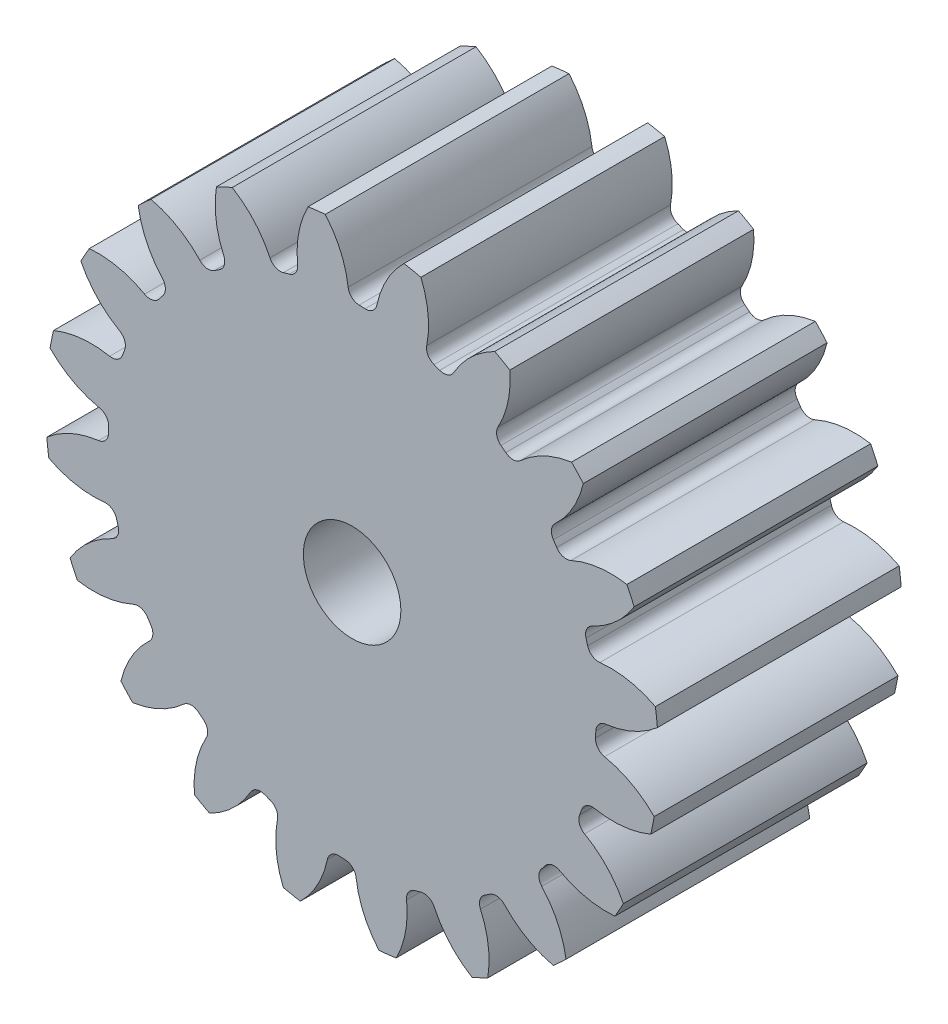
ISO-10303-21;
HEADER;
FILE_DESCRIPTION(('STEP AP214'),'2;1');
FILE_NAME('part.step','',(''),(''),'','','');
FILE_SCHEMA(('AUTOMOTIVE_DESIGN { 1 0 10303 214 1 1 1 1 }'));
ENDSEC;
DATA;
#1=APPLICATION_CONTEXT('core data for automotive mechanical design processes');
#2=APPLICATION_PROTOCOL_DEFINITION('international standard','automotive_design',2000,#1);
#3=PRODUCT_CONTEXT('',#1,'mechanical');
#4=PRODUCT('Part','Part','',(#3));
#5=PRODUCT_RELATED_PRODUCT_CATEGORY('part','',(#4));
#6=PRODUCT_DEFINITION_FORMATION('','',#4);
#7=PRODUCT_DEFINITION_CONTEXT('part definition',#1,'design');
#8=PRODUCT_DEFINITION('design','',#6,#7);
#9=PRODUCT_DEFINITION_SHAPE('','',#8);
#10=(LENGTH_UNIT() NAMED_UNIT(*) SI_UNIT(.MILLI.,.METRE.));
#11=(NAMED_UNIT(*) PLANE_ANGLE_UNIT() SI_UNIT($,.RADIAN.));
#12=(NAMED_UNIT(*) SI_UNIT($,.STERADIAN.) SOLID_ANGLE_UNIT());
#13=UNCERTAINTY_MEASURE_WITH_UNIT(LENGTH_MEASURE(1.E-05),#10,'distance_accuracy_value','');
#14=(GEOMETRIC_REPRESENTATION_CONTEXT(3) GLOBAL_UNCERTAINTY_ASSIGNED_CONTEXT((#13)) GLOBAL_UNIT_ASSIGNED_CONTEXT((#10,
#11,#12)) REPRESENTATION_CONTEXT('',''));
#15=CARTESIAN_POINT('',(0.,0.,0.));
#16=DIRECTION('',(0.,0.,1.));
#17=DIRECTION('',(1.,0.,0.));
#18=AXIS2_PLACEMENT_3D('',#15,#16,#17);
#19=CARTESIAN_POINT('',(0.,0.,88.9));
#20=DIRECTION('',(0.,0.,-1.));
#21=DIRECTION('',(-1.,0.,0.));
#22=AXIS2_PLACEMENT_3D('',#19,#20,#21);
#23=CYLINDRICAL_SURFACE('',#22,111.76);
#24=DIRECTION('',(0.,0.,-1.));
#25=VECTOR('',#24,1.);
#26=CARTESIAN_POINT('',(110.598793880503,16.0687395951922,44.45));
#27=LINE('',#26,#25);
#28=CARTESIAN_POINT('',(110.598793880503,16.0687395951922,88.9));
#29=VERTEX_POINT('',#28);
#30=CARTESIAN_POINT('',(110.598793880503,16.0687395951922,0.));
#31=VERTEX_POINT('',#30);
#32=EDGE_CURVE('E815',#29,#31,#27,.T.);
#33=ORIENTED_EDGE('',*,*,#32,.F.);
#34=CARTESIAN_POINT('',(0.,0.,88.9));
#35=DIRECTION('',(0.,0.,1.));
#36=DIRECTION('',(1.,0.,0.));
#37=AXIS2_PLACEMENT_3D('',#34,#35,#36);
#38=CIRCLE('',#37,111.76);
#39=CARTESIAN_POINT('',(111.330164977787,9.7924443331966,88.9));
#40=VERTEX_POINT('',#39);
#41=EDGE_CURVE('E1536',#40,#29,#38,.T.);
#42=ORIENTED_EDGE('',*,*,#41,.F.);
#43=DIRECTION('',(0.,0.,-1.));
#44=VECTOR('',#43,1.);
#45=CARTESIAN_POINT('',(111.330164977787,9.7924443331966,44.45));
#46=LINE('',#45,#44);
#47=CARTESIAN_POINT('',(111.330164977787,9.7924443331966,0.));
#48=VERTEX_POINT('',#47);
#49=EDGE_CURVE('E1530',#48,#40,#46,.F.);
#50=ORIENTED_EDGE('',*,*,#49,.F.);
#51=CARTESIAN_POINT('',(0.,0.,0.));
#52=DIRECTION('',(0.,0.,1.));
#53=DIRECTION('',(1.,0.,0.));
#54=AXIS2_PLACEMENT_3D('',#51,#52,#53);
#55=CIRCLE('',#54,111.76);
#56=EDGE_CURVE('E1541',#48,#31,#55,.T.);
#57=ORIENTED_EDGE('',*,*,#56,.T.);
#58=EDGE_LOOP('',(#33,#42,#50,#57));
#59=FACE_BOUND('',#58,.T.);
#60=ADVANCED_FACE('F32',(#59),#23,.T.);
#61=DIRECTION('',(0.,0.,-1.));
#62=VECTOR('',#61,1.);
#63=CARTESIAN_POINT('',(102.855247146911,43.7160809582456,44.45));
#64=LINE('',#63,#62);
#65=CARTESIAN_POINT('',(102.855247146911,43.7160809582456,0.));
#66=VERTEX_POINT('',#65);
#67=CARTESIAN_POINT('',(102.855247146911,43.7160809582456,88.9));
#68=VERTEX_POINT('',#67);
#69=EDGE_CURVE('E786',#66,#68,#64,.F.);
#70=ORIENTED_EDGE('',*,*,#69,.F.);
#71=CARTESIAN_POINT('',(100.220190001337,49.4591863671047,0.));
#72=VERTEX_POINT('',#71);
#73=EDGE_CURVE('E1544',#66,#72,#55,.T.);
#74=ORIENTED_EDGE('',*,*,#73,.T.);
#75=DIRECTION('',(0.,0.,-1.));
#76=VECTOR('',#75,1.);
#77=CARTESIAN_POINT('',(100.220190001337,49.4591863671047,44.45));
#78=LINE('',#77,#76);
#79=CARTESIAN_POINT('',(100.220190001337,49.4591863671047,88.9));
#80=VERTEX_POINT('',#79);
#81=EDGE_CURVE('E848',#80,#72,#78,.T.);
#82=ORIENTED_EDGE('',*,*,#81,.F.);
#83=EDGE_CURVE('E1539',#68,#80,#38,.T.);
#84=ORIENTED_EDGE('',*,*,#83,.F.);
#85=EDGE_LOOP('',(#70,#74,#82,#84));
#86=FACE_BOUND('',#85,.T.);
#87=ADVANCED_FACE('F1770',(#86),#23,.T.);
#88=CARTESIAN_POINT('',(0.,0.,88.9));
#89=DIRECTION('',(0.,0.,1.));
#90=DIRECTION('',(1.,0.,0.));
#91=AXIS2_PLACEMENT_3D('',#88,#89,#90);
#92=PLANE('',#91);
#93=CARTESIAN_POINT('',(0.,0.,88.9000000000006));
#94=DIRECTION('',(0.,0.,1.));
#95=DIRECTION('',(1.,0.,0.));
#96=AXIS2_PLACEMENT_3D('',#93,#94,#95);
#97=CIRCLE('',#96,17.78);
#98=CARTESIAN_POINT('',(17.78,0.,88.9000000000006));
#99=VERTEX_POINT('',#98);
#100=EDGE_CURVE('E803',#99,#99,#97,.T.);
#101=ORIENTED_EDGE('',*,*,#100,.F.);
#102=EDGE_LOOP('',(#101));
#103=FACE_BOUND('',#102,.T.);
#104=ORIENTED_EDGE('',*,*,#41,.T.);
#105=CARTESIAN_POINT('',(94.2428479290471,-15.2753225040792,88.9));
#106=DIRECTION('',(0.,0.,-1.));
#107=DIRECTION('',(0.951056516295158,0.309016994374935,0.));
#108=AXIS2_PLACEMENT_3D('',#105,#106,#107);
#109=CIRCLE('',#108,35.3548751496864);
#110=CARTESIAN_POINT('',(90.3485420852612,19.864421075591,88.9));
#111=VERTEX_POINT('',#110);
#112=EDGE_CURVE('E795',#111,#29,#109,.T.);
#113=ORIENTED_EDGE('',*,*,#112,.F.);
#114=CARTESIAN_POINT('',(89.8930625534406,23.9743792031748,88.9));
#115=DIRECTION('',(0.,0.,1.));
#116=DIRECTION('',(-0.951056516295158,-0.309016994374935,0.));
#117=AXIS2_PLACEMENT_3D('',#114,#115,#116);
#118=CIRCLE('',#117,4.13512000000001);
#119=CARTESIAN_POINT('',(85.8975971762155,22.9087930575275,88.9));
#120=VERTEX_POINT('',#119);
#121=EDGE_CURVE('E793',#120,#111,#118,.T.);
#122=ORIENTED_EDGE('',*,*,#121,.F.);
#123=CARTESIAN_POINT('',(0.,0.,88.9));
#124=DIRECTION('',(0.,0.,-1.));
#125=DIRECTION('',(0.951056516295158,0.309016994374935,0.));
#126=AXIS2_PLACEMENT_3D('',#123,#124,#125);
#127=CIRCLE('',#126,88.9);
#128=CARTESIAN_POINT('',(85.3004456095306,25.0408462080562,88.9));
#129=VERTEX_POINT('',#128);
#130=EDGE_CURVE('E778',#129,#120,#127,.T.);
#131=ORIENTED_EDGE('',*,*,#130,.F.);
#132=CARTESIAN_POINT('',(89.2681349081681,26.2056032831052,88.9));
#133=DIRECTION('',(0.,0.,1.));
#134=DIRECTION('',(-0.951056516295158,-0.309016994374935,0.));
#135=AXIS2_PLACEMENT_3D('',#132,#133,#134);
#136=CIRCLE('',#135,4.13512);
#137=CARTESIAN_POINT('',(87.5225600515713,29.9542278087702,88.9));
#138=VERTEX_POINT('',#137);
#139=EDGE_CURVE('E770',#138,#129,#136,.T.);
#140=ORIENTED_EDGE('',*,*,#139,.F.);
#141=CARTESIAN_POINT('',(72.598064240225,62.004604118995,88.9));
#142=DIRECTION('',(0.,0.,-1.));
#143=DIRECTION('',(-0.951056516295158,-0.309016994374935,0.));
#144=AXIS2_PLACEMENT_3D('',#141,#142,#143);
#145=CIRCLE('',#144,35.3548751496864);
#146=EDGE_CURVE('E800',#68,#138,#145,.T.);
#147=ORIENTED_EDGE('',*,*,#146,.F.);
#148=ORIENTED_EDGE('',*,*,#83,.T.);
#149=CARTESIAN_POINT('',(94.350608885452,14.5949466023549,88.9));
#150=DIRECTION('',(0.,0.,-1.));
#151=DIRECTION('',(0.809016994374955,0.587785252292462,0.));
#152=AXIS2_PLACEMENT_3D('',#149,#150,#151);
#153=CIRCLE('',#152,35.3548751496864);
#154=CARTESIAN_POINT('',(79.7881259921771,46.8114220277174,88.9));
#155=VERTEX_POINT('',#154);
#156=EDGE_CURVE('E824',#155,#80,#153,.T.);
#157=ORIENTED_EDGE('',*,*,#156,.F.);
#158=CARTESIAN_POINT('',(78.0848923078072,50.5794735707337,88.9));
#159=DIRECTION('',(0.,0.,1.));
#160=DIRECTION('',(-0.809016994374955,-0.587785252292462,0.));
#161=AXIS2_PLACEMENT_3D('',#158,#159,#160);
#162=CIRCLE('',#161,4.13512000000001);
#163=CARTESIAN_POINT('',(74.6142631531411,48.3313742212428,88.9));
#164=VERTEX_POINT('',#163);
#165=EDGE_CURVE('E822',#164,#155,#162,.T.);
#166=ORIENTED_EDGE('',*,*,#165,.F.);
#167=CARTESIAN_POINT('',(0.,0.,88.9));
#168=DIRECTION('',(0.,0.,-1.));
#169=DIRECTION('',(0.809016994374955,0.587785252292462,0.));
#170=AXIS2_PLACEMENT_3D('',#167,#168,#169);
#171=CIRCLE('',#170,88.9);
#172=CARTESIAN_POINT('',(73.3874976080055,50.1745472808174,88.9));
#173=VERTEX_POINT('',#172);
#174=EDGE_CURVE('E819',#173,#164,#171,.T.);
#175=ORIENTED_EDGE('',*,*,#174,.F.);
#176=CARTESIAN_POINT('',(76.8010646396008,52.5083805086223,88.9));
#177=DIRECTION('',(0.,0.,1.));
#178=DIRECTION('',(-0.809016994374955,-0.587785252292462,0.));
#179=AXIS2_PLACEMENT_3D('',#176,#177,#178);
#180=CIRCLE('',#179,4.13512);
#181=CARTESIAN_POINT('',(73.9825356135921,55.5341219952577,88.9));
#182=VERTEX_POINT('',#181);
#183=EDGE_CURVE('E817',#182,#173,#180,.T.);
#184=ORIENTED_EDGE('',*,*,#183,.F.);
#185=CARTESIAN_POINT('',(49.8843856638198,81.4039183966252,88.9));
#186=DIRECTION('',(0.,0.,-1.));
#187=DIRECTION('',(-0.809016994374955,-0.587785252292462,0.));
#188=AXIS2_PLACEMENT_3D('',#185,#186,#187);
#189=CIRCLE('',#188,35.3548751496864);
#190=CARTESIAN_POINT('',(84.3121410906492,73.3604829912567,88.9));
#191=VERTEX_POINT('',#190);
#192=EDGE_CURVE('E827',#191,#182,#189,.T.);
#193=ORIENTED_EDGE('',*,*,#192,.F.);
#194=CARTESIAN_POINT('',(80.0313356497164,78.0082233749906,88.9));
#195=VERTEX_POINT('',#194);
#196=EDGE_CURVE('E1592',#191,#195,#38,.T.);
#197=ORIENTED_EDGE('',*,*,#196,.T.);
#198=CARTESIAN_POINT('',(85.2226748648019,43.0365606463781,88.9));
#199=DIRECTION('',(0.,0.,-1.));
#200=DIRECTION('',(0.587785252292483,0.80901699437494,0.));
#201=AXIS2_PLACEMENT_3D('',#198,#199,#200);
#202=CIRCLE('',#201,35.3548751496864);
#203=CARTESIAN_POINT('',(61.4174922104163,69.1761948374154,88.9));
#204=VERTEX_POINT('',#203);
#205=EDGE_CURVE('E859',#204,#195,#202,.T.);
#206=ORIENTED_EDGE('',*,*,#205,.F.);
#207=CARTESIAN_POINT('',(58.6332287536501,72.2334966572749,88.9));
#208=DIRECTION('',(0.,0.,1.));
#209=DIRECTION('',(-0.587785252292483,-0.80901699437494,0.));
#210=AXIS2_PLACEMENT_3D('',#207,#208,#209);
#211=CIRCLE('',#210,4.13512000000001);
#212=CARTESIAN_POINT('',(56.0271651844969,69.0229437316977,88.9));
#213=VERTEX_POINT('',#212);
#214=EDGE_CURVE('E857',#213,#204,#211,.T.);
#215=ORIENTED_EDGE('',*,*,#214,.F.);
#216=CARTESIAN_POINT('',(0.,0.,88.9));
#217=DIRECTION('',(0.,0.,-1.));
#218=DIRECTION('',(0.587785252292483,0.80901699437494,0.));
#219=AXIS2_PLACEMENT_3D('',#216,#217,#218);
#220=CIRCLE('',#219,88.9);
#221=CARTESIAN_POINT('',(54.2908700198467,70.3968140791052,88.9));
#222=VERTEX_POINT('',#221);
#223=EDGE_CURVE('E854',#222,#213,#220,.T.);
#224=ORIENTED_EDGE('',*,*,#223,.F.);
#225=CARTESIAN_POINT('',(56.816171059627,73.6712716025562,88.9));
#226=DIRECTION('',(0.,0.,1.));
#227=DIRECTION('',(-0.587785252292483,-0.80901699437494,0.));
#228=AXIS2_PLACEMENT_3D('',#225,#226,#227);
#229=CIRCLE('',#228,4.13512);
#230=CARTESIAN_POINT('',(53.2005851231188,75.6779493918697,88.9));
#231=VERTEX_POINT('',#230);
#232=EDGE_CURVE('E852',#231,#222,#229,.T.);
#233=ORIENTED_EDGE('',*,*,#232,.F.);
#234=CARTESIAN_POINT('',(22.2876758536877,92.8348499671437,88.9));
#235=DIRECTION('',(0.,0.,-1.));
#236=DIRECTION('',(-0.587785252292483,-0.80901699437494,0.));
#237=AXIS2_PLACEMENT_3D('',#234,#235,#236);
#238=CIRCLE('',#237,35.3548751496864);
#239=CARTESIAN_POINT('',(57.5159752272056,95.8238498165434,88.9));
#240=VERTEX_POINT('',#239);
#241=EDGE_CURVE('E862',#240,#231,#238,.T.);
#242=ORIENTED_EDGE('',*,*,#241,.F.);
#243=CARTESIAN_POINT('',(52.0084565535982,98.9212719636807,88.9));
#244=VERTEX_POINT('',#243);
#245=EDGE_CURVE('E1752',#240,#244,#38,.T.);
#246=ORIENTED_EDGE('',*,*,#245,.T.);
#247=CARTESIAN_POINT('',(67.7525516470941,67.265456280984,88.9));
#248=DIRECTION('',(0.,0.,-1.));
#249=DIRECTION('',(0.309016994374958,0.95105651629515,0.));
#250=AXIS2_PLACEMENT_3D('',#247,#248,#249);
#251=CIRCLE('',#250,35.3548751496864);
#252=CARTESIAN_POINT('',(37.0348863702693,84.7695197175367,88.9));
#253=VERTEX_POINT('',#252);
#254=EDGE_CURVE('E897',#253,#244,#251,.T.);
#255=ORIENTED_EDGE('',*,*,#254,.F.);
#256=CARTESIAN_POINT('',(33.4421362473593,86.8168018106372,88.9));
#257=DIRECTION('',(0.,0.,1.));
#258=DIRECTION('',(-0.309016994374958,-0.95105651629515,0.));
#259=AXIS2_PLACEMENT_3D('',#256,#257,#258);
#260=CIRCLE('',#259,4.13512000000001);
#261=CARTESIAN_POINT('',(31.9557379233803,82.9580665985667,88.9));
#262=VERTEX_POINT('',#261);
#263=EDGE_CURVE('E895',#262,#253,#260,.T.);
#264=ORIENTED_EDGE('',*,*,#263,.F.);
#265=CARTESIAN_POINT('',(0.,0.,88.9));
#266=DIRECTION('',(0.,0.,-1.));
#267=DIRECTION('',(0.309016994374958,0.95105651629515,0.));
#268=AXIS2_PLACEMENT_3D('',#265,#266,#267);
#269=CIRCLE('',#268,88.9);
#270=CARTESIAN_POINT('',(29.8798738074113,83.7281502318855,88.9));
#271=VERTEX_POINT('',#270);
#272=EDGE_CURVE('E892',#271,#262,#269,.T.);
#273=ORIENTED_EDGE('',*,*,#272,.F.);
#274=CARTESIAN_POINT('',(31.269714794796,87.6227053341,88.9));
#275=DIRECTION('',(0.,0.,1.));
#276=DIRECTION('',(-0.309016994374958,-0.95105651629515,0.));
#277=AXIS2_PLACEMENT_3D('',#274,#275,#276);
#278=CIRCLE('',#277,4.13512);
#279=CARTESIAN_POINT('',(27.2109906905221,88.4138918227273,88.9));
#280=VERTEX_POINT('',#279);
#281=EDGE_CURVE('E890',#280,#271,#278,.T.);
#282=ORIENTED_EDGE('',*,*,#281,.F.);
#283=CARTESIAN_POINT('',(-7.49070695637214,95.1784596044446,88.9));
#284=DIRECTION('',(0.,0.,-1.));
#285=DIRECTION('',(-0.309016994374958,-0.95105651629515,0.));
#286=AXIS2_PLACEMENT_3D('',#283,#284,#285);
#287=CIRCLE('',#286,35.3548751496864);
#288=CARTESIAN_POINT('',(25.0897449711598,108.907310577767,88.9));
#289=VERTEX_POINT('',#288);
#290=EDGE_CURVE('E900',#289,#280,#287,.T.);
#291=ORIENTED_EDGE('',*,*,#290,.F.);
#292=CARTESIAN_POINT('',(18.8946273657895,110.151217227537,88.9));
#293=VERTEX_POINT('',#292);
#294=EDGE_CURVE('E1748',#289,#293,#38,.T.);
#295=ORIENTED_EDGE('',*,*,#294,.T.);
#296=CARTESIAN_POINT('',(43.6503366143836,84.9099403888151,88.9));
#297=DIRECTION('',(0.,0.,-1.));
#298=DIRECTION('',(0.,1.,0.));
#299=AXIS2_PLACEMENT_3D('',#296,#297,#298);
#300=CIRCLE('',#299,35.3548751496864);
#301=CARTESIAN_POINT('',(9.02704781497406,92.0650133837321,88.9));
#302=VERTEX_POINT('',#301);
#303=EDGE_CURVE('E935',#302,#293,#300,.T.);
#304=ORIENTED_EDGE('',*,*,#303,.F.);
#305=CARTESIAN_POINT('',(4.9774944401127,92.9018735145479,88.9));
#306=DIRECTION('',(0.,0.,1.));
#307=DIRECTION('',(0.,-1.,0.));
#308=AXIS2_PLACEMENT_3D('',#305,#306,#307);
#309=CIRCLE('',#308,4.13512000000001);
#310=CARTESIAN_POINT('',(4.75626038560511,88.7726759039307,88.9));
#311=VERTEX_POINT('',#310);
#312=EDGE_CURVE('E933',#311,#302,#309,.T.);
#313=ORIENTED_EDGE('',*,*,#312,.F.);
#314=CARTESIAN_POINT('',(0.,0.,88.9));
#315=DIRECTION('',(0.,0.,-1.));
#316=DIRECTION('',(0.,1.,0.));
#317=AXIS2_PLACEMENT_3D('',#314,#315,#316);
#318=CIRCLE('',#317,88.9);
#319=CARTESIAN_POINT('',(2.54402736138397,88.8635916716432,88.9));
#320=VERTEX_POINT('',#319);
#321=EDGE_CURVE('E930',#320,#311,#318,.T.);
#322=ORIENTED_EDGE('',*,*,#321,.F.);
#323=CARTESIAN_POINT('',(2.66236097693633,92.9970181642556,88.9));
#324=DIRECTION('',(0.,0.,1.));
#325=DIRECTION('',(0.,-1.,0.));
#326=AXIS2_PLACEMENT_3D('',#323,#324,#325);
#327=CIRCLE('',#326,4.13512);
#328=CARTESIAN_POINT('',(-1.44220510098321,92.4952665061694,88.9));
#329=VERTEX_POINT('',#328);
#330=EDGE_CURVE('E928',#329,#320,#327,.T.);
#331=ORIENTED_EDGE('',*,*,#330,.F.);
#332=CARTESIAN_POINT('',(-36.535847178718,88.2053384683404,88.9));
#333=DIRECTION('',(0.,0.,-1.));
#334=DIRECTION('',(0.,-1.,0.));
#335=AXIS2_PLACEMENT_3D('',#332,#333,#334);
#336=CIRCLE('',#335,35.3548751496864);
#337=CARTESIAN_POINT('',(-9.79244433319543,111.330164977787,88.9));
#338=VERTEX_POINT('',#337);
#339=EDGE_CURVE('E938',#338,#329,#336,.T.);
#340=ORIENTED_EDGE('',*,*,#339,.F.);
#341=CARTESIAN_POINT('',(-16.0687395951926,110.598793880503,88.9));
#342=VERTEX_POINT('',#341);
#343=EDGE_CURVE('E1744',#338,#342,#38,.T.);
#344=ORIENTED_EDGE('',*,*,#343,.T.);
#345=CARTESIAN_POINT('',(15.2753225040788,94.2428479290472,88.9));
#346=DIRECTION('',(0.,0.,-1.));
#347=DIRECTION('',(-0.309016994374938,0.951056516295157,0.));
#348=AXIS2_PLACEMENT_3D('',#345,#346,#347);
#349=CIRCLE('',#348,35.3548751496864);
#350=CARTESIAN_POINT('',(-19.8644210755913,90.3485420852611,88.9));
#351=VERTEX_POINT('',#350);
#352=EDGE_CURVE('E973',#351,#342,#349,.T.);
#353=ORIENTED_EDGE('',*,*,#352,.F.);
#354=CARTESIAN_POINT('',(-23.9743792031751,89.8930625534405,88.9));
#355=DIRECTION('',(0.,0.,1.));
#356=DIRECTION('',(0.309016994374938,-0.951056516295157,0.));
#357=AXIS2_PLACEMENT_3D('',#354,#355,#356);
#358=CIRCLE('',#357,4.13512000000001);
#359=CARTESIAN_POINT('',(-22.9087930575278,85.8975971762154,88.9));
#360=VERTEX_POINT('',#359);
#361=EDGE_CURVE('E971',#360,#351,#358,.T.);
#362=ORIENTED_EDGE('',*,*,#361,.F.);
#363=CARTESIAN_POINT('',(0.,0.,88.9));
#364=DIRECTION('',(0.,0.,-1.));
#365=DIRECTION('',(-0.309016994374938,0.951056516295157,0.));
#366=AXIS2_PLACEMENT_3D('',#363,#364,#365);
#367=CIRCLE('',#366,88.9);
#368=CARTESIAN_POINT('',(-25.0408462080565,85.3004456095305,88.9));
#369=VERTEX_POINT('',#368);
#370=EDGE_CURVE('E968',#369,#360,#367,.T.);
#371=ORIENTED_EDGE('',*,*,#370,.F.);
#372=CARTESIAN_POINT('',(-26.2056032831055,89.2681349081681,88.9));
#373=DIRECTION('',(0.,0.,1.));
#374=DIRECTION('',(0.309016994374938,-0.951056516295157,0.));
#375=AXIS2_PLACEMENT_3D('',#372,#373,#374);
#376=CIRCLE('',#375,4.13512);
#377=CARTESIAN_POINT('',(-29.9542278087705,87.5225600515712,88.9));
#378=VERTEX_POINT('',#377);
#379=EDGE_CURVE('E966',#378,#369,#376,.T.);
#380=ORIENTED_EDGE('',*,*,#379,.F.);
#381=CARTESIAN_POINT('',(-62.0046041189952,72.5980642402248,88.9));
#382=DIRECTION('',(0.,0.,-1.));
#383=DIRECTION('',(0.309016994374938,-0.951056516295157,0.));
#384=AXIS2_PLACEMENT_3D('',#381,#382,#383);
#385=CIRCLE('',#384,35.3548751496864);
#386=CARTESIAN_POINT('',(-43.7160809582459,102.855247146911,88.9));
#387=VERTEX_POINT('',#386);
#388=EDGE_CURVE('E976',#387,#378,#385,.T.);
#389=ORIENTED_EDGE('',*,*,#388,.F.);
#390=CARTESIAN_POINT('',(-49.4591863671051,100.220190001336,88.9));
#391=VERTEX_POINT('',#390);
#392=EDGE_CURVE('E1740',#387,#391,#38,.T.);
#393=ORIENTED_EDGE('',*,*,#392,.T.);
#394=CARTESIAN_POINT('',(-14.5949466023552,94.350608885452,88.9));
#395=DIRECTION('',(0.,0.,-1.));
#396=DIRECTION('',(-0.587785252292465,0.809016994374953,0.));
#397=AXIS2_PLACEMENT_3D('',#394,#395,#396);
#398=CIRCLE('',#397,35.3548751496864);
#399=CARTESIAN_POINT('',(-46.8114220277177,79.788125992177,88.9));
#400=VERTEX_POINT('',#399);
#401=EDGE_CURVE('E1011',#400,#391,#398,.T.);
#402=ORIENTED_EDGE('',*,*,#401,.F.);
#403=CARTESIAN_POINT('',(-50.579473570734,78.084892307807,88.9));
#404=DIRECTION('',(0.,0.,1.));
#405=DIRECTION('',(0.587785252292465,-0.809016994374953,0.));
#406=AXIS2_PLACEMENT_3D('',#403,#404,#405);
#407=CIRCLE('',#406,4.13512000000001);
#408=CARTESIAN_POINT('',(-48.3313742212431,74.6142631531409,88.9));
#409=VERTEX_POINT('',#408);
#410=EDGE_CURVE('E1009',#409,#400,#407,.T.);
#411=ORIENTED_EDGE('',*,*,#410,.F.);
#412=CARTESIAN_POINT('',(0.,0.,88.9));
#413=DIRECTION('',(0.,0.,-1.));
#414=DIRECTION('',(-0.587785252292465,0.809016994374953,0.));
#415=AXIS2_PLACEMENT_3D('',#412,#413,#414);
#416=CIRCLE('',#415,88.9);
#417=CARTESIAN_POINT('',(-50.1745472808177,73.3874976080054,88.9));
#418=VERTEX_POINT('',#417);
#419=EDGE_CURVE('E1006',#418,#409,#416,.T.);
#420=ORIENTED_EDGE('',*,*,#419,.F.);
#421=CARTESIAN_POINT('',(-52.5083805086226,76.8010646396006,88.9));
#422=DIRECTION('',(0.,0.,1.));
#423=DIRECTION('',(0.587785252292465,-0.809016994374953,0.));
#424=AXIS2_PLACEMENT_3D('',#421,#422,#423);
#425=CIRCLE('',#424,4.13512);
#426=CARTESIAN_POINT('',(-55.534121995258,73.9825356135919,88.9));
#427=VERTEX_POINT('',#426);
#428=EDGE_CURVE('E1004',#427,#418,#425,.T.);
#429=ORIENTED_EDGE('',*,*,#428,.F.);
#430=CARTESIAN_POINT('',(-81.4039183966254,49.8843856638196,88.9));
#431=DIRECTION('',(0.,0.,-1.));
#432=DIRECTION('',(0.587785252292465,-0.809016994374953,0.));
#433=AXIS2_PLACEMENT_3D('',#430,#431,#432);
#434=CIRCLE('',#433,35.3548751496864);
#435=CARTESIAN_POINT('',(-73.360482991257,84.3121410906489,88.9));
#436=VERTEX_POINT('',#435);
#437=EDGE_CURVE('E1014',#436,#427,#434,.T.);
#438=ORIENTED_EDGE('',*,*,#437,.F.);
#439=CARTESIAN_POINT('',(-78.0082233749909,80.0313356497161,88.9));
#440=VERTEX_POINT('',#439);
#441=EDGE_CURVE('E1736',#436,#440,#38,.T.);
#442=ORIENTED_EDGE('',*,*,#441,.T.);
#443=CARTESIAN_POINT('',(-43.0365606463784,85.2226748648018,88.9));
#444=DIRECTION('',(0.,0.,-1.));
#445=DIRECTION('',(-0.809016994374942,0.58778525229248,0.));
#446=AXIS2_PLACEMENT_3D('',#443,#444,#445);
#447=CIRCLE('',#446,35.3548751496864);
#448=CARTESIAN_POINT('',(-69.1761948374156,61.417492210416,88.9));
#449=VERTEX_POINT('',#448);
#450=EDGE_CURVE('E1049',#449,#440,#447,.T.);
#451=ORIENTED_EDGE('',*,*,#450,.F.);
#452=CARTESIAN_POINT('',(-72.2334966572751,58.6332287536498,88.9));
#453=DIRECTION('',(0.,0.,1.));
#454=DIRECTION('',(0.809016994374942,-0.58778525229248,0.));
#455=AXIS2_PLACEMENT_3D('',#452,#453,#454);
#456=CIRCLE('',#455,4.13512000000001);
#457=CARTESIAN_POINT('',(-69.0229437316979,56.0271651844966,88.9));
#458=VERTEX_POINT('',#457);
#459=EDGE_CURVE('E1047',#458,#449,#456,.T.);
#460=ORIENTED_EDGE('',*,*,#459,.F.);
#461=CARTESIAN_POINT('',(0.,0.,88.9));
#462=DIRECTION('',(0.,0.,-1.));
#463=DIRECTION('',(-0.809016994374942,0.58778525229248,0.));
#464=AXIS2_PLACEMENT_3D('',#461,#462,#463);
#465=CIRCLE('',#464,88.9);
#466=CARTESIAN_POINT('',(-70.3968140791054,54.2908700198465,88.9));
#467=VERTEX_POINT('',#466);
#468=EDGE_CURVE('E1044',#467,#458,#465,.T.);
#469=ORIENTED_EDGE('',*,*,#468,.F.);
#470=CARTESIAN_POINT('',(-73.6712716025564,56.8161710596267,88.9));
#471=DIRECTION('',(0.,0.,1.));
#472=DIRECTION('',(0.809016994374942,-0.58778525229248,0.));
#473=AXIS2_PLACEMENT_3D('',#470,#471,#472);
#474=CIRCLE('',#473,4.13512);
#475=CARTESIAN_POINT('',(-75.6779493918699,53.2005851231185,88.9));
#476=VERTEX_POINT('',#475);
#477=EDGE_CURVE('E1042',#476,#467,#474,.T.);
#478=ORIENTED_EDGE('',*,*,#477,.F.);
#479=CARTESIAN_POINT('',(-92.8348499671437,22.2876758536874,88.9));
#480=DIRECTION('',(0.,0.,-1.));
#481=DIRECTION('',(0.809016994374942,-0.58778525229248,0.));
#482=AXIS2_PLACEMENT_3D('',#479,#480,#481);
#483=CIRCLE('',#482,35.3548751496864);
#484=CARTESIAN_POINT('',(-95.8238498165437,57.5159752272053,88.9));
#485=VERTEX_POINT('',#484);
#486=EDGE_CURVE('E1052',#485,#476,#483,.T.);
#487=ORIENTED_EDGE('',*,*,#486,.F.);
#488=CARTESIAN_POINT('',(-98.9212719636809,52.0084565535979,88.9));
#489=VERTEX_POINT('',#488);
#490=EDGE_CURVE('E1732',#485,#489,#38,.T.);
#491=ORIENTED_EDGE('',*,*,#490,.T.);
#492=CARTESIAN_POINT('',(-67.2654562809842,67.7525516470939,88.9));
#493=DIRECTION('',(0.,0.,-1.));
#494=DIRECTION('',(-0.951056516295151,0.309016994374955,0.));
#495=AXIS2_PLACEMENT_3D('',#492,#493,#494);
#496=CIRCLE('',#495,35.3548751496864);
#497=CARTESIAN_POINT('',(-84.7695197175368,37.034886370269,88.9));
#498=VERTEX_POINT('',#497);
#499=EDGE_CURVE('E1087',#498,#489,#496,.T.);
#500=ORIENTED_EDGE('',*,*,#499,.F.);
#501=CARTESIAN_POINT('',(-86.8168018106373,33.442136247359,88.9));
#502=DIRECTION('',(0.,0.,1.));
#503=DIRECTION('',(0.951056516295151,-0.309016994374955,0.));
#504=AXIS2_PLACEMENT_3D('',#501,#502,#503);
#505=CIRCLE('',#504,4.13512000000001);
#506=CARTESIAN_POINT('',(-82.9580665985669,31.95573792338,88.9));
#507=VERTEX_POINT('',#506);
#508=EDGE_CURVE('E1085',#507,#498,#505,.T.);
#509=ORIENTED_EDGE('',*,*,#508,.F.);
#510=CARTESIAN_POINT('',(0.,0.,88.9));
#511=DIRECTION('',(0.,0.,-1.));
#512=DIRECTION('',(-0.951056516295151,0.309016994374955,0.));
#513=AXIS2_PLACEMENT_3D('',#510,#511,#512);
#514=CIRCLE('',#513,88.9);
#515=CARTESIAN_POINT('',(-83.7281502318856,29.879873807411,88.9));
#516=VERTEX_POINT('',#515);
#517=EDGE_CURVE('E1082',#516,#507,#514,.T.);
#518=ORIENTED_EDGE('',*,*,#517,.F.);
#519=CARTESIAN_POINT('',(-87.6227053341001,31.2697147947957,88.9));
#520=DIRECTION('',(0.,0.,1.));
#521=DIRECTION('',(0.951056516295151,-0.309016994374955,0.));
#522=AXIS2_PLACEMENT_3D('',#519,#520,#521);
#523=CIRCLE('',#522,4.13512);
#524=CARTESIAN_POINT('',(-88.4138918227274,27.2109906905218,88.9));
#525=VERTEX_POINT('',#524);
#526=EDGE_CURVE('E1080',#525,#516,#523,.T.);
#527=ORIENTED_EDGE('',*,*,#526,.F.);
#528=CARTESIAN_POINT('',(-95.1784596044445,-7.49070695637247,88.9));
#529=DIRECTION('',(0.,0.,-1.));
#530=DIRECTION('',(0.951056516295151,-0.309016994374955,0.));
#531=AXIS2_PLACEMENT_3D('',#528,#529,#530);
#532=CIRCLE('',#531,35.3548751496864);
#533=CARTESIAN_POINT('',(-108.907310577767,25.0897449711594,88.9));
#534=VERTEX_POINT('',#533);
#535=EDGE_CURVE('E1090',#534,#525,#532,.T.);
#536=ORIENTED_EDGE('',*,*,#535,.F.);
#537=CARTESIAN_POINT('',(-110.151217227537,18.8946273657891,88.9));
#538=VERTEX_POINT('',#537);
#539=EDGE_CURVE('E1728',#534,#538,#38,.T.);
#540=ORIENTED_EDGE('',*,*,#539,.T.);
#541=CARTESIAN_POINT('',(-84.9099403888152,43.6503366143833,88.9));
#542=DIRECTION('',(0.,0.,-1.));
#543=DIRECTION('',(-1.,0.,0.));
#544=AXIS2_PLACEMENT_3D('',#541,#542,#543);
#545=CIRCLE('',#544,35.3548751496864);
#546=CARTESIAN_POINT('',(-92.0650133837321,9.02704781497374,88.9));
#547=VERTEX_POINT('',#546);
#548=EDGE_CURVE('E1125',#547,#538,#545,.T.);
#549=ORIENTED_EDGE('',*,*,#548,.F.);
#550=CARTESIAN_POINT('',(-92.9018735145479,4.97749444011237,88.9));
#551=DIRECTION('',(0.,0.,1.));
#552=DIRECTION('',(1.,0.,0.));
#553=AXIS2_PLACEMENT_3D('',#550,#551,#552);
#554=CIRCLE('',#553,4.13512000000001);
#555=CARTESIAN_POINT('',(-88.7726759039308,4.7562603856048,88.9));
#556=VERTEX_POINT('',#555);
#557=EDGE_CURVE('E1123',#556,#547,#554,.T.);
#558=ORIENTED_EDGE('',*,*,#557,.F.);
#559=CARTESIAN_POINT('',(0.,0.,88.9));
#560=DIRECTION('',(0.,0.,-1.));
#561=DIRECTION('',(-1.,0.,0.));
#562=AXIS2_PLACEMENT_3D('',#559,#560,#561);
#563=CIRCLE('',#562,88.9);
#564=CARTESIAN_POINT('',(-88.8635916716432,2.54402736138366,88.9));
#565=VERTEX_POINT('',#564);
#566=EDGE_CURVE('E1120',#565,#556,#563,.T.);
#567=ORIENTED_EDGE('',*,*,#566,.F.);
#568=CARTESIAN_POINT('',(-92.9970181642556,2.662360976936,88.9));
#569=DIRECTION('',(0.,0.,1.));
#570=DIRECTION('',(1.,0.,0.));
#571=AXIS2_PLACEMENT_3D('',#568,#569,#570);
#572=CIRCLE('',#571,4.13512);
#573=CARTESIAN_POINT('',(-92.4952665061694,-1.44220510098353,88.9));
#574=VERTEX_POINT('',#573);
#575=EDGE_CURVE('E1118',#574,#565,#572,.T.);
#576=ORIENTED_EDGE('',*,*,#575,.F.);
#577=CARTESIAN_POINT('',(-88.2053384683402,-36.5358471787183,88.9));
#578=DIRECTION('',(0.,0.,-1.));
#579=DIRECTION('',(1.,0.,0.));
#580=AXIS2_PLACEMENT_3D('',#577,#578,#579);
#581=CIRCLE('',#580,35.3548751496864);
#582=CARTESIAN_POINT('',(-111.330164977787,-9.79244433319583,88.9));
#583=VERTEX_POINT('',#582);
#584=EDGE_CURVE('E1128',#583,#574,#581,.T.);
#585=ORIENTED_EDGE('',*,*,#584,.F.);
#586=CARTESIAN_POINT('',(-110.598793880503,-16.0687395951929,88.9));
#587=VERTEX_POINT('',#586);
#588=EDGE_CURVE('E1724',#583,#587,#38,.T.);
#589=ORIENTED_EDGE('',*,*,#588,.T.);
#590=CARTESIAN_POINT('',(-94.2428479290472,15.2753225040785,88.9));
#591=DIRECTION('',(0.,0.,-1.));
#592=DIRECTION('',(-0.951056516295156,-0.309016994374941,0.));
#593=AXIS2_PLACEMENT_3D('',#590,#591,#592);
#594=CIRCLE('',#593,35.3548751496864);
#595=CARTESIAN_POINT('',(-90.3485420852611,-19.8644210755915,88.9));
#596=VERTEX_POINT('',#595);
#597=EDGE_CURVE('E1163',#596,#587,#594,.T.);
#598=ORIENTED_EDGE('',*,*,#597,.F.);
#599=CARTESIAN_POINT('',(-89.8930625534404,-23.9743792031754,88.9));
#600=DIRECTION('',(0.,0.,1.));
#601=DIRECTION('',(0.951056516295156,0.309016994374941,0.));
#602=AXIS2_PLACEMENT_3D('',#599,#600,#601);
#603=CIRCLE('',#602,4.13512000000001);
#604=CARTESIAN_POINT('',(-85.8975971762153,-22.9087930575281,88.9));
#605=VERTEX_POINT('',#604);
#606=EDGE_CURVE('E1161',#605,#596,#603,.T.);
#607=ORIENTED_EDGE('',*,*,#606,.F.);
#608=CARTESIAN_POINT('',(0.,0.,88.9));
#609=DIRECTION('',(0.,0.,-1.));
#610=DIRECTION('',(-0.951056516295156,-0.309016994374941,0.));
#611=AXIS2_PLACEMENT_3D('',#608,#609,#610);
#612=CIRCLE('',#611,88.9);
#613=CARTESIAN_POINT('',(-85.3004456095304,-25.0408462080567,88.9));
#614=VERTEX_POINT('',#613);
#615=EDGE_CURVE('E1158',#614,#605,#612,.T.);
#616=ORIENTED_EDGE('',*,*,#615,.F.);
#617=CARTESIAN_POINT('',(-89.268134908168,-26.2056032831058,88.9));
#618=DIRECTION('',(0.,0.,1.));
#619=DIRECTION('',(0.951056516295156,0.309016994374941,0.));
#620=AXIS2_PLACEMENT_3D('',#617,#618,#619);
#621=CIRCLE('',#620,4.13512);
#622=CARTESIAN_POINT('',(-87.5225600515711,-29.9542278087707,88.9));
#623=VERTEX_POINT('',#622);
#624=EDGE_CURVE('E1156',#623,#614,#621,.T.);
#625=ORIENTED_EDGE('',*,*,#624,.F.);
#626=CARTESIAN_POINT('',(-72.5980642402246,-62.0046041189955,88.9));
#627=DIRECTION('',(0.,0.,-1.));
#628=DIRECTION('',(0.951056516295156,0.309016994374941,0.));
#629=AXIS2_PLACEMENT_3D('',#626,#627,#628);
#630=CIRCLE('',#629,35.3548751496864);
#631=CARTESIAN_POINT('',(-102.855247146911,-43.7160809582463,88.9));
#632=VERTEX_POINT('',#631);
#633=EDGE_CURVE('E1166',#632,#623,#630,.T.);
#634=ORIENTED_EDGE('',*,*,#633,.F.);
#635=CARTESIAN_POINT('',(-100.220190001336,-49.4591863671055,88.9));
#636=VERTEX_POINT('',#635);
#637=EDGE_CURVE('E1720',#632,#636,#38,.T.);
#638=ORIENTED_EDGE('',*,*,#637,.T.);
#639=CARTESIAN_POINT('',(-94.3506088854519,-14.5949466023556,88.9));
#640=DIRECTION('',(0.,0.,-1.));
#641=DIRECTION('',(-0.809016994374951,-0.587785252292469,0.));
#642=AXIS2_PLACEMENT_3D('',#639,#640,#641);
#643=CIRCLE('',#642,35.3548751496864);
#644=CARTESIAN_POINT('',(-79.7881259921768,-46.811422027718,88.9));
#645=VERTEX_POINT('',#644);
#646=EDGE_CURVE('E1201',#645,#636,#643,.T.);
#647=ORIENTED_EDGE('',*,*,#646,.F.);
#648=CARTESIAN_POINT('',(-78.0848923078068,-50.5794735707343,88.9));
#649=DIRECTION('',(0.,0.,1.));
#650=DIRECTION('',(0.809016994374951,0.587785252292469,0.));
#651=AXIS2_PLACEMENT_3D('',#648,#649,#650);
#652=CIRCLE('',#651,4.13512000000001);
#653=CARTESIAN_POINT('',(-74.6142631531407,-48.3313742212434,88.9));
#654=VERTEX_POINT('',#653);
#655=EDGE_CURVE('E1199',#654,#645,#652,.T.);
#656=ORIENTED_EDGE('',*,*,#655,.F.);
#657=CARTESIAN_POINT('',(0.,0.,88.9));
#658=DIRECTION('',(0.,0.,-1.));
#659=DIRECTION('',(-0.809016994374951,-0.587785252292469,0.));
#660=AXIS2_PLACEMENT_3D('',#657,#658,#659);
#661=CIRCLE('',#660,88.9);
#662=CARTESIAN_POINT('',(-73.3874976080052,-50.174547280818,88.9));
#663=VERTEX_POINT('',#662);
#664=EDGE_CURVE('E1196',#663,#654,#661,.T.);
#665=ORIENTED_EDGE('',*,*,#664,.F.);
#666=CARTESIAN_POINT('',(-76.8010646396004,-52.5083805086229,88.9));
#667=DIRECTION('',(0.,0.,1.));
#668=DIRECTION('',(0.809016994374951,0.587785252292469,0.));
#669=AXIS2_PLACEMENT_3D('',#666,#667,#668);
#670=CIRCLE('',#669,4.13512);
#671=CARTESIAN_POINT('',(-73.9825356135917,-55.5341219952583,88.9));
#672=VERTEX_POINT('',#671);
#673=EDGE_CURVE('E1194',#672,#663,#670,.T.);
#674=ORIENTED_EDGE('',*,*,#673,.F.);
#675=CARTESIAN_POINT('',(-49.8843856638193,-81.4039183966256,88.9));
#676=DIRECTION('',(0.,0.,-1.));
#677=DIRECTION('',(0.809016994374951,0.587785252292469,0.));
#678=AXIS2_PLACEMENT_3D('',#675,#676,#677);
#679=CIRCLE('',#678,35.3548751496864);
#680=CARTESIAN_POINT('',(-84.3121410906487,-73.3604829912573,88.9));
#681=VERTEX_POINT('',#680);
#682=EDGE_CURVE('E1204',#681,#672,#679,.T.);
#683=ORIENTED_EDGE('',*,*,#682,.F.);
#684=CARTESIAN_POINT('',(-80.0313356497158,-78.0082233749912,88.9));
#685=VERTEX_POINT('',#684);
#686=EDGE_CURVE('E1716',#681,#685,#38,.T.);
#687=ORIENTED_EDGE('',*,*,#686,.T.);
#688=CARTESIAN_POINT('',(-85.2226748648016,-43.0365606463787,88.9));
#689=DIRECTION('',(0.,0.,-1.));
#690=DIRECTION('',(-0.587785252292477,-0.809016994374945,0.));
#691=AXIS2_PLACEMENT_3D('',#688,#689,#690);
#692=CIRCLE('',#691,35.3548751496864);
#693=CARTESIAN_POINT('',(-61.4174922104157,-69.1761948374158,88.9));
#694=VERTEX_POINT('',#693);
#695=EDGE_CURVE('E1239',#694,#685,#692,.T.);
#696=ORIENTED_EDGE('',*,*,#695,.F.);
#697=CARTESIAN_POINT('',(-58.6332287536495,-72.2334966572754,88.9));
#698=DIRECTION('',(0.,0.,1.));
#699=DIRECTION('',(0.587785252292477,0.809016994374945,0.));
#700=AXIS2_PLACEMENT_3D('',#697,#698,#699);
#701=CIRCLE('',#700,4.13512000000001);
#702=CARTESIAN_POINT('',(-56.0271651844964,-69.0229437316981,88.9));
#703=VERTEX_POINT('',#702);
#704=EDGE_CURVE('E1237',#703,#694,#701,.T.);
#705=ORIENTED_EDGE('',*,*,#704,.F.);
#706=CARTESIAN_POINT('',(0.,0.,88.9));
#707=DIRECTION('',(0.,0.,-1.));
#708=DIRECTION('',(-0.587785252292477,-0.809016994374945,0.));
#709=AXIS2_PLACEMENT_3D('',#706,#707,#708);
#710=CIRCLE('',#709,88.9);
#711=CARTESIAN_POINT('',(-54.2908700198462,-70.3968140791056,88.9));
#712=VERTEX_POINT('',#711);
#713=EDGE_CURVE('E1234',#712,#703,#710,.T.);
#714=ORIENTED_EDGE('',*,*,#713,.F.);
#715=CARTESIAN_POINT('',(-56.8161710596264,-73.6712716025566,88.9));
#716=DIRECTION('',(0.,0.,1.));
#717=DIRECTION('',(0.587785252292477,0.809016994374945,0.));
#718=AXIS2_PLACEMENT_3D('',#715,#716,#717);
#719=CIRCLE('',#718,4.13512);
#720=CARTESIAN_POINT('',(-53.2005851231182,-75.6779493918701,88.9));
#721=VERTEX_POINT('',#720);
#722=EDGE_CURVE('E1232',#721,#712,#719,.T.);
#723=ORIENTED_EDGE('',*,*,#722,.F.);
#724=CARTESIAN_POINT('',(-22.287675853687,-92.8348499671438,88.9));
#725=DIRECTION('',(0.,0.,-1.));
#726=DIRECTION('',(0.587785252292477,0.809016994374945,0.));
#727=AXIS2_PLACEMENT_3D('',#724,#725,#726);
#728=CIRCLE('',#727,35.3548751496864);
#729=CARTESIAN_POINT('',(-57.5159752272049,-95.8238498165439,88.9));
#730=VERTEX_POINT('',#729);
#731=EDGE_CURVE('E1242',#730,#721,#728,.T.);
#732=ORIENTED_EDGE('',*,*,#731,.F.);
#733=CARTESIAN_POINT('',(-52.0084565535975,-98.9212719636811,88.9));
#734=VERTEX_POINT('',#733);
#735=EDGE_CURVE('E1712',#730,#734,#38,.T.);
#736=ORIENTED_EDGE('',*,*,#735,.T.);
#737=CARTESIAN_POINT('',(-67.7525516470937,-67.2654562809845,88.9));
#738=DIRECTION('',(0.,0.,-1.));
#739=DIRECTION('',(-0.309016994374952,-0.951056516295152,0.));
#740=AXIS2_PLACEMENT_3D('',#737,#738,#739);
#741=CIRCLE('',#740,35.3548751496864);
#742=CARTESIAN_POINT('',(-37.0348863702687,-84.769519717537,88.9));
#743=VERTEX_POINT('',#742);
#744=EDGE_CURVE('E1277',#743,#734,#741,.T.);
#745=ORIENTED_EDGE('',*,*,#744,.F.);
#746=CARTESIAN_POINT('',(-33.4421362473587,-86.8168018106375,88.9));
#747=DIRECTION('',(0.,0.,1.));
#748=DIRECTION('',(0.309016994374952,0.951056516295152,0.));
#749=AXIS2_PLACEMENT_3D('',#746,#747,#748);
#750=CIRCLE('',#749,4.13512000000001);
#751=CARTESIAN_POINT('',(-31.9557379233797,-82.958066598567,88.9));
#752=VERTEX_POINT('',#751);
#753=EDGE_CURVE('E1275',#752,#743,#750,.T.);
#754=ORIENTED_EDGE('',*,*,#753,.F.);
#755=CARTESIAN_POINT('',(0.,0.,88.9));
#756=DIRECTION('',(0.,0.,-1.));
#757=DIRECTION('',(-0.309016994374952,-0.951056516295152,0.));
#758=AXIS2_PLACEMENT_3D('',#755,#756,#757);
#759=CIRCLE('',#758,88.9);
#760=CARTESIAN_POINT('',(-29.8798738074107,-83.7281502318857,88.9));
#761=VERTEX_POINT('',#760);
#762=EDGE_CURVE('E1272',#761,#752,#759,.T.);
#763=ORIENTED_EDGE('',*,*,#762,.F.);
#764=CARTESIAN_POINT('',(-31.2697147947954,-87.6227053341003,88.9));
#765=DIRECTION('',(0.,0.,1.));
#766=DIRECTION('',(0.309016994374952,0.951056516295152,0.));
#767=AXIS2_PLACEMENT_3D('',#764,#765,#766);
#768=CIRCLE('',#767,4.13512);
#769=CARTESIAN_POINT('',(-27.2109906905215,-88.4138918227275,88.9));
#770=VERTEX_POINT('',#769);
#771=EDGE_CURVE('E1270',#770,#761,#768,.T.);
#772=ORIENTED_EDGE('',*,*,#771,.F.);
#773=CARTESIAN_POINT('',(7.49070695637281,-95.1784596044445,88.9));
#774=DIRECTION('',(0.,0.,-1.));
#775=DIRECTION('',(0.309016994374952,0.951056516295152,0.));
#776=AXIS2_PLACEMENT_3D('',#773,#774,#775);
#777=CIRCLE('',#776,35.3548751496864);
#778=CARTESIAN_POINT('',(-25.0897449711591,-108.907310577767,88.9));
#779=VERTEX_POINT('',#778);
#780=EDGE_CURVE('E1280',#779,#770,#777,.T.);
#781=ORIENTED_EDGE('',*,*,#780,.F.);
#782=CARTESIAN_POINT('',(-18.8946273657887,-110.151217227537,88.9));
#783=VERTEX_POINT('',#782);
#784=EDGE_CURVE('E1708',#779,#783,#38,.T.);
#785=ORIENTED_EDGE('',*,*,#784,.T.);
#786=CARTESIAN_POINT('',(-43.6503366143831,-84.9099403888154,88.9));
#787=DIRECTION('',(0.,0.,-1.));
#788=DIRECTION('',(0.,-1.,0.));
#789=AXIS2_PLACEMENT_3D('',#786,#787,#788);
#790=CIRCLE('',#789,35.3548751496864);
#791=CARTESIAN_POINT('',(-9.02704781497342,-92.0650133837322,88.9));
#792=VERTEX_POINT('',#791);
#793=EDGE_CURVE('E1315',#792,#783,#790,.T.);
#794=ORIENTED_EDGE('',*,*,#793,.F.);
#795=CARTESIAN_POINT('',(-4.97749444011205,-92.9018735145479,88.9));
#796=DIRECTION('',(0.,0.,1.));
#797=DIRECTION('',(0.,1.,0.));
#798=AXIS2_PLACEMENT_3D('',#795,#796,#797);
#799=CIRCLE('',#798,4.13512000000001);
#800=CARTESIAN_POINT('',(-4.75626038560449,-88.7726759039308,88.9));
#801=VERTEX_POINT('',#800);
#802=EDGE_CURVE('E1313',#801,#792,#799,.T.);
#803=ORIENTED_EDGE('',*,*,#802,.F.);
#804=CARTESIAN_POINT('',(0.,0.,88.9));
#805=DIRECTION('',(0.,0.,-1.));
#806=DIRECTION('',(0.,-1.,0.));
#807=AXIS2_PLACEMENT_3D('',#804,#805,#806);
#808=CIRCLE('',#807,88.9);
#809=CARTESIAN_POINT('',(-2.54402736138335,-88.8635916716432,88.9));
#810=VERTEX_POINT('',#809);
#811=EDGE_CURVE('E1310',#810,#801,#808,.T.);
#812=ORIENTED_EDGE('',*,*,#811,.F.);
#813=CARTESIAN_POINT('',(-2.66236097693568,-92.9970181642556,88.9));
#814=DIRECTION('',(0.,0.,1.));
#815=DIRECTION('',(0.,1.,0.));
#816=AXIS2_PLACEMENT_3D('',#813,#814,#815);
#817=CIRCLE('',#816,4.13512);
#818=CARTESIAN_POINT('',(1.44220510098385,-92.4952665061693,88.9));
#819=VERTEX_POINT('',#818);
#820=EDGE_CURVE('E1308',#819,#810,#817,.T.);
#821=ORIENTED_EDGE('',*,*,#820,.F.);
#822=CARTESIAN_POINT('',(36.5358471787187,-88.2053384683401,88.9));
#823=DIRECTION('',(0.,0.,-1.));
#824=DIRECTION('',(0.,1.,0.));
#825=AXIS2_PLACEMENT_3D('',#822,#823,#824);
#826=CIRCLE('',#825,35.3548751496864);
#827=CARTESIAN_POINT('',(9.79244433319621,-111.330164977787,88.9));
#828=VERTEX_POINT('',#827);
#829=EDGE_CURVE('E1318',#828,#819,#826,.T.);
#830=ORIENTED_EDGE('',*,*,#829,.F.);
#831=CARTESIAN_POINT('',(16.0687395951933,-110.598793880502,88.9));
#832=VERTEX_POINT('',#831);
#833=EDGE_CURVE('E1704',#828,#832,#38,.T.);
#834=ORIENTED_EDGE('',*,*,#833,.T.);
#835=CARTESIAN_POINT('',(-15.2753225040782,-94.2428479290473,88.9));
#836=DIRECTION('',(0.,0.,-1.));
#837=DIRECTION('',(0.309016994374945,-0.951056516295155,0.));
#838=AXIS2_PLACEMENT_3D('',#835,#836,#837);
#839=CIRCLE('',#838,35.3548751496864);
#840=CARTESIAN_POINT('',(19.8644210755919,-90.348542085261,88.9));
#841=VERTEX_POINT('',#840);
#842=EDGE_CURVE('E1353',#841,#832,#839,.T.);
#843=ORIENTED_EDGE('',*,*,#842,.F.);
#844=CARTESIAN_POINT('',(23.9743792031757,-89.8930625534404,88.9));
#845=DIRECTION('',(0.,0.,1.));
#846=DIRECTION('',(-0.309016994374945,0.951056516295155,0.));
#847=AXIS2_PLACEMENT_3D('',#844,#845,#846);
#848=CIRCLE('',#847,4.13512000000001);
#849=CARTESIAN_POINT('',(22.9087930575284,-85.8975971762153,88.9));
#850=VERTEX_POINT('',#849);
#851=EDGE_CURVE('E1351',#850,#841,#848,.T.);
#852=ORIENTED_EDGE('',*,*,#851,.F.);
#853=CARTESIAN_POINT('',(0.,0.,88.9));
#854=DIRECTION('',(0.,0.,-1.));
#855=DIRECTION('',(0.309016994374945,-0.951056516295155,0.));
#856=AXIS2_PLACEMENT_3D('',#853,#854,#855);
#857=CIRCLE('',#856,88.9);
#858=CARTESIAN_POINT('',(25.0408462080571,-85.3004456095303,88.9));
#859=VERTEX_POINT('',#858);
#860=EDGE_CURVE('E1348',#859,#850,#857,.T.);
#861=ORIENTED_EDGE('',*,*,#860,.F.);
#862=CARTESIAN_POINT('',(26.2056032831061,-89.2681349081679,88.9));
#863=DIRECTION('',(0.,0.,1.));
#864=DIRECTION('',(-0.309016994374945,0.951056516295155,0.));
#865=AXIS2_PLACEMENT_3D('',#862,#863,#864);
#866=CIRCLE('',#865,4.13512);
#867=CARTESIAN_POINT('',(29.9542278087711,-87.522560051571,88.9));
#868=VERTEX_POINT('',#867);
#869=EDGE_CURVE('E1346',#868,#859,#866,.T.);
#870=ORIENTED_EDGE('',*,*,#869,.F.);
#871=CARTESIAN_POINT('',(62.0046041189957,-72.5980642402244,88.9));
#872=DIRECTION('',(0.,0.,-1.));
#873=DIRECTION('',(-0.309016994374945,0.951056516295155,0.));
#874=AXIS2_PLACEMENT_3D('',#871,#872,#873);
#875=CIRCLE('',#874,35.3548751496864);
#876=CARTESIAN_POINT('',(43.7160809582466,-102.85524714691,88.9));
#877=VERTEX_POINT('',#876);
#878=EDGE_CURVE('E1356',#877,#868,#875,.T.);
#879=ORIENTED_EDGE('',*,*,#878,.F.);
#880=CARTESIAN_POINT('',(49.4591863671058,-100.220190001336,88.9));
#881=VERTEX_POINT('',#880);
#882=EDGE_CURVE('E1700',#877,#881,#38,.T.);
#883=ORIENTED_EDGE('',*,*,#882,.T.);
#884=CARTESIAN_POINT('',(14.5949466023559,-94.3506088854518,88.9));
#885=DIRECTION('',(0.,0.,-1.));
#886=DIRECTION('',(0.587785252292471,-0.809016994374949,0.));
#887=AXIS2_PLACEMENT_3D('',#884,#885,#886);
#888=CIRCLE('',#887,35.3548751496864);
#889=CARTESIAN_POINT('',(46.8114220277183,-79.7881259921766,88.9));
#890=VERTEX_POINT('',#889);
#891=EDGE_CURVE('E1391',#890,#881,#888,.T.);
#892=ORIENTED_EDGE('',*,*,#891,.F.);
#893=CARTESIAN_POINT('',(50.5794735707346,-78.0848923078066,88.9));
#894=DIRECTION('',(0.,0.,1.));
#895=DIRECTION('',(-0.587785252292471,0.809016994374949,0.));
#896=AXIS2_PLACEMENT_3D('',#893,#894,#895);
#897=CIRCLE('',#896,4.13512000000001);
#898=CARTESIAN_POINT('',(48.3313742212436,-74.6142631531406,88.9));
#899=VERTEX_POINT('',#898);
#900=EDGE_CURVE('E1389',#899,#890,#897,.T.);
#901=ORIENTED_EDGE('',*,*,#900,.F.);
#902=CARTESIAN_POINT('',(0.,0.,88.9));
#903=DIRECTION('',(0.,0.,-1.));
#904=DIRECTION('',(0.587785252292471,-0.809016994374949,0.));
#905=AXIS2_PLACEMENT_3D('',#902,#903,#904);
#906=CIRCLE('',#905,88.9);
#907=CARTESIAN_POINT('',(50.1745472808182,-73.387497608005,88.9));
#908=VERTEX_POINT('',#907);
#909=EDGE_CURVE('E1386',#908,#899,#906,.T.);
#910=ORIENTED_EDGE('',*,*,#909,.F.);
#911=CARTESIAN_POINT('',(52.5083805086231,-76.8010646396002,88.9));
#912=DIRECTION('',(0.,0.,1.));
#913=DIRECTION('',(-0.587785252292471,0.809016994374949,0.));
#914=AXIS2_PLACEMENT_3D('',#911,#912,#913);
#915=CIRCLE('',#914,4.13512);
#916=CARTESIAN_POINT('',(55.5341219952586,-73.9825356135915,88.9));
#917=VERTEX_POINT('',#916);
#918=EDGE_CURVE('E1384',#917,#908,#915,.T.);
#919=ORIENTED_EDGE('',*,*,#918,.F.);
#920=CARTESIAN_POINT('',(81.4039183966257,-49.884385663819,88.9));
#921=DIRECTION('',(0.,0.,-1.));
#922=DIRECTION('',(-0.587785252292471,0.809016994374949,0.));
#923=AXIS2_PLACEMENT_3D('',#920,#921,#922);
#924=CIRCLE('',#923,35.3548751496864);
#925=CARTESIAN_POINT('',(73.3604829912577,-84.3121410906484,88.9));
#926=VERTEX_POINT('',#925);
#927=EDGE_CURVE('E1394',#926,#917,#924,.T.);
#928=ORIENTED_EDGE('',*,*,#927,.F.);
#929=CARTESIAN_POINT('',(78.0082233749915,-80.0313356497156,88.9));
#930=VERTEX_POINT('',#929);
#931=EDGE_CURVE('E1696',#926,#930,#38,.T.);
#932=ORIENTED_EDGE('',*,*,#931,.T.);
#933=CARTESIAN_POINT('',(43.036560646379,-85.2226748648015,88.9));
#934=DIRECTION('',(0.,0.,-1.));
#935=DIRECTION('',(0.809016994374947,-0.587785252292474,0.));
#936=AXIS2_PLACEMENT_3D('',#933,#934,#935);
#937=CIRCLE('',#936,35.3548751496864);
#938=CARTESIAN_POINT('',(69.1761948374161,-61.4174922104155,88.9));
#939=VERTEX_POINT('',#938);
#940=EDGE_CURVE('E1429',#939,#930,#937,.T.);
#941=ORIENTED_EDGE('',*,*,#940,.F.);
#942=CARTESIAN_POINT('',(72.2334966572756,-58.6332287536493,88.9));
#943=DIRECTION('',(0.,0.,1.));
#944=DIRECTION('',(-0.809016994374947,0.587785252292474,0.));
#945=AXIS2_PLACEMENT_3D('',#942,#943,#944);
#946=CIRCLE('',#945,4.13512000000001);
#947=CARTESIAN_POINT('',(69.0229437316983,-56.0271651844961,88.9));
#948=VERTEX_POINT('',#947);
#949=EDGE_CURVE('E1427',#948,#939,#946,.T.);
#950=ORIENTED_EDGE('',*,*,#949,.F.);
#951=CARTESIAN_POINT('',(0.,0.,88.9));
#952=DIRECTION('',(0.,0.,-1.));
#953=DIRECTION('',(0.809016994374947,-0.587785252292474,0.));
#954=AXIS2_PLACEMENT_3D('',#951,#952,#953);
#955=CIRCLE('',#954,88.9);
#956=CARTESIAN_POINT('',(70.3968140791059,-54.290870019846,88.9));
#957=VERTEX_POINT('',#956);
#958=EDGE_CURVE('E1424',#957,#948,#955,.T.);
#959=ORIENTED_EDGE('',*,*,#958,.F.);
#960=CARTESIAN_POINT('',(73.6712716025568,-56.8161710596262,88.9));
#961=DIRECTION('',(0.,0.,1.));
#962=DIRECTION('',(-0.809016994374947,0.587785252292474,0.));
#963=AXIS2_PLACEMENT_3D('',#960,#961,#962);
#964=CIRCLE('',#963,4.13512);
#965=CARTESIAN_POINT('',(75.6779493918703,-53.200585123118,88.9));
#966=VERTEX_POINT('',#965);
#967=EDGE_CURVE('E1422',#966,#957,#964,.T.);
#968=ORIENTED_EDGE('',*,*,#967,.F.);
#969=CARTESIAN_POINT('',(92.8348499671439,-22.2876758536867,88.9));
#970=DIRECTION('',(0.,0.,-1.));
#971=DIRECTION('',(-0.809016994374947,0.587785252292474,0.));
#972=AXIS2_PLACEMENT_3D('',#969,#970,#971);
#973=CIRCLE('',#972,35.3548751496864);
#974=CARTESIAN_POINT('',(95.8238498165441,-57.5159752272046,88.9));
#975=VERTEX_POINT('',#974);
#976=EDGE_CURVE('E1432',#975,#966,#973,.T.);
#977=ORIENTED_EDGE('',*,*,#976,.F.);
#978=CARTESIAN_POINT('',(98.9212719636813,-52.0084565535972,88.9));
#979=VERTEX_POINT('',#978);
#980=EDGE_CURVE('E1695',#975,#979,#38,.T.);
#981=ORIENTED_EDGE('',*,*,#980,.T.);
#982=CARTESIAN_POINT('',(67.2654562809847,-67.7525516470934,88.9));
#983=DIRECTION('',(0.,0.,-1.));
#984=DIRECTION('',(0.951056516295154,-0.309016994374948,0.));
#985=AXIS2_PLACEMENT_3D('',#982,#983,#984);
#986=CIRCLE('',#985,35.3548751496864);
#987=CARTESIAN_POINT('',(84.7695197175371,-37.0348863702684,88.9));
#988=VERTEX_POINT('',#987);
#989=EDGE_CURVE('E1467',#988,#979,#986,.T.);
#990=ORIENTED_EDGE('',*,*,#989,.F.);
#991=CARTESIAN_POINT('',(86.8168018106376,-33.4421362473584,88.9));
#992=DIRECTION('',(0.,0.,1.));
#993=DIRECTION('',(-0.951056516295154,0.309016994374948,0.));
#994=AXIS2_PLACEMENT_3D('',#991,#992,#993);
#995=CIRCLE('',#994,4.13512000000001);
#996=CARTESIAN_POINT('',(82.9580665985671,-31.9557379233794,88.9));
#997=VERTEX_POINT('',#996);
#998=EDGE_CURVE('E1465',#997,#988,#995,.T.);
#999=ORIENTED_EDGE('',*,*,#998,.F.);
#1000=CARTESIAN_POINT('',(0.,0.,88.9));
#1001=DIRECTION('',(0.,0.,-1.));
#1002=DIRECTION('',(0.951056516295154,-0.309016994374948,0.));
#1003=AXIS2_PLACEMENT_3D('',#1000,#1001,#1002);
#1004=CIRCLE('',#1003,88.9);
#1005=CARTESIAN_POINT('',(83.7281502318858,-29.8798738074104,88.9));
#1006=VERTEX_POINT('',#1005);
#1007=EDGE_CURVE('E1462',#1006,#997,#1004,.T.);
#1008=ORIENTED_EDGE('',*,*,#1007,.F.);
#1009=CARTESIAN_POINT('',(87.6227053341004,-31.269714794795,88.9));
#1010=DIRECTION('',(0.,0.,1.));
#1011=DIRECTION('',(-0.951056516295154,0.309016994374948,0.));
#1012=AXIS2_PLACEMENT_3D('',#1009,#1010,#1011);
#1013=CIRCLE('',#1012,4.13512);
#1014=CARTESIAN_POINT('',(88.4138918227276,-27.2109906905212,88.9));
#1015=VERTEX_POINT('',#1014);
#1016=EDGE_CURVE('E1460',#1015,#1006,#1013,.T.);
#1017=ORIENTED_EDGE('',*,*,#1016,.F.);
#1018=CARTESIAN_POINT('',(95.1784596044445,7.49070695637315,88.9));
#1019=DIRECTION('',(0.,0.,-1.));
#1020=DIRECTION('',(-0.951056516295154,0.309016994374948,0.));
#1021=AXIS2_PLACEMENT_3D('',#1018,#1019,#1020);
#1022=CIRCLE('',#1021,35.3548751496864);
#1023=CARTESIAN_POINT('',(108.907310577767,-25.0897449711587,88.9));
#1024=VERTEX_POINT('',#1023);
#1025=EDGE_CURVE('E1470',#1024,#1015,#1022,.T.);
#1026=ORIENTED_EDGE('',*,*,#1025,.F.);
#1027=CARTESIAN_POINT('',(110.151217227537,-18.8946273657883,88.9));
#1028=VERTEX_POINT('',#1027);
#1029=EDGE_CURVE('E1540',#1024,#1028,#38,.T.);
#1030=ORIENTED_EDGE('',*,*,#1029,.T.);
#1031=CARTESIAN_POINT('',(84.9099403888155,-43.6503366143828,88.9));
#1032=DIRECTION('',(0.,0.,-1.));
#1033=DIRECTION('',(1.,0.,0.));
#1034=AXIS2_PLACEMENT_3D('',#1031,#1032,#1033);
#1035=CIRCLE('',#1034,35.3548751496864);
#1036=CARTESIAN_POINT('',(92.0650133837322,-9.0270478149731,88.9));
#1037=VERTEX_POINT('',#1036);
#1038=EDGE_CURVE('E1505',#1037,#1028,#1035,.T.);
#1039=ORIENTED_EDGE('',*,*,#1038,.F.);
#1040=CARTESIAN_POINT('',(92.9018735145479,-4.97749444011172,88.9));
#1041=DIRECTION('',(0.,0.,1.));
#1042=DIRECTION('',(-1.,0.,0.));
#1043=AXIS2_PLACEMENT_3D('',#1040,#1041,#1042);
#1044=CIRCLE('',#1043,4.13512000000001);
#1045=CARTESIAN_POINT('',(88.7726759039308,-4.75626038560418,88.9));
#1046=VERTEX_POINT('',#1045);
#1047=EDGE_CURVE('E1503',#1046,#1037,#1044,.T.);
#1048=ORIENTED_EDGE('',*,*,#1047,.F.);
#1049=CARTESIAN_POINT('',(0.,0.,88.9));
#1050=DIRECTION('',(0.,0.,-1.));
#1051=DIRECTION('',(1.,0.,0.));
#1052=AXIS2_PLACEMENT_3D('',#1049,#1050,#1051);
#1053=CIRCLE('',#1052,88.9);
#1054=CARTESIAN_POINT('',(88.8635916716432,-2.54402736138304,88.9));
#1055=VERTEX_POINT('',#1054);
#1056=EDGE_CURVE('E1500',#1055,#1046,#1053,.T.);
#1057=ORIENTED_EDGE('',*,*,#1056,.F.);
#1058=CARTESIAN_POINT('',(92.9970181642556,-2.66236097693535,88.9));
#1059=DIRECTION('',(0.,0.,1.));
#1060=DIRECTION('',(-1.,0.,0.));
#1061=AXIS2_PLACEMENT_3D('',#1058,#1059,#1060);
#1062=CIRCLE('',#1061,4.13512);
#1063=CARTESIAN_POINT('',(92.4952665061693,1.44220510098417,88.9));
#1064=VERTEX_POINT('',#1063);
#1065=EDGE_CURVE('E1498',#1064,#1055,#1062,.T.);
#1066=ORIENTED_EDGE('',*,*,#1065,.F.);
#1067=CARTESIAN_POINT('',(88.20533846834,36.535847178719,88.9));
#1068=DIRECTION('',(0.,0.,-1.));
#1069=DIRECTION('',(-1.,0.,0.));
#1070=AXIS2_PLACEMENT_3D('',#1067,#1068,#1069);
#1071=CIRCLE('',#1070,35.3548751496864);
#1072=EDGE_CURVE('E1508',#40,#1064,#1071,.T.);
#1073=ORIENTED_EDGE('',*,*,#1072,.F.);
#1074=EDGE_LOOP('',(#104,#113,#122,#131,#140,#147,#148,#157,#166,#175,#184,#193,#197,#206,#215,
#224,#233,#242,#246,#255,#264,#273,#282,#291,#295,#304,#313,#322,#331,#340,#344,#353,#362,#371,
#380,#389,#393,#402,#411,#420,#429,#438,#442,#451,#460,#469,#478,#487,#491,#500,#509,#518,#527,
#536,#540,#549,#558,#567,#576,#585,#589,#598,#607,#616,#625,#634,#638,#647,#656,#665,#674,#683,
#687,#696,#705,#714,#723,#732,#736,#745,#754,#763,#772,#781,#785,#794,#803,#812,#821,#830,#834,
#843,#852,#861,#870,#879,#883,#892,#901,#910,#919,#928,#932,#941,#950,#959,#968,#977,#981,#990,
#999,#1008,#1017,#1026,#1030,#1039,#1048,#1057,#1066,#1073));
#1075=FACE_BOUND('',#1074,.T.);
#1076=ADVANCED_FACE('F791',(#103,#1075),#92,.T.);
#1077=CARTESIAN_POINT('',(0.,0.,0.));
#1078=DIRECTION('',(0.,0.,1.));
#1079=DIRECTION('',(1.,0.,0.));
#1080=AXIS2_PLACEMENT_3D('',#1077,#1078,#1079);
#1081=PLANE('',#1080);
#1082=CARTESIAN_POINT('',(0.,0.,0.));
#1083=DIRECTION('',(0.,0.,1.));
#1084=DIRECTION('',(1.,0.,0.));
#1085=AXIS2_PLACEMENT_3D('',#1082,#1083,#1084);
#1086=CIRCLE('',#1085,17.78);
#1087=CARTESIAN_POINT('',(17.78,0.,-1.77635683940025E-12));
#1088=VERTEX_POINT('',#1087);
#1089=EDGE_CURVE('E35',#1088,#1088,#1086,.T.);
#1090=ORIENTED_EDGE('',*,*,#1089,.T.);
#1091=EDGE_LOOP('',(#1090));
#1092=FACE_BOUND('',#1091,.T.);
#1093=CARTESIAN_POINT('',(94.2428479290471,-15.2753225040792,0.));
#1094=DIRECTION('',(0.,0.,-1.));
#1095=DIRECTION('',(0.951056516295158,0.309016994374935,0.));
#1096=AXIS2_PLACEMENT_3D('',#1093,#1094,#1095);
#1097=CIRCLE('',#1096,35.3548751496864);
#1098=CARTESIAN_POINT('',(90.3485420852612,19.864421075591,0.));
#1099=VERTEX_POINT('',#1098);
#1100=EDGE_CURVE('E779',#1099,#31,#1097,.T.);
#1101=ORIENTED_EDGE('',*,*,#1100,.T.);
#1102=ORIENTED_EDGE('',*,*,#56,.F.);
#1103=CARTESIAN_POINT('',(88.20533846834,36.535847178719,0.));
#1104=DIRECTION('',(0.,0.,1.));
#1105=DIRECTION('',(1.,0.,0.));
#1106=AXIS2_PLACEMENT_3D('',#1103,#1104,#1105);
#1107=CIRCLE('',#1106,35.3548751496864);
#1108=CARTESIAN_POINT('',(92.4952665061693,1.44220510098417,0.));
#1109=VERTEX_POINT('',#1108);
#1110=EDGE_CURVE('E1538',#1109,#48,#1107,.T.);
#1111=ORIENTED_EDGE('',*,*,#1110,.F.);
#1112=CARTESIAN_POINT('',(92.9970181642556,-2.66236097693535,0.));
#1113=DIRECTION('',(0.,0.,1.));
#1114=DIRECTION('',(-1.,0.,0.));
#1115=AXIS2_PLACEMENT_3D('',#1112,#1113,#1114);
#1116=CIRCLE('',#1115,4.13512);
#1117=CARTESIAN_POINT('',(88.8635916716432,-2.54402736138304,0.));
#1118=VERTEX_POINT('',#1117);
#1119=EDGE_CURVE('E1497',#1109,#1118,#1116,.T.);
#1120=ORIENTED_EDGE('',*,*,#1119,.T.);
#1121=CARTESIAN_POINT('',(0.,0.,0.));
#1122=DIRECTION('',(0.,0.,-1.));
#1123=DIRECTION('',(1.,0.,0.));
#1124=AXIS2_PLACEMENT_3D('',#1121,#1122,#1123);
#1125=CIRCLE('',#1124,88.9);
#1126=CARTESIAN_POINT('',(88.7726759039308,-4.75626038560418,0.));
#1127=VERTEX_POINT('',#1126);
#1128=EDGE_CURVE('E1513',#1118,#1127,#1125,.T.);
#1129=ORIENTED_EDGE('',*,*,#1128,.T.);
#1130=CARTESIAN_POINT('',(92.9018735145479,-4.97749444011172,0.));
#1131=DIRECTION('',(0.,0.,1.));
#1132=DIRECTION('',(-1.,0.,0.));
#1133=AXIS2_PLACEMENT_3D('',#1130,#1131,#1132);
#1134=CIRCLE('',#1133,4.13512000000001);
#1135=CARTESIAN_POINT('',(92.0650133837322,-9.0270478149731,0.));
#1136=VERTEX_POINT('',#1135);
#1137=EDGE_CURVE('E1516',#1127,#1136,#1134,.T.);
#1138=ORIENTED_EDGE('',*,*,#1137,.T.);
#1139=CARTESIAN_POINT('',(84.9099403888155,-43.6503366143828,0.));
#1140=DIRECTION('',(0.,0.,-1.));
#1141=DIRECTION('',(1.,0.,0.));
#1142=AXIS2_PLACEMENT_3D('',#1139,#1140,#1141);
#1143=CIRCLE('',#1142,35.3548751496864);
#1144=CARTESIAN_POINT('',(110.151217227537,-18.8946273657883,0.));
#1145=VERTEX_POINT('',#1144);
#1146=EDGE_CURVE('E1501',#1136,#1145,#1143,.T.);
#1147=ORIENTED_EDGE('',*,*,#1146,.T.);
#1148=CARTESIAN_POINT('',(108.907310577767,-25.0897449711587,0.));
#1149=VERTEX_POINT('',#1148);
#1150=EDGE_CURVE('E1535',#1149,#1145,#55,.T.);
#1151=ORIENTED_EDGE('',*,*,#1150,.F.);
#1152=CARTESIAN_POINT('',(95.1784596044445,7.49070695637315,0.));
#1153=DIRECTION('',(0.,0.,1.));
#1154=DIRECTION('',(1.,0.,0.));
#1155=AXIS2_PLACEMENT_3D('',#1152,#1153,#1154);
#1156=CIRCLE('',#1155,35.3548751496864);
#1157=CARTESIAN_POINT('',(88.4138918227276,-27.2109906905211,0.));
#1158=VERTEX_POINT('',#1157);
#1159=EDGE_CURVE('E1546',#1158,#1149,#1156,.T.);
#1160=ORIENTED_EDGE('',*,*,#1159,.F.);
#1161=CARTESIAN_POINT('',(87.6227053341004,-31.269714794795,0.));
#1162=DIRECTION('',(0.,0.,1.));
#1163=DIRECTION('',(-0.951056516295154,0.309016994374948,0.));
#1164=AXIS2_PLACEMENT_3D('',#1161,#1162,#1163);
#1165=CIRCLE('',#1164,4.13512);
#1166=CARTESIAN_POINT('',(83.7281502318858,-29.8798738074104,0.));
#1167=VERTEX_POINT('',#1166);
#1168=EDGE_CURVE('E1459',#1158,#1167,#1165,.T.);
#1169=ORIENTED_EDGE('',*,*,#1168,.T.);
#1170=CARTESIAN_POINT('',(0.,0.,0.));
#1171=DIRECTION('',(0.,0.,-1.));
#1172=DIRECTION('',(0.951056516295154,-0.309016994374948,0.));
#1173=AXIS2_PLACEMENT_3D('',#1170,#1171,#1172);
#1174=CIRCLE('',#1173,88.9);
#1175=CARTESIAN_POINT('',(82.9580665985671,-31.9557379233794,0.));
#1176=VERTEX_POINT('',#1175);
#1177=EDGE_CURVE('E1475',#1167,#1176,#1174,.T.);
#1178=ORIENTED_EDGE('',*,*,#1177,.T.);
#1179=CARTESIAN_POINT('',(86.8168018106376,-33.4421362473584,0.));
#1180=DIRECTION('',(0.,0.,1.));
#1181=DIRECTION('',(-0.951056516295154,0.309016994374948,0.));
#1182=AXIS2_PLACEMENT_3D('',#1179,#1180,#1181);
#1183=CIRCLE('',#1182,4.13512000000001);
#1184=CARTESIAN_POINT('',(84.7695197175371,-37.0348863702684,0.));
#1185=VERTEX_POINT('',#1184);
#1186=EDGE_CURVE('E1478',#1176,#1185,#1183,.T.);
#1187=ORIENTED_EDGE('',*,*,#1186,.T.);
#1188=CARTESIAN_POINT('',(67.2654562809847,-67.7525516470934,0.));
#1189=DIRECTION('',(0.,0.,-1.));
#1190=DIRECTION('',(0.951056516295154,-0.309016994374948,0.));
#1191=AXIS2_PLACEMENT_3D('',#1188,#1189,#1190);
#1192=CIRCLE('',#1191,35.3548751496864);
#1193=CARTESIAN_POINT('',(98.9212719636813,-52.0084565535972,0.));
#1194=VERTEX_POINT('',#1193);
#1195=EDGE_CURVE('E1463',#1185,#1194,#1192,.T.);
#1196=ORIENTED_EDGE('',*,*,#1195,.T.);
#1197=CARTESIAN_POINT('',(95.8238498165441,-57.5159752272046,0.));
#1198=VERTEX_POINT('',#1197);
#1199=EDGE_CURVE('E1666',#1198,#1194,#55,.T.);
#1200=ORIENTED_EDGE('',*,*,#1199,.F.);
#1201=CARTESIAN_POINT('',(92.8348499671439,-22.2876758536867,0.));
#1202=DIRECTION('',(0.,0.,1.));
#1203=DIRECTION('',(1.,0.,0.));
#1204=AXIS2_PLACEMENT_3D('',#1201,#1202,#1203);
#1205=CIRCLE('',#1204,35.3548751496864);
#1206=CARTESIAN_POINT('',(75.6779493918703,-53.200585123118,0.));
#1207=VERTEX_POINT('',#1206);
#1208=EDGE_CURVE('E1548',#1207,#1198,#1205,.T.);
#1209=ORIENTED_EDGE('',*,*,#1208,.F.);
#1210=CARTESIAN_POINT('',(73.6712716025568,-56.8161710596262,0.));
#1211=DIRECTION('',(0.,0.,1.));
#1212=DIRECTION('',(-0.809016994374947,0.587785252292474,0.));
#1213=AXIS2_PLACEMENT_3D('',#1210,#1211,#1212);
#1214=CIRCLE('',#1213,4.13512);
#1215=CARTESIAN_POINT('',(70.3968140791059,-54.290870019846,0.));
#1216=VERTEX_POINT('',#1215);
#1217=EDGE_CURVE('E1421',#1207,#1216,#1214,.T.);
#1218=ORIENTED_EDGE('',*,*,#1217,.T.);
#1219=CARTESIAN_POINT('',(0.,0.,0.));
#1220=DIRECTION('',(0.,0.,-1.));
#1221=DIRECTION('',(0.809016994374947,-0.587785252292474,0.));
#1222=AXIS2_PLACEMENT_3D('',#1219,#1220,#1221);
#1223=CIRCLE('',#1222,88.9);
#1224=CARTESIAN_POINT('',(69.0229437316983,-56.0271651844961,0.));
#1225=VERTEX_POINT('',#1224);
#1226=EDGE_CURVE('E1437',#1216,#1225,#1223,.T.);
#1227=ORIENTED_EDGE('',*,*,#1226,.T.);
#1228=CARTESIAN_POINT('',(72.2334966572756,-58.6332287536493,0.));
#1229=DIRECTION('',(0.,0.,1.));
#1230=DIRECTION('',(-0.809016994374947,0.587785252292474,0.));
#1231=AXIS2_PLACEMENT_3D('',#1228,#1229,#1230);
#1232=CIRCLE('',#1231,4.13512000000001);
#1233=CARTESIAN_POINT('',(69.1761948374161,-61.4174922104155,0.));
#1234=VERTEX_POINT('',#1233);
#1235=EDGE_CURVE('E1440',#1225,#1234,#1232,.T.);
#1236=ORIENTED_EDGE('',*,*,#1235,.T.);
#1237=CARTESIAN_POINT('',(43.036560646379,-85.2226748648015,0.));
#1238=DIRECTION('',(0.,0.,-1.));
#1239=DIRECTION('',(0.809016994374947,-0.587785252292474,0.));
#1240=AXIS2_PLACEMENT_3D('',#1237,#1238,#1239);
#1241=CIRCLE('',#1240,35.3548751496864);
#1242=CARTESIAN_POINT('',(78.0082233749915,-80.0313356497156,0.));
#1243=VERTEX_POINT('',#1242);
#1244=EDGE_CURVE('E1425',#1234,#1243,#1241,.T.);
#1245=ORIENTED_EDGE('',*,*,#1244,.T.);
#1246=CARTESIAN_POINT('',(73.3604829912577,-84.3121410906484,0.));
#1247=VERTEX_POINT('',#1246);
#1248=EDGE_CURVE('E1661',#1247,#1243,#55,.T.);
#1249=ORIENTED_EDGE('',*,*,#1248,.F.);
#1250=CARTESIAN_POINT('',(81.4039183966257,-49.884385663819,0.));
#1251=DIRECTION('',(0.,0.,1.));
#1252=DIRECTION('',(1.,0.,0.));
#1253=AXIS2_PLACEMENT_3D('',#1250,#1251,#1252);
#1254=CIRCLE('',#1253,35.3548751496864);
#1255=CARTESIAN_POINT('',(55.5341219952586,-73.9825356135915,0.));
#1256=VERTEX_POINT('',#1255);
#1257=EDGE_CURVE('E1550',#1256,#1247,#1254,.T.);
#1258=ORIENTED_EDGE('',*,*,#1257,.F.);
#1259=CARTESIAN_POINT('',(52.5083805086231,-76.8010646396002,0.));
#1260=DIRECTION('',(0.,0.,1.));
#1261=DIRECTION('',(-0.587785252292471,0.809016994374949,0.));
#1262=AXIS2_PLACEMENT_3D('',#1259,#1260,#1261);
#1263=CIRCLE('',#1262,4.13512);
#1264=CARTESIAN_POINT('',(50.1745472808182,-73.387497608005,0.));
#1265=VERTEX_POINT('',#1264);
#1266=EDGE_CURVE('E1383',#1256,#1265,#1263,.T.);
#1267=ORIENTED_EDGE('',*,*,#1266,.T.);
#1268=CARTESIAN_POINT('',(0.,0.,0.));
#1269=DIRECTION('',(0.,0.,-1.));
#1270=DIRECTION('',(0.587785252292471,-0.809016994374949,0.));
#1271=AXIS2_PLACEMENT_3D('',#1268,#1269,#1270);
#1272=CIRCLE('',#1271,88.9);
#1273=CARTESIAN_POINT('',(48.3313742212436,-74.6142631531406,0.));
#1274=VERTEX_POINT('',#1273);
#1275=EDGE_CURVE('E1399',#1265,#1274,#1272,.T.);
#1276=ORIENTED_EDGE('',*,*,#1275,.T.);
#1277=CARTESIAN_POINT('',(50.5794735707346,-78.0848923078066,0.));
#1278=DIRECTION('',(0.,0.,1.));
#1279=DIRECTION('',(-0.587785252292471,0.809016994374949,0.));
#1280=AXIS2_PLACEMENT_3D('',#1277,#1278,#1279);
#1281=CIRCLE('',#1280,4.13512000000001);
#1282=CARTESIAN_POINT('',(46.8114220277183,-79.7881259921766,0.));
#1283=VERTEX_POINT('',#1282);
#1284=EDGE_CURVE('E1402',#1274,#1283,#1281,.T.);
#1285=ORIENTED_EDGE('',*,*,#1284,.T.);
#1286=CARTESIAN_POINT('',(14.5949466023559,-94.3506088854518,0.));
#1287=DIRECTION('',(0.,0.,-1.));
#1288=DIRECTION('',(0.587785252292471,-0.809016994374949,0.));
#1289=AXIS2_PLACEMENT_3D('',#1286,#1287,#1288);
#1290=CIRCLE('',#1289,35.3548751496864);
#1291=CARTESIAN_POINT('',(49.4591863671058,-100.220190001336,0.));
#1292=VERTEX_POINT('',#1291);
#1293=EDGE_CURVE('E1387',#1283,#1292,#1290,.T.);
#1294=ORIENTED_EDGE('',*,*,#1293,.T.);
#1295=CARTESIAN_POINT('',(43.7160809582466,-102.85524714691,0.));
#1296=VERTEX_POINT('',#1295);
#1297=EDGE_CURVE('E1656',#1296,#1292,#55,.T.);
#1298=ORIENTED_EDGE('',*,*,#1297,.F.);
#1299=CARTESIAN_POINT('',(62.0046041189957,-72.5980642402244,0.));
#1300=DIRECTION('',(0.,0.,1.));
#1301=DIRECTION('',(1.,0.,0.));
#1302=AXIS2_PLACEMENT_3D('',#1299,#1300,#1301);
#1303=CIRCLE('',#1302,35.3548751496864);
#1304=CARTESIAN_POINT('',(29.9542278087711,-87.522560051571,0.));
#1305=VERTEX_POINT('',#1304);
#1306=EDGE_CURVE('E1552',#1305,#1296,#1303,.T.);
#1307=ORIENTED_EDGE('',*,*,#1306,.F.);
#1308=CARTESIAN_POINT('',(26.2056032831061,-89.2681349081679,0.));
#1309=DIRECTION('',(0.,0.,1.));
#1310=DIRECTION('',(-0.309016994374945,0.951056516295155,0.));
#1311=AXIS2_PLACEMENT_3D('',#1308,#1309,#1310);
#1312=CIRCLE('',#1311,4.13512);
#1313=CARTESIAN_POINT('',(25.0408462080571,-85.3004456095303,0.));
#1314=VERTEX_POINT('',#1313);
#1315=EDGE_CURVE('E1345',#1305,#1314,#1312,.T.);
#1316=ORIENTED_EDGE('',*,*,#1315,.T.);
#1317=CARTESIAN_POINT('',(0.,0.,0.));
#1318=DIRECTION('',(0.,0.,-1.));
#1319=DIRECTION('',(0.309016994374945,-0.951056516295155,0.));
#1320=AXIS2_PLACEMENT_3D('',#1317,#1318,#1319);
#1321=CIRCLE('',#1320,88.9);
#1322=CARTESIAN_POINT('',(22.9087930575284,-85.8975971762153,0.));
#1323=VERTEX_POINT('',#1322);
#1324=EDGE_CURVE('E1361',#1314,#1323,#1321,.T.);
#1325=ORIENTED_EDGE('',*,*,#1324,.T.);
#1326=CARTESIAN_POINT('',(23.9743792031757,-89.8930625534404,0.));
#1327=DIRECTION('',(0.,0.,1.));
#1328=DIRECTION('',(-0.309016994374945,0.951056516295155,0.));
#1329=AXIS2_PLACEMENT_3D('',#1326,#1327,#1328);
#1330=CIRCLE('',#1329,4.13512000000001);
#1331=CARTESIAN_POINT('',(19.8644210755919,-90.348542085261,0.));
#1332=VERTEX_POINT('',#1331);
#1333=EDGE_CURVE('E1364',#1323,#1332,#1330,.T.);
#1334=ORIENTED_EDGE('',*,*,#1333,.T.);
#1335=CARTESIAN_POINT('',(-15.2753225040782,-94.2428479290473,0.));
#1336=DIRECTION('',(0.,0.,-1.));
#1337=DIRECTION('',(0.309016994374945,-0.951056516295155,0.));
#1338=AXIS2_PLACEMENT_3D('',#1335,#1336,#1337);
#1339=CIRCLE('',#1338,35.3548751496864);
#1340=CARTESIAN_POINT('',(16.0687395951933,-110.598793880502,0.));
#1341=VERTEX_POINT('',#1340);
#1342=EDGE_CURVE('E1349',#1332,#1341,#1339,.T.);
#1343=ORIENTED_EDGE('',*,*,#1342,.T.);
#1344=CARTESIAN_POINT('',(9.79244433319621,-111.330164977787,0.));
#1345=VERTEX_POINT('',#1344);
#1346=EDGE_CURVE('E1651',#1345,#1341,#55,.T.);
#1347=ORIENTED_EDGE('',*,*,#1346,.F.);
#1348=CARTESIAN_POINT('',(36.5358471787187,-88.2053384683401,0.));
#1349=DIRECTION('',(0.,0.,1.));
#1350=DIRECTION('',(1.,0.,0.));
#1351=AXIS2_PLACEMENT_3D('',#1348,#1349,#1350);
#1352=CIRCLE('',#1351,35.3548751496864);
#1353=CARTESIAN_POINT('',(1.44220510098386,-92.4952665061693,0.));
#1354=VERTEX_POINT('',#1353);
#1355=EDGE_CURVE('E1554',#1354,#1345,#1352,.T.);
#1356=ORIENTED_EDGE('',*,*,#1355,.F.);
#1357=CARTESIAN_POINT('',(-2.66236097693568,-92.9970181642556,0.));
#1358=DIRECTION('',(0.,0.,1.));
#1359=DIRECTION('',(0.,1.,0.));
#1360=AXIS2_PLACEMENT_3D('',#1357,#1358,#1359);
#1361=CIRCLE('',#1360,4.13512);
#1362=CARTESIAN_POINT('',(-2.54402736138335,-88.8635916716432,0.));
#1363=VERTEX_POINT('',#1362);
#1364=EDGE_CURVE('E1307',#1354,#1363,#1361,.T.);
#1365=ORIENTED_EDGE('',*,*,#1364,.T.);
#1366=CARTESIAN_POINT('',(0.,0.,0.));
#1367=DIRECTION('',(0.,0.,-1.));
#1368=DIRECTION('',(0.,-1.,0.));
#1369=AXIS2_PLACEMENT_3D('',#1366,#1367,#1368);
#1370=CIRCLE('',#1369,88.9);
#1371=CARTESIAN_POINT('',(-4.75626038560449,-88.7726759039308,0.));
#1372=VERTEX_POINT('',#1371);
#1373=EDGE_CURVE('E1323',#1363,#1372,#1370,.T.);
#1374=ORIENTED_EDGE('',*,*,#1373,.T.);
#1375=CARTESIAN_POINT('',(-4.97749444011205,-92.9018735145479,0.));
#1376=DIRECTION('',(0.,0.,1.));
#1377=DIRECTION('',(0.,1.,0.));
#1378=AXIS2_PLACEMENT_3D('',#1375,#1376,#1377);
#1379=CIRCLE('',#1378,4.13512000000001);
#1380=CARTESIAN_POINT('',(-9.02704781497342,-92.0650133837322,0.));
#1381=VERTEX_POINT('',#1380);
#1382=EDGE_CURVE('E1326',#1372,#1381,#1379,.T.);
#1383=ORIENTED_EDGE('',*,*,#1382,.T.);
#1384=CARTESIAN_POINT('',(-43.6503366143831,-84.9099403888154,0.));
#1385=DIRECTION('',(0.,0.,-1.));
#1386=DIRECTION('',(0.,-1.,0.));
#1387=AXIS2_PLACEMENT_3D('',#1384,#1385,#1386);
#1388=CIRCLE('',#1387,35.3548751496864);
#1389=CARTESIAN_POINT('',(-18.8946273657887,-110.151217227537,0.));
#1390=VERTEX_POINT('',#1389);
#1391=EDGE_CURVE('E1311',#1381,#1390,#1388,.T.);
#1392=ORIENTED_EDGE('',*,*,#1391,.T.);
#1393=CARTESIAN_POINT('',(-25.0897449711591,-108.907310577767,0.));
#1394=VERTEX_POINT('',#1393);
#1395=EDGE_CURVE('E1646',#1394,#1390,#55,.T.);
#1396=ORIENTED_EDGE('',*,*,#1395,.F.);
#1397=CARTESIAN_POINT('',(7.49070695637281,-95.1784596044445,0.));
#1398=DIRECTION('',(0.,0.,1.));
#1399=DIRECTION('',(1.,0.,0.));
#1400=AXIS2_PLACEMENT_3D('',#1397,#1398,#1399);
#1401=CIRCLE('',#1400,35.3548751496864);
#1402=CARTESIAN_POINT('',(-27.2109906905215,-88.4138918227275,0.));
#1403=VERTEX_POINT('',#1402);
#1404=EDGE_CURVE('E1556',#1403,#1394,#1401,.T.);
#1405=ORIENTED_EDGE('',*,*,#1404,.F.);
#1406=CARTESIAN_POINT('',(-31.2697147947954,-87.6227053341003,0.));
#1407=DIRECTION('',(0.,0.,1.));
#1408=DIRECTION('',(0.309016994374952,0.951056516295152,0.));
#1409=AXIS2_PLACEMENT_3D('',#1406,#1407,#1408);
#1410=CIRCLE('',#1409,4.13512);
#1411=CARTESIAN_POINT('',(-29.8798738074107,-83.7281502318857,0.));
#1412=VERTEX_POINT('',#1411);
#1413=EDGE_CURVE('E1269',#1403,#1412,#1410,.T.);
#1414=ORIENTED_EDGE('',*,*,#1413,.T.);
#1415=CARTESIAN_POINT('',(0.,0.,0.));
#1416=DIRECTION('',(0.,0.,-1.));
#1417=DIRECTION('',(-0.309016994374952,-0.951056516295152,0.));
#1418=AXIS2_PLACEMENT_3D('',#1415,#1416,#1417);
#1419=CIRCLE('',#1418,88.9);
#1420=CARTESIAN_POINT('',(-31.9557379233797,-82.958066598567,0.));
#1421=VERTEX_POINT('',#1420);
#1422=EDGE_CURVE('E1285',#1412,#1421,#1419,.T.);
#1423=ORIENTED_EDGE('',*,*,#1422,.T.);
#1424=CARTESIAN_POINT('',(-33.4421362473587,-86.8168018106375,0.));
#1425=DIRECTION('',(0.,0.,1.));
#1426=DIRECTION('',(0.309016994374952,0.951056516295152,0.));
#1427=AXIS2_PLACEMENT_3D('',#1424,#1425,#1426);
#1428=CIRCLE('',#1427,4.13512000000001);
#1429=CARTESIAN_POINT('',(-37.0348863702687,-84.769519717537,0.));
#1430=VERTEX_POINT('',#1429);
#1431=EDGE_CURVE('E1288',#1421,#1430,#1428,.T.);
#1432=ORIENTED_EDGE('',*,*,#1431,.T.);
#1433=CARTESIAN_POINT('',(-67.7525516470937,-67.2654562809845,0.));
#1434=DIRECTION('',(0.,0.,-1.));
#1435=DIRECTION('',(-0.309016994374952,-0.951056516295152,0.));
#1436=AXIS2_PLACEMENT_3D('',#1433,#1434,#1435);
#1437=CIRCLE('',#1436,35.3548751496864);
#1438=CARTESIAN_POINT('',(-52.0084565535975,-98.9212719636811,0.));
#1439=VERTEX_POINT('',#1438);
#1440=EDGE_CURVE('E1273',#1430,#1439,#1437,.T.);
#1441=ORIENTED_EDGE('',*,*,#1440,.T.);
#1442=CARTESIAN_POINT('',(-57.5159752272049,-95.8238498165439,0.));
#1443=VERTEX_POINT('',#1442);
#1444=EDGE_CURVE('E1641',#1443,#1439,#55,.T.);
#1445=ORIENTED_EDGE('',*,*,#1444,.F.);
#1446=CARTESIAN_POINT('',(-22.287675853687,-92.8348499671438,0.));
#1447=DIRECTION('',(0.,0.,1.));
#1448=DIRECTION('',(1.,0.,0.));
#1449=AXIS2_PLACEMENT_3D('',#1446,#1447,#1448);
#1450=CIRCLE('',#1449,35.3548751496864);
#1451=CARTESIAN_POINT('',(-53.2005851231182,-75.6779493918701,0.));
#1452=VERTEX_POINT('',#1451);
#1453=EDGE_CURVE('E1558',#1452,#1443,#1450,.T.);
#1454=ORIENTED_EDGE('',*,*,#1453,.F.);
#1455=CARTESIAN_POINT('',(-56.8161710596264,-73.6712716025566,0.));
#1456=DIRECTION('',(0.,0.,1.));
#1457=DIRECTION('',(0.587785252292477,0.809016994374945,0.));
#1458=AXIS2_PLACEMENT_3D('',#1455,#1456,#1457);
#1459=CIRCLE('',#1458,4.13512);
#1460=CARTESIAN_POINT('',(-54.2908700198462,-70.3968140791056,0.));
#1461=VERTEX_POINT('',#1460);
#1462=EDGE_CURVE('E1231',#1452,#1461,#1459,.T.);
#1463=ORIENTED_EDGE('',*,*,#1462,.T.);
#1464=CARTESIAN_POINT('',(0.,0.,0.));
#1465=DIRECTION('',(0.,0.,-1.));
#1466=DIRECTION('',(-0.587785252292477,-0.809016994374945,0.));
#1467=AXIS2_PLACEMENT_3D('',#1464,#1465,#1466);
#1468=CIRCLE('',#1467,88.9);
#1469=CARTESIAN_POINT('',(-56.0271651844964,-69.0229437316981,0.));
#1470=VERTEX_POINT('',#1469);
#1471=EDGE_CURVE('E1247',#1461,#1470,#1468,.T.);
#1472=ORIENTED_EDGE('',*,*,#1471,.T.);
#1473=CARTESIAN_POINT('',(-58.6332287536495,-72.2334966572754,0.));
#1474=DIRECTION('',(0.,0.,1.));
#1475=DIRECTION('',(0.587785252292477,0.809016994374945,0.));
#1476=AXIS2_PLACEMENT_3D('',#1473,#1474,#1475);
#1477=CIRCLE('',#1476,4.13512000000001);
#1478=CARTESIAN_POINT('',(-61.4174922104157,-69.1761948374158,0.));
#1479=VERTEX_POINT('',#1478);
#1480=EDGE_CURVE('E1250',#1470,#1479,#1477,.T.);
#1481=ORIENTED_EDGE('',*,*,#1480,.T.);
#1482=CARTESIAN_POINT('',(-85.2226748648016,-43.0365606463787,0.));
#1483=DIRECTION('',(0.,0.,-1.));
#1484=DIRECTION('',(-0.587785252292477,-0.809016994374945,0.));
#1485=AXIS2_PLACEMENT_3D('',#1482,#1483,#1484);
#1486=CIRCLE('',#1485,35.3548751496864);
#1487=CARTESIAN_POINT('',(-80.0313356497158,-78.0082233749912,0.));
#1488=VERTEX_POINT('',#1487);
#1489=EDGE_CURVE('E1235',#1479,#1488,#1486,.T.);
#1490=ORIENTED_EDGE('',*,*,#1489,.T.);
#1491=CARTESIAN_POINT('',(-84.3121410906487,-73.3604829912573,0.));
#1492=VERTEX_POINT('',#1491);
#1493=EDGE_CURVE('E1636',#1492,#1488,#55,.T.);
#1494=ORIENTED_EDGE('',*,*,#1493,.F.);
#1495=CARTESIAN_POINT('',(-49.8843856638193,-81.4039183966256,0.));
#1496=DIRECTION('',(0.,0.,1.));
#1497=DIRECTION('',(1.,0.,0.));
#1498=AXIS2_PLACEMENT_3D('',#1495,#1496,#1497);
#1499=CIRCLE('',#1498,35.3548751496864);
#1500=CARTESIAN_POINT('',(-73.9825356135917,-55.5341219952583,0.));
#1501=VERTEX_POINT('',#1500);
#1502=EDGE_CURVE('E1560',#1501,#1492,#1499,.T.);
#1503=ORIENTED_EDGE('',*,*,#1502,.F.);
#1504=CARTESIAN_POINT('',(-76.8010646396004,-52.5083805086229,0.));
#1505=DIRECTION('',(0.,0.,1.));
#1506=DIRECTION('',(0.809016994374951,0.587785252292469,0.));
#1507=AXIS2_PLACEMENT_3D('',#1504,#1505,#1506);
#1508=CIRCLE('',#1507,4.13512);
#1509=CARTESIAN_POINT('',(-73.3874976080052,-50.174547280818,0.));
#1510=VERTEX_POINT('',#1509);
#1511=EDGE_CURVE('E1193',#1501,#1510,#1508,.T.);
#1512=ORIENTED_EDGE('',*,*,#1511,.T.);
#1513=CARTESIAN_POINT('',(0.,0.,0.));
#1514=DIRECTION('',(0.,0.,-1.));
#1515=DIRECTION('',(-0.809016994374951,-0.587785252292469,0.));
#1516=AXIS2_PLACEMENT_3D('',#1513,#1514,#1515);
#1517=CIRCLE('',#1516,88.9);
#1518=CARTESIAN_POINT('',(-74.6142631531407,-48.3313742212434,0.));
#1519=VERTEX_POINT('',#1518);
#1520=EDGE_CURVE('E1209',#1510,#1519,#1517,.T.);
#1521=ORIENTED_EDGE('',*,*,#1520,.T.);
#1522=CARTESIAN_POINT('',(-78.0848923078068,-50.5794735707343,0.));
#1523=DIRECTION('',(0.,0.,1.));
#1524=DIRECTION('',(0.809016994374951,0.587785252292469,0.));
#1525=AXIS2_PLACEMENT_3D('',#1522,#1523,#1524);
#1526=CIRCLE('',#1525,4.13512000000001);
#1527=CARTESIAN_POINT('',(-79.7881259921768,-46.811422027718,0.));
#1528=VERTEX_POINT('',#1527);
#1529=EDGE_CURVE('E1212',#1519,#1528,#1526,.T.);
#1530=ORIENTED_EDGE('',*,*,#1529,.T.);
#1531=CARTESIAN_POINT('',(-94.3506088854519,-14.5949466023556,0.));
#1532=DIRECTION('',(0.,0.,-1.));
#1533=DIRECTION('',(-0.809016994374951,-0.587785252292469,0.));
#1534=AXIS2_PLACEMENT_3D('',#1531,#1532,#1533);
#1535=CIRCLE('',#1534,35.3548751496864);
#1536=CARTESIAN_POINT('',(-100.220190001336,-49.4591863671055,0.));
#1537=VERTEX_POINT('',#1536);
#1538=EDGE_CURVE('E1197',#1528,#1537,#1535,.T.);
#1539=ORIENTED_EDGE('',*,*,#1538,.T.);
#1540=CARTESIAN_POINT('',(-102.855247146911,-43.7160809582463,0.));
#1541=VERTEX_POINT('',#1540);
#1542=EDGE_CURVE('E1631',#1541,#1537,#55,.T.);
#1543=ORIENTED_EDGE('',*,*,#1542,.F.);
#1544=CARTESIAN_POINT('',(-72.5980642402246,-62.0046041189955,0.));
#1545=DIRECTION('',(0.,0.,1.));
#1546=DIRECTION('',(1.,0.,0.));
#1547=AXIS2_PLACEMENT_3D('',#1544,#1545,#1546);
#1548=CIRCLE('',#1547,35.3548751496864);
#1549=CARTESIAN_POINT('',(-87.5225600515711,-29.9542278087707,0.));
#1550=VERTEX_POINT('',#1549);
#1551=EDGE_CURVE('E1562',#1550,#1541,#1548,.T.);
#1552=ORIENTED_EDGE('',*,*,#1551,.F.);
#1553=CARTESIAN_POINT('',(-89.268134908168,-26.2056032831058,0.));
#1554=DIRECTION('',(0.,0.,1.));
#1555=DIRECTION('',(0.951056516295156,0.309016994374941,0.));
#1556=AXIS2_PLACEMENT_3D('',#1553,#1554,#1555);
#1557=CIRCLE('',#1556,4.13512);
#1558=CARTESIAN_POINT('',(-85.3004456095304,-25.0408462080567,0.));
#1559=VERTEX_POINT('',#1558);
#1560=EDGE_CURVE('E1155',#1550,#1559,#1557,.T.);
#1561=ORIENTED_EDGE('',*,*,#1560,.T.);
#1562=CARTESIAN_POINT('',(0.,0.,0.));
#1563=DIRECTION('',(0.,0.,-1.));
#1564=DIRECTION('',(-0.951056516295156,-0.309016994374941,0.));
#1565=AXIS2_PLACEMENT_3D('',#1562,#1563,#1564);
#1566=CIRCLE('',#1565,88.9);
#1567=CARTESIAN_POINT('',(-85.8975971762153,-22.9087930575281,0.));
#1568=VERTEX_POINT('',#1567);
#1569=EDGE_CURVE('E1171',#1559,#1568,#1566,.T.);
#1570=ORIENTED_EDGE('',*,*,#1569,.T.);
#1571=CARTESIAN_POINT('',(-89.8930625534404,-23.9743792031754,0.));
#1572=DIRECTION('',(0.,0.,1.));
#1573=DIRECTION('',(0.951056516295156,0.309016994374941,0.));
#1574=AXIS2_PLACEMENT_3D('',#1571,#1572,#1573);
#1575=CIRCLE('',#1574,4.13512000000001);
#1576=CARTESIAN_POINT('',(-90.3485420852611,-19.8644210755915,0.));
#1577=VERTEX_POINT('',#1576);
#1578=EDGE_CURVE('E1174',#1568,#1577,#1575,.T.);
#1579=ORIENTED_EDGE('',*,*,#1578,.T.);
#1580=CARTESIAN_POINT('',(-94.2428479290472,15.2753225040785,0.));
#1581=DIRECTION('',(0.,0.,-1.));
#1582=DIRECTION('',(-0.951056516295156,-0.309016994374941,0.));
#1583=AXIS2_PLACEMENT_3D('',#1580,#1581,#1582);
#1584=CIRCLE('',#1583,35.3548751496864);
#1585=CARTESIAN_POINT('',(-110.598793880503,-16.0687395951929,0.));
#1586=VERTEX_POINT('',#1585);
#1587=EDGE_CURVE('E1159',#1577,#1586,#1584,.T.);
#1588=ORIENTED_EDGE('',*,*,#1587,.T.);
#1589=CARTESIAN_POINT('',(-111.330164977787,-9.79244433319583,0.));
#1590=VERTEX_POINT('',#1589);
#1591=EDGE_CURVE('E1626',#1590,#1586,#55,.T.);
#1592=ORIENTED_EDGE('',*,*,#1591,.F.);
#1593=CARTESIAN_POINT('',(-88.2053384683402,-36.5358471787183,0.));
#1594=DIRECTION('',(0.,0.,1.));
#1595=DIRECTION('',(1.,0.,0.));
#1596=AXIS2_PLACEMENT_3D('',#1593,#1594,#1595);
#1597=CIRCLE('',#1596,35.3548751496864);
#1598=CARTESIAN_POINT('',(-92.4952665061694,-1.44220510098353,0.));
#1599=VERTEX_POINT('',#1598);
#1600=EDGE_CURVE('E1564',#1599,#1590,#1597,.T.);
#1601=ORIENTED_EDGE('',*,*,#1600,.F.);
#1602=CARTESIAN_POINT('',(-92.9970181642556,2.662360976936,0.));
#1603=DIRECTION('',(0.,0.,1.));
#1604=DIRECTION('',(1.,0.,0.));
#1605=AXIS2_PLACEMENT_3D('',#1602,#1603,#1604);
#1606=CIRCLE('',#1605,4.13512);
#1607=CARTESIAN_POINT('',(-88.8635916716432,2.54402736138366,0.));
#1608=VERTEX_POINT('',#1607);
#1609=EDGE_CURVE('E1117',#1599,#1608,#1606,.T.);
#1610=ORIENTED_EDGE('',*,*,#1609,.T.);
#1611=CARTESIAN_POINT('',(0.,0.,0.));
#1612=DIRECTION('',(0.,0.,-1.));
#1613=DIRECTION('',(-1.,0.,0.));
#1614=AXIS2_PLACEMENT_3D('',#1611,#1612,#1613);
#1615=CIRCLE('',#1614,88.9);
#1616=CARTESIAN_POINT('',(-88.7726759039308,4.7562603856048,0.));
#1617=VERTEX_POINT('',#1616);
#1618=EDGE_CURVE('E1133',#1608,#1617,#1615,.T.);
#1619=ORIENTED_EDGE('',*,*,#1618,.T.);
#1620=CARTESIAN_POINT('',(-92.9018735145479,4.97749444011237,0.));
#1621=DIRECTION('',(0.,0.,1.));
#1622=DIRECTION('',(1.,0.,0.));
#1623=AXIS2_PLACEMENT_3D('',#1620,#1621,#1622);
#1624=CIRCLE('',#1623,4.13512000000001);
#1625=CARTESIAN_POINT('',(-92.0650133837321,9.02704781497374,0.));
#1626=VERTEX_POINT('',#1625);
#1627=EDGE_CURVE('E1136',#1617,#1626,#1624,.T.);
#1628=ORIENTED_EDGE('',*,*,#1627,.T.);
#1629=CARTESIAN_POINT('',(-84.9099403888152,43.6503366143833,0.));
#1630=DIRECTION('',(0.,0.,-1.));
#1631=DIRECTION('',(-1.,0.,0.));
#1632=AXIS2_PLACEMENT_3D('',#1629,#1630,#1631);
#1633=CIRCLE('',#1632,35.3548751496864);
#1634=CARTESIAN_POINT('',(-110.151217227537,18.8946273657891,0.));
#1635=VERTEX_POINT('',#1634);
#1636=EDGE_CURVE('E1121',#1626,#1635,#1633,.T.);
#1637=ORIENTED_EDGE('',*,*,#1636,.T.);
#1638=CARTESIAN_POINT('',(-108.907310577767,25.0897449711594,0.));
#1639=VERTEX_POINT('',#1638);
#1640=EDGE_CURVE('E1621',#1639,#1635,#55,.T.);
#1641=ORIENTED_EDGE('',*,*,#1640,.F.);
#1642=CARTESIAN_POINT('',(-95.1784596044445,-7.49070695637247,0.));
#1643=DIRECTION('',(0.,0.,1.));
#1644=DIRECTION('',(1.,0.,0.));
#1645=AXIS2_PLACEMENT_3D('',#1642,#1643,#1644);
#1646=CIRCLE('',#1645,35.3548751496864);
#1647=CARTESIAN_POINT('',(-88.4138918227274,27.2109906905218,0.));
#1648=VERTEX_POINT('',#1647);
#1649=EDGE_CURVE('E1566',#1648,#1639,#1646,.T.);
#1650=ORIENTED_EDGE('',*,*,#1649,.F.);
#1651=CARTESIAN_POINT('',(-87.6227053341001,31.2697147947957,0.));
#1652=DIRECTION('',(0.,0.,1.));
#1653=DIRECTION('',(0.951056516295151,-0.309016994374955,0.));
#1654=AXIS2_PLACEMENT_3D('',#1651,#1652,#1653);
#1655=CIRCLE('',#1654,4.13512);
#1656=CARTESIAN_POINT('',(-83.7281502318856,29.879873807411,0.));
#1657=VERTEX_POINT('',#1656);
#1658=EDGE_CURVE('E1079',#1648,#1657,#1655,.T.);
#1659=ORIENTED_EDGE('',*,*,#1658,.T.);
#1660=CARTESIAN_POINT('',(0.,0.,0.));
#1661=DIRECTION('',(0.,0.,-1.));
#1662=DIRECTION('',(-0.951056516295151,0.309016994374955,0.));
#1663=AXIS2_PLACEMENT_3D('',#1660,#1661,#1662);
#1664=CIRCLE('',#1663,88.9);
#1665=CARTESIAN_POINT('',(-82.9580665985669,31.95573792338,0.));
#1666=VERTEX_POINT('',#1665);
#1667=EDGE_CURVE('E1095',#1657,#1666,#1664,.T.);
#1668=ORIENTED_EDGE('',*,*,#1667,.T.);
#1669=CARTESIAN_POINT('',(-86.8168018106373,33.442136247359,0.));
#1670=DIRECTION('',(0.,0.,1.));
#1671=DIRECTION('',(0.951056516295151,-0.309016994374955,0.));
#1672=AXIS2_PLACEMENT_3D('',#1669,#1670,#1671);
#1673=CIRCLE('',#1672,4.13512000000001);
#1674=CARTESIAN_POINT('',(-84.7695197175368,37.034886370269,0.));
#1675=VERTEX_POINT('',#1674);
#1676=EDGE_CURVE('E1098',#1666,#1675,#1673,.T.);
#1677=ORIENTED_EDGE('',*,*,#1676,.T.);
#1678=CARTESIAN_POINT('',(-67.2654562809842,67.7525516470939,0.));
#1679=DIRECTION('',(0.,0.,-1.));
#1680=DIRECTION('',(-0.951056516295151,0.309016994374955,0.));
#1681=AXIS2_PLACEMENT_3D('',#1678,#1679,#1680);
#1682=CIRCLE('',#1681,35.3548751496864);
#1683=CARTESIAN_POINT('',(-98.9212719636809,52.0084565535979,0.));
#1684=VERTEX_POINT('',#1683);
#1685=EDGE_CURVE('E1083',#1675,#1684,#1682,.T.);
#1686=ORIENTED_EDGE('',*,*,#1685,.T.);
#1687=CARTESIAN_POINT('',(-95.8238498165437,57.5159752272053,0.));
#1688=VERTEX_POINT('',#1687);
#1689=EDGE_CURVE('E1616',#1688,#1684,#55,.T.);
#1690=ORIENTED_EDGE('',*,*,#1689,.F.);
#1691=CARTESIAN_POINT('',(-92.8348499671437,22.2876758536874,0.));
#1692=DIRECTION('',(0.,0.,1.));
#1693=DIRECTION('',(1.,0.,0.));
#1694=AXIS2_PLACEMENT_3D('',#1691,#1692,#1693);
#1695=CIRCLE('',#1694,35.3548751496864);
#1696=CARTESIAN_POINT('',(-75.6779493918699,53.2005851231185,0.));
#1697=VERTEX_POINT('',#1696);
#1698=EDGE_CURVE('E1568',#1697,#1688,#1695,.T.);
#1699=ORIENTED_EDGE('',*,*,#1698,.F.);
#1700=CARTESIAN_POINT('',(-73.6712716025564,56.8161710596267,0.));
#1701=DIRECTION('',(0.,0.,1.));
#1702=DIRECTION('',(0.809016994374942,-0.58778525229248,0.));
#1703=AXIS2_PLACEMENT_3D('',#1700,#1701,#1702);
#1704=CIRCLE('',#1703,4.13512);
#1705=CARTESIAN_POINT('',(-70.3968140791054,54.2908700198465,0.));
#1706=VERTEX_POINT('',#1705);
#1707=EDGE_CURVE('E1041',#1697,#1706,#1704,.T.);
#1708=ORIENTED_EDGE('',*,*,#1707,.T.);
#1709=CARTESIAN_POINT('',(0.,0.,0.));
#1710=DIRECTION('',(0.,0.,-1.));
#1711=DIRECTION('',(-0.809016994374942,0.58778525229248,0.));
#1712=AXIS2_PLACEMENT_3D('',#1709,#1710,#1711);
#1713=CIRCLE('',#1712,88.9);
#1714=CARTESIAN_POINT('',(-69.0229437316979,56.0271651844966,0.));
#1715=VERTEX_POINT('',#1714);
#1716=EDGE_CURVE('E1057',#1706,#1715,#1713,.T.);
#1717=ORIENTED_EDGE('',*,*,#1716,.T.);
#1718=CARTESIAN_POINT('',(-72.2334966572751,58.6332287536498,0.));
#1719=DIRECTION('',(0.,0.,1.));
#1720=DIRECTION('',(0.809016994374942,-0.58778525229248,0.));
#1721=AXIS2_PLACEMENT_3D('',#1718,#1719,#1720);
#1722=CIRCLE('',#1721,4.13512000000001);
#1723=CARTESIAN_POINT('',(-69.1761948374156,61.417492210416,0.));
#1724=VERTEX_POINT('',#1723);
#1725=EDGE_CURVE('E1060',#1715,#1724,#1722,.T.);
#1726=ORIENTED_EDGE('',*,*,#1725,.T.);
#1727=CARTESIAN_POINT('',(-43.0365606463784,85.2226748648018,0.));
#1728=DIRECTION('',(0.,0.,-1.));
#1729=DIRECTION('',(-0.809016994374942,0.58778525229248,0.));
#1730=AXIS2_PLACEMENT_3D('',#1727,#1728,#1729);
#1731=CIRCLE('',#1730,35.3548751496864);
#1732=CARTESIAN_POINT('',(-78.0082233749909,80.0313356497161,0.));
#1733=VERTEX_POINT('',#1732);
#1734=EDGE_CURVE('E1045',#1724,#1733,#1731,.T.);
#1735=ORIENTED_EDGE('',*,*,#1734,.T.);
#1736=CARTESIAN_POINT('',(-73.360482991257,84.3121410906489,0.));
#1737=VERTEX_POINT('',#1736);
#1738=EDGE_CURVE('E1611',#1737,#1733,#55,.T.);
#1739=ORIENTED_EDGE('',*,*,#1738,.F.);
#1740=CARTESIAN_POINT('',(-81.4039183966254,49.8843856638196,0.));
#1741=DIRECTION('',(0.,0.,1.));
#1742=DIRECTION('',(1.,0.,0.));
#1743=AXIS2_PLACEMENT_3D('',#1740,#1741,#1742);
#1744=CIRCLE('',#1743,35.3548751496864);
#1745=CARTESIAN_POINT('',(-55.534121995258,73.9825356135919,0.));
#1746=VERTEX_POINT('',#1745);
#1747=EDGE_CURVE('E1570',#1746,#1737,#1744,.T.);
#1748=ORIENTED_EDGE('',*,*,#1747,.F.);
#1749=CARTESIAN_POINT('',(-52.5083805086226,76.8010646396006,0.));
#1750=DIRECTION('',(0.,0.,1.));
#1751=DIRECTION('',(0.587785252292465,-0.809016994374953,0.));
#1752=AXIS2_PLACEMENT_3D('',#1749,#1750,#1751);
#1753=CIRCLE('',#1752,4.13512);
#1754=CARTESIAN_POINT('',(-50.1745472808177,73.3874976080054,0.));
#1755=VERTEX_POINT('',#1754);
#1756=EDGE_CURVE('E1003',#1746,#1755,#1753,.T.);
#1757=ORIENTED_EDGE('',*,*,#1756,.T.);
#1758=CARTESIAN_POINT('',(0.,0.,0.));
#1759=DIRECTION('',(0.,0.,-1.));
#1760=DIRECTION('',(-0.587785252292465,0.809016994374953,0.));
#1761=AXIS2_PLACEMENT_3D('',#1758,#1759,#1760);
#1762=CIRCLE('',#1761,88.9);
#1763=CARTESIAN_POINT('',(-48.3313742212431,74.6142631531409,0.));
#1764=VERTEX_POINT('',#1763);
#1765=EDGE_CURVE('E1019',#1755,#1764,#1762,.T.);
#1766=ORIENTED_EDGE('',*,*,#1765,.T.);
#1767=CARTESIAN_POINT('',(-50.579473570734,78.084892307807,0.));
#1768=DIRECTION('',(0.,0.,1.));
#1769=DIRECTION('',(0.587785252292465,-0.809016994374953,0.));
#1770=AXIS2_PLACEMENT_3D('',#1767,#1768,#1769);
#1771=CIRCLE('',#1770,4.13512000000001);
#1772=CARTESIAN_POINT('',(-46.8114220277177,79.788125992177,0.));
#1773=VERTEX_POINT('',#1772);
#1774=EDGE_CURVE('E1022',#1764,#1773,#1771,.T.);
#1775=ORIENTED_EDGE('',*,*,#1774,.T.);
#1776=CARTESIAN_POINT('',(-14.5949466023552,94.350608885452,0.));
#1777=DIRECTION('',(0.,0.,-1.));
#1778=DIRECTION('',(-0.587785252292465,0.809016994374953,0.));
#1779=AXIS2_PLACEMENT_3D('',#1776,#1777,#1778);
#1780=CIRCLE('',#1779,35.3548751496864);
#1781=CARTESIAN_POINT('',(-49.4591863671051,100.220190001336,0.));
#1782=VERTEX_POINT('',#1781);
#1783=EDGE_CURVE('E1007',#1773,#1782,#1780,.T.);
#1784=ORIENTED_EDGE('',*,*,#1783,.T.);
#1785=CARTESIAN_POINT('',(-43.7160809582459,102.855247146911,0.));
#1786=VERTEX_POINT('',#1785);
#1787=EDGE_CURVE('E1606',#1786,#1782,#55,.T.);
#1788=ORIENTED_EDGE('',*,*,#1787,.F.);
#1789=CARTESIAN_POINT('',(-62.0046041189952,72.5980642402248,0.));
#1790=DIRECTION('',(0.,0.,1.));
#1791=DIRECTION('',(1.,0.,0.));
#1792=AXIS2_PLACEMENT_3D('',#1789,#1790,#1791);
#1793=CIRCLE('',#1792,35.3548751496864);
#1794=CARTESIAN_POINT('',(-29.9542278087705,87.5225600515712,0.));
#1795=VERTEX_POINT('',#1794);
#1796=EDGE_CURVE('E1572',#1795,#1786,#1793,.T.);
#1797=ORIENTED_EDGE('',*,*,#1796,.F.);
#1798=CARTESIAN_POINT('',(-26.2056032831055,89.2681349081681,0.));
#1799=DIRECTION('',(0.,0.,1.));
#1800=DIRECTION('',(0.309016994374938,-0.951056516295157,0.));
#1801=AXIS2_PLACEMENT_3D('',#1798,#1799,#1800);
#1802=CIRCLE('',#1801,4.13512);
#1803=CARTESIAN_POINT('',(-25.0408462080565,85.3004456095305,0.));
#1804=VERTEX_POINT('',#1803);
#1805=EDGE_CURVE('E965',#1795,#1804,#1802,.T.);
#1806=ORIENTED_EDGE('',*,*,#1805,.T.);
#1807=CARTESIAN_POINT('',(0.,0.,0.));
#1808=DIRECTION('',(0.,0.,-1.));
#1809=DIRECTION('',(-0.309016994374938,0.951056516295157,0.));
#1810=AXIS2_PLACEMENT_3D('',#1807,#1808,#1809);
#1811=CIRCLE('',#1810,88.9);
#1812=CARTESIAN_POINT('',(-22.9087930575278,85.8975971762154,0.));
#1813=VERTEX_POINT('',#1812);
#1814=EDGE_CURVE('E981',#1804,#1813,#1811,.T.);
#1815=ORIENTED_EDGE('',*,*,#1814,.T.);
#1816=CARTESIAN_POINT('',(-23.9743792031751,89.8930625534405,0.));
#1817=DIRECTION('',(0.,0.,1.));
#1818=DIRECTION('',(0.309016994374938,-0.951056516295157,0.));
#1819=AXIS2_PLACEMENT_3D('',#1816,#1817,#1818);
#1820=CIRCLE('',#1819,4.13512000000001);
#1821=CARTESIAN_POINT('',(-19.8644210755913,90.3485420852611,0.));
#1822=VERTEX_POINT('',#1821);
#1823=EDGE_CURVE('E984',#1813,#1822,#1820,.T.);
#1824=ORIENTED_EDGE('',*,*,#1823,.T.);
#1825=CARTESIAN_POINT('',(15.2753225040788,94.2428479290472,0.));
#1826=DIRECTION('',(0.,0.,-1.));
#1827=DIRECTION('',(-0.309016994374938,0.951056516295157,0.));
#1828=AXIS2_PLACEMENT_3D('',#1825,#1826,#1827);
#1829=CIRCLE('',#1828,35.3548751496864);
#1830=CARTESIAN_POINT('',(-16.0687395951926,110.598793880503,0.));
#1831=VERTEX_POINT('',#1830);
#1832=EDGE_CURVE('E969',#1822,#1831,#1829,.T.);
#1833=ORIENTED_EDGE('',*,*,#1832,.T.);
#1834=CARTESIAN_POINT('',(-9.79244433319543,111.330164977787,0.));
#1835=VERTEX_POINT('',#1834);
#1836=EDGE_CURVE('E1601',#1835,#1831,#55,.T.);
#1837=ORIENTED_EDGE('',*,*,#1836,.F.);
#1838=CARTESIAN_POINT('',(-36.535847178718,88.2053384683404,0.));
#1839=DIRECTION('',(0.,0.,1.));
#1840=DIRECTION('',(1.,0.,0.));
#1841=AXIS2_PLACEMENT_3D('',#1838,#1839,#1840);
#1842=CIRCLE('',#1841,35.3548751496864);
#1843=CARTESIAN_POINT('',(-1.44220510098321,92.4952665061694,0.));
#1844=VERTEX_POINT('',#1843);
#1845=EDGE_CURVE('E1574',#1844,#1835,#1842,.T.);
#1846=ORIENTED_EDGE('',*,*,#1845,.F.);
#1847=CARTESIAN_POINT('',(2.66236097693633,92.9970181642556,0.));
#1848=DIRECTION('',(0.,0.,1.));
#1849=DIRECTION('',(0.,-1.,0.));
#1850=AXIS2_PLACEMENT_3D('',#1847,#1848,#1849);
#1851=CIRCLE('',#1850,4.13512);
#1852=CARTESIAN_POINT('',(2.54402736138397,88.8635916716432,0.));
#1853=VERTEX_POINT('',#1852);
#1854=EDGE_CURVE('E927',#1844,#1853,#1851,.T.);
#1855=ORIENTED_EDGE('',*,*,#1854,.T.);
#1856=CARTESIAN_POINT('',(0.,0.,0.));
#1857=DIRECTION('',(0.,0.,-1.));
#1858=DIRECTION('',(0.,1.,0.));
#1859=AXIS2_PLACEMENT_3D('',#1856,#1857,#1858);
#1860=CIRCLE('',#1859,88.9);
#1861=CARTESIAN_POINT('',(4.75626038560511,88.7726759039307,0.));
#1862=VERTEX_POINT('',#1861);
#1863=EDGE_CURVE('E943',#1853,#1862,#1860,.T.);
#1864=ORIENTED_EDGE('',*,*,#1863,.T.);
#1865=CARTESIAN_POINT('',(4.9774944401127,92.9018735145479,0.));
#1866=DIRECTION('',(0.,0.,1.));
#1867=DIRECTION('',(0.,-1.,0.));
#1868=AXIS2_PLACEMENT_3D('',#1865,#1866,#1867);
#1869=CIRCLE('',#1868,4.13512000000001);
#1870=CARTESIAN_POINT('',(9.02704781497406,92.0650133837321,0.));
#1871=VERTEX_POINT('',#1870);
#1872=EDGE_CURVE('E946',#1862,#1871,#1869,.T.);
#1873=ORIENTED_EDGE('',*,*,#1872,.T.);
#1874=CARTESIAN_POINT('',(43.6503366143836,84.9099403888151,0.));
#1875=DIRECTION('',(0.,0.,-1.));
#1876=DIRECTION('',(0.,1.,0.));
#1877=AXIS2_PLACEMENT_3D('',#1874,#1875,#1876);
#1878=CIRCLE('',#1877,35.3548751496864);
#1879=CARTESIAN_POINT('',(18.8946273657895,110.151217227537,0.));
#1880=VERTEX_POINT('',#1879);
#1881=EDGE_CURVE('E931',#1871,#1880,#1878,.T.);
#1882=ORIENTED_EDGE('',*,*,#1881,.T.);
#1883=CARTESIAN_POINT('',(25.0897449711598,108.907310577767,0.));
#1884=VERTEX_POINT('',#1883);
#1885=EDGE_CURVE('E1596',#1884,#1880,#55,.T.);
#1886=ORIENTED_EDGE('',*,*,#1885,.F.);
#1887=CARTESIAN_POINT('',(-7.49070695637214,95.1784596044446,0.));
#1888=DIRECTION('',(0.,0.,1.));
#1889=DIRECTION('',(1.,0.,0.));
#1890=AXIS2_PLACEMENT_3D('',#1887,#1888,#1889);
#1891=CIRCLE('',#1890,35.3548751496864);
#1892=CARTESIAN_POINT('',(27.2109906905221,88.4138918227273,0.));
#1893=VERTEX_POINT('',#1892);
#1894=EDGE_CURVE('E1576',#1893,#1884,#1891,.T.);
#1895=ORIENTED_EDGE('',*,*,#1894,.F.);
#1896=CARTESIAN_POINT('',(31.269714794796,87.6227053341,0.));
#1897=DIRECTION('',(0.,0.,1.));
#1898=DIRECTION('',(-0.309016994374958,-0.95105651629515,0.));
#1899=AXIS2_PLACEMENT_3D('',#1896,#1897,#1898);
#1900=CIRCLE('',#1899,4.13512);
#1901=CARTESIAN_POINT('',(29.8798738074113,83.7281502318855,0.));
#1902=VERTEX_POINT('',#1901);
#1903=EDGE_CURVE('E889',#1893,#1902,#1900,.T.);
#1904=ORIENTED_EDGE('',*,*,#1903,.T.);
#1905=CARTESIAN_POINT('',(0.,0.,0.));
#1906=DIRECTION('',(0.,0.,-1.));
#1907=DIRECTION('',(0.309016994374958,0.95105651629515,0.));
#1908=AXIS2_PLACEMENT_3D('',#1905,#1906,#1907);
#1909=CIRCLE('',#1908,88.9);
#1910=CARTESIAN_POINT('',(31.9557379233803,82.9580665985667,0.));
#1911=VERTEX_POINT('',#1910);
#1912=EDGE_CURVE('E905',#1902,#1911,#1909,.T.);
#1913=ORIENTED_EDGE('',*,*,#1912,.T.);
#1914=CARTESIAN_POINT('',(33.4421362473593,86.8168018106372,0.));
#1915=DIRECTION('',(0.,0.,1.));
#1916=DIRECTION('',(-0.309016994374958,-0.95105651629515,0.));
#1917=AXIS2_PLACEMENT_3D('',#1914,#1915,#1916);
#1918=CIRCLE('',#1917,4.13512000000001);
#1919=CARTESIAN_POINT('',(37.0348863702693,84.7695197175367,0.));
#1920=VERTEX_POINT('',#1919);
#1921=EDGE_CURVE('E908',#1911,#1920,#1918,.T.);
#1922=ORIENTED_EDGE('',*,*,#1921,.T.);
#1923=CARTESIAN_POINT('',(67.7525516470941,67.265456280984,0.));
#1924=DIRECTION('',(0.,0.,-1.));
#1925=DIRECTION('',(0.309016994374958,0.95105651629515,0.));
#1926=AXIS2_PLACEMENT_3D('',#1923,#1924,#1925);
#1927=CIRCLE('',#1926,35.3548751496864);
#1928=CARTESIAN_POINT('',(52.0084565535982,98.9212719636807,0.));
#1929=VERTEX_POINT('',#1928);
#1930=EDGE_CURVE('E893',#1920,#1929,#1927,.T.);
#1931=ORIENTED_EDGE('',*,*,#1930,.T.);
#1932=CARTESIAN_POINT('',(57.5159752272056,95.8238498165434,0.));
#1933=VERTEX_POINT('',#1932);
#1934=EDGE_CURVE('E1595',#1933,#1929,#55,.T.);
#1935=ORIENTED_EDGE('',*,*,#1934,.F.);
#1936=CARTESIAN_POINT('',(22.2876758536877,92.8348499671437,0.));
#1937=DIRECTION('',(0.,0.,1.));
#1938=DIRECTION('',(1.,0.,0.));
#1939=AXIS2_PLACEMENT_3D('',#1936,#1937,#1938);
#1940=CIRCLE('',#1939,35.3548751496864);
#1941=CARTESIAN_POINT('',(53.2005851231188,75.6779493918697,0.));
#1942=VERTEX_POINT('',#1941);
#1943=EDGE_CURVE('E1578',#1942,#1933,#1940,.T.);
#1944=ORIENTED_EDGE('',*,*,#1943,.F.);
#1945=CARTESIAN_POINT('',(56.816171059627,73.6712716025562,0.));
#1946=DIRECTION('',(0.,0.,1.));
#1947=DIRECTION('',(-0.587785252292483,-0.80901699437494,0.));
#1948=AXIS2_PLACEMENT_3D('',#1945,#1946,#1947);
#1949=CIRCLE('',#1948,4.13512);
#1950=CARTESIAN_POINT('',(54.2908700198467,70.3968140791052,0.));
#1951=VERTEX_POINT('',#1950);
#1952=EDGE_CURVE('E851',#1942,#1951,#1949,.T.);
#1953=ORIENTED_EDGE('',*,*,#1952,.T.);
#1954=CARTESIAN_POINT('',(0.,0.,0.));
#1955=DIRECTION('',(0.,0.,-1.));
#1956=DIRECTION('',(0.587785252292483,0.80901699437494,0.));
#1957=AXIS2_PLACEMENT_3D('',#1954,#1955,#1956);
#1958=CIRCLE('',#1957,88.9);
#1959=CARTESIAN_POINT('',(56.0271651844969,69.0229437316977,0.));
#1960=VERTEX_POINT('',#1959);
#1961=EDGE_CURVE('E867',#1951,#1960,#1958,.T.);
#1962=ORIENTED_EDGE('',*,*,#1961,.T.);
#1963=CARTESIAN_POINT('',(58.6332287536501,72.2334966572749,0.));
#1964=DIRECTION('',(0.,0.,1.));
#1965=DIRECTION('',(-0.587785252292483,-0.80901699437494,0.));
#1966=AXIS2_PLACEMENT_3D('',#1963,#1964,#1965);
#1967=CIRCLE('',#1966,4.13512000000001);
#1968=CARTESIAN_POINT('',(61.4174922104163,69.1761948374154,0.));
#1969=VERTEX_POINT('',#1968);
#1970=EDGE_CURVE('E870',#1960,#1969,#1967,.T.);
#1971=ORIENTED_EDGE('',*,*,#1970,.T.);
#1972=CARTESIAN_POINT('',(85.2226748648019,43.0365606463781,0.));
#1973=DIRECTION('',(0.,0.,-1.));
#1974=DIRECTION('',(0.587785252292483,0.80901699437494,0.));
#1975=AXIS2_PLACEMENT_3D('',#1972,#1973,#1974);
#1976=CIRCLE('',#1975,35.3548751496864);
#1977=CARTESIAN_POINT('',(80.0313356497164,78.0082233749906,0.));
#1978=VERTEX_POINT('',#1977);
#1979=EDGE_CURVE('E855',#1969,#1978,#1976,.T.);
#1980=ORIENTED_EDGE('',*,*,#1979,.T.);
#1981=CARTESIAN_POINT('',(84.3121410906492,73.3604829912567,0.));
#1982=VERTEX_POINT('',#1981);
#1983=EDGE_CURVE('E1591',#1982,#1978,#55,.T.);
#1984=ORIENTED_EDGE('',*,*,#1983,.F.);
#1985=CARTESIAN_POINT('',(49.8843856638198,81.4039183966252,0.));
#1986=DIRECTION('',(0.,0.,1.));
#1987=DIRECTION('',(1.,0.,0.));
#1988=AXIS2_PLACEMENT_3D('',#1985,#1986,#1987);
#1989=CIRCLE('',#1988,35.3548751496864);
#1990=CARTESIAN_POINT('',(73.9825356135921,55.5341219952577,0.));
#1991=VERTEX_POINT('',#1990);
#1992=EDGE_CURVE('E40',#1991,#1982,#1989,.T.);
#1993=ORIENTED_EDGE('',*,*,#1992,.F.);
#1994=CARTESIAN_POINT('',(76.8010646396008,52.5083805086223,0.));
#1995=DIRECTION('',(0.,0.,1.));
#1996=DIRECTION('',(-0.809016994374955,-0.587785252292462,0.));
#1997=AXIS2_PLACEMENT_3D('',#1994,#1995,#1996);
#1998=CIRCLE('',#1997,4.13512);
#1999=CARTESIAN_POINT('',(73.3874976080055,50.1745472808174,0.));
#2000=VERTEX_POINT('',#1999);
#2001=EDGE_CURVE('E55',#1991,#2000,#1998,.T.);
#2002=ORIENTED_EDGE('',*,*,#2001,.T.);
#2003=CARTESIAN_POINT('',(0.,0.,0.));
#2004=DIRECTION('',(0.,0.,-1.));
#2005=DIRECTION('',(0.809016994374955,0.587785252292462,0.));
#2006=AXIS2_PLACEMENT_3D('',#2003,#2004,#2005);
#2007=CIRCLE('',#2006,88.9);
#2008=CARTESIAN_POINT('',(74.6142631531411,48.3313742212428,0.));
#2009=VERTEX_POINT('',#2008);
#2010=EDGE_CURVE('E831',#2000,#2009,#2007,.T.);
#2011=ORIENTED_EDGE('',*,*,#2010,.T.);
#2012=CARTESIAN_POINT('',(78.0848923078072,50.5794735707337,0.));
#2013=DIRECTION('',(0.,0.,1.));
#2014=DIRECTION('',(-0.809016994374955,-0.587785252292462,0.));
#2015=AXIS2_PLACEMENT_3D('',#2012,#2013,#2014);
#2016=CIRCLE('',#2015,4.13512000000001);
#2017=CARTESIAN_POINT('',(79.7881259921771,46.8114220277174,0.));
#2018=VERTEX_POINT('',#2017);
#2019=EDGE_CURVE('E834',#2009,#2018,#2016,.T.);
#2020=ORIENTED_EDGE('',*,*,#2019,.T.);
#2021=CARTESIAN_POINT('',(94.350608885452,14.5949466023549,0.));
#2022=DIRECTION('',(0.,0.,-1.));
#2023=DIRECTION('',(0.809016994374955,0.587785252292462,0.));
#2024=AXIS2_PLACEMENT_3D('',#2021,#2022,#2023);
#2025=CIRCLE('',#2024,35.3548751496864);
#2026=EDGE_CURVE('E820',#2018,#72,#2025,.T.);
#2027=ORIENTED_EDGE('',*,*,#2026,.T.);
#2028=ORIENTED_EDGE('',*,*,#73,.F.);
#2029=CARTESIAN_POINT('',(72.598064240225,62.004604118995,0.));
#2030=DIRECTION('',(0.,0.,1.));
#2031=DIRECTION('',(1.,0.,0.));
#2032=AXIS2_PLACEMENT_3D('',#2029,#2030,#2031);
#2033=CIRCLE('',#2032,35.3548751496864);
#2034=CARTESIAN_POINT('',(87.5225600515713,29.9542278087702,0.));
#2035=VERTEX_POINT('',#2034);
#2036=EDGE_CURVE('E11',#2035,#66,#2033,.T.);
#2037=ORIENTED_EDGE('',*,*,#2036,.F.);
#2038=CARTESIAN_POINT('',(89.2681349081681,26.2056032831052,0.));
#2039=DIRECTION('',(0.,0.,1.));
#2040=DIRECTION('',(-0.951056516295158,-0.309016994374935,0.));
#2041=AXIS2_PLACEMENT_3D('',#2038,#2039,#2040);
#2042=CIRCLE('',#2041,4.13512);
#2043=CARTESIAN_POINT('',(85.3004456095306,25.0408462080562,0.));
#2044=VERTEX_POINT('',#2043);
#2045=EDGE_CURVE('E47',#2035,#2044,#2042,.T.);
#2046=ORIENTED_EDGE('',*,*,#2045,.T.);
#2047=CARTESIAN_POINT('',(0.,0.,0.));
#2048=DIRECTION('',(0.,0.,-1.));
#2049=DIRECTION('',(0.951056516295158,0.309016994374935,0.));
#2050=AXIS2_PLACEMENT_3D('',#2047,#2048,#2049);
#2051=CIRCLE('',#2050,88.9);
#2052=CARTESIAN_POINT('',(85.8975971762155,22.9087930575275,0.));
#2053=VERTEX_POINT('',#2052);
#2054=EDGE_CURVE('E785',#2044,#2053,#2051,.T.);
#2055=ORIENTED_EDGE('',*,*,#2054,.T.);
#2056=CARTESIAN_POINT('',(89.8930625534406,23.9743792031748,0.));
#2057=DIRECTION('',(0.,0.,1.));
#2058=DIRECTION('',(-0.951056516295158,-0.309016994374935,0.));
#2059=AXIS2_PLACEMENT_3D('',#2056,#2057,#2058);
#2060=CIRCLE('',#2059,4.13512000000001);
#2061=EDGE_CURVE('E805',#2053,#1099,#2060,.T.);
#2062=ORIENTED_EDGE('',*,*,#2061,.T.);
#2063=EDGE_LOOP('',(#1101,#1102,#1111,#1120,#1129,#1138,#1147,#1151,#1160,#1169,#1178,#1187,
#1196,#1200,#1209,#1218,#1227,#1236,#1245,#1249,#1258,#1267,#1276,#1285,#1294,#1298,#1307,#1316,
#1325,#1334,#1343,#1347,#1356,#1365,#1374,#1383,#1392,#1396,#1405,#1414,#1423,#1432,#1441,#1445,
#1454,#1463,#1472,#1481,#1490,#1494,#1503,#1512,#1521,#1530,#1539,#1543,#1552,#1561,#1570,#1579,
#1588,#1592,#1601,#1610,#1619,#1628,#1637,#1641,#1650,#1659,#1668,#1677,#1686,#1690,#1699,#1708,
#1717,#1726,#1735,#1739,#1748,#1757,#1766,#1775,#1784,#1788,#1797,#1806,#1815,#1824,#1833,#1837,
#1846,#1855,#1864,#1873,#1882,#1886,#1895,#1904,#1913,#1922,#1931,#1935,#1944,#1953,#1962,#1971,
#1980,#1984,#1993,#2002,#2011,#2020,#2027,#2028,#2037,#2046,#2055,#2062));
#2064=FACE_BOUND('',#2063,.T.);
#2065=ADVANCED_FACE('F1593',(#1092,#2064),#1081,.F.);
#2066=DIRECTION('',(0.,0.,-1.));
#2067=VECTOR('',#2066,1.);
#2068=CARTESIAN_POINT('',(84.3121410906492,73.3604829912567,44.45));
#2069=LINE('',#2068,#2067);
#2070=EDGE_CURVE('E846',#1982,#191,#2069,.F.);
#2071=ORIENTED_EDGE('',*,*,#2070,.F.);
#2072=ORIENTED_EDGE('',*,*,#1983,.T.);
#2073=DIRECTION('',(0.,0.,-1.));
#2074=VECTOR('',#2073,1.);
#2075=CARTESIAN_POINT('',(80.0313356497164,78.0082233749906,44.45));
#2076=LINE('',#2075,#2074);
#2077=EDGE_CURVE('E886',#195,#1978,#2076,.T.);
#2078=ORIENTED_EDGE('',*,*,#2077,.F.);
#2079=ORIENTED_EDGE('',*,*,#196,.F.);
#2080=EDGE_LOOP('',(#2071,#2072,#2078,#2079));
#2081=FACE_BOUND('',#2080,.T.);
#2082=ADVANCED_FACE('F1589',(#2081),#23,.T.);
#2083=DIRECTION('',(0.,0.,-1.));
#2084=VECTOR('',#2083,1.);
#2085=CARTESIAN_POINT('',(57.5159752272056,95.8238498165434,44.45));
#2086=LINE('',#2085,#2084);
#2087=EDGE_CURVE('E884',#1933,#240,#2086,.F.);
#2088=ORIENTED_EDGE('',*,*,#2087,.F.);
#2089=ORIENTED_EDGE('',*,*,#1934,.T.);
#2090=DIRECTION('',(0.,0.,-1.));
#2091=VECTOR('',#2090,1.);
#2092=CARTESIAN_POINT('',(52.0084565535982,98.9212719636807,44.45));
#2093=LINE('',#2092,#2091);
#2094=EDGE_CURVE('E924',#244,#1929,#2093,.T.);
#2095=ORIENTED_EDGE('',*,*,#2094,.F.);
#2096=ORIENTED_EDGE('',*,*,#245,.F.);
#2097=EDGE_LOOP('',(#2088,#2089,#2095,#2096));
#2098=FACE_BOUND('',#2097,.T.);
#2099=ADVANCED_FACE('F1868',(#2098),#23,.T.);
#2100=DIRECTION('',(0.,0.,-1.));
#2101=VECTOR('',#2100,1.);
#2102=CARTESIAN_POINT('',(25.0897449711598,108.907310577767,44.45));
#2103=LINE('',#2102,#2101);
#2104=EDGE_CURVE('E922',#1884,#289,#2103,.F.);
#2105=ORIENTED_EDGE('',*,*,#2104,.F.);
#2106=ORIENTED_EDGE('',*,*,#1885,.T.);
#2107=DIRECTION('',(0.,0.,-1.));
#2108=VECTOR('',#2107,1.);
#2109=CARTESIAN_POINT('',(18.8946273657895,110.151217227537,44.45));
#2110=LINE('',#2109,#2108);
#2111=EDGE_CURVE('E962',#293,#1880,#2110,.T.);
#2112=ORIENTED_EDGE('',*,*,#2111,.F.);
#2113=ORIENTED_EDGE('',*,*,#294,.F.);
#2114=EDGE_LOOP('',(#2105,#2106,#2112,#2113));
#2115=FACE_BOUND('',#2114,.T.);
#2116=ADVANCED_FACE('F1956',(#2115),#23,.T.);
#2117=DIRECTION('',(0.,0.,-1.));
#2118=VECTOR('',#2117,1.);
#2119=CARTESIAN_POINT('',(-9.79244433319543,111.330164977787,44.45));
#2120=LINE('',#2119,#2118);
#2121=EDGE_CURVE('E960',#1835,#338,#2120,.F.);
#2122=ORIENTED_EDGE('',*,*,#2121,.F.);
#2123=ORIENTED_EDGE('',*,*,#1836,.T.);
#2124=DIRECTION('',(0.,0.,-1.));
#2125=VECTOR('',#2124,1.);
#2126=CARTESIAN_POINT('',(-16.0687395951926,110.598793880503,44.45));
#2127=LINE('',#2126,#2125);
#2128=EDGE_CURVE('E1000',#342,#1831,#2127,.T.);
#2129=ORIENTED_EDGE('',*,*,#2128,.F.);
#2130=ORIENTED_EDGE('',*,*,#343,.F.);
#2131=EDGE_LOOP('',(#2122,#2123,#2129,#2130));
#2132=FACE_BOUND('',#2131,.T.);
#2133=ADVANCED_FACE('F1963',(#2132),#23,.T.);
#2134=DIRECTION('',(0.,0.,-1.));
#2135=VECTOR('',#2134,1.);
#2136=CARTESIAN_POINT('',(-43.7160809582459,102.855247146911,44.45));
#2137=LINE('',#2136,#2135);
#2138=EDGE_CURVE('E998',#1786,#387,#2137,.F.);
#2139=ORIENTED_EDGE('',*,*,#2138,.F.);
#2140=ORIENTED_EDGE('',*,*,#1787,.T.);
#2141=DIRECTION('',(0.,0.,-1.));
#2142=VECTOR('',#2141,1.);
#2143=CARTESIAN_POINT('',(-49.4591863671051,100.220190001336,44.45));
#2144=LINE('',#2143,#2142);
#2145=EDGE_CURVE('E1038',#391,#1782,#2144,.T.);
#2146=ORIENTED_EDGE('',*,*,#2145,.F.);
#2147=ORIENTED_EDGE('',*,*,#392,.F.);
#2148=EDGE_LOOP('',(#2139,#2140,#2146,#2147));
#2149=FACE_BOUND('',#2148,.T.);
#2150=ADVANCED_FACE('F1970',(#2149),#23,.T.);
#2151=DIRECTION('',(0.,0.,-1.));
#2152=VECTOR('',#2151,1.);
#2153=CARTESIAN_POINT('',(-73.360482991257,84.3121410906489,44.45));
#2154=LINE('',#2153,#2152);
#2155=EDGE_CURVE('E1036',#1737,#436,#2154,.F.);
#2156=ORIENTED_EDGE('',*,*,#2155,.F.);
#2157=ORIENTED_EDGE('',*,*,#1738,.T.);
#2158=DIRECTION('',(0.,0.,-1.));
#2159=VECTOR('',#2158,1.);
#2160=CARTESIAN_POINT('',(-78.0082233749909,80.0313356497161,44.45));
#2161=LINE('',#2160,#2159);
#2162=EDGE_CURVE('E1076',#440,#1733,#2161,.T.);
#2163=ORIENTED_EDGE('',*,*,#2162,.F.);
#2164=ORIENTED_EDGE('',*,*,#441,.F.);
#2165=EDGE_LOOP('',(#2156,#2157,#2163,#2164));
#2166=FACE_BOUND('',#2165,.T.);
#2167=ADVANCED_FACE('F1977',(#2166),#23,.T.);
#2168=DIRECTION('',(0.,0.,-1.));
#2169=VECTOR('',#2168,1.);
#2170=CARTESIAN_POINT('',(-95.8238498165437,57.5159752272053,44.45));
#2171=LINE('',#2170,#2169);
#2172=EDGE_CURVE('E1074',#1688,#485,#2171,.F.);
#2173=ORIENTED_EDGE('',*,*,#2172,.F.);
#2174=ORIENTED_EDGE('',*,*,#1689,.T.);
#2175=DIRECTION('',(0.,0.,-1.));
#2176=VECTOR('',#2175,1.);
#2177=CARTESIAN_POINT('',(-98.9212719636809,52.0084565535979,44.45));
#2178=LINE('',#2177,#2176);
#2179=EDGE_CURVE('E1114',#489,#1684,#2178,.T.);
#2180=ORIENTED_EDGE('',*,*,#2179,.F.);
#2181=ORIENTED_EDGE('',*,*,#490,.F.);
#2182=EDGE_LOOP('',(#2173,#2174,#2180,#2181));
#2183=FACE_BOUND('',#2182,.T.);
#2184=ADVANCED_FACE('F1984',(#2183),#23,.T.);
#2185=DIRECTION('',(0.,0.,-1.));
#2186=VECTOR('',#2185,1.);
#2187=CARTESIAN_POINT('',(-108.907310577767,25.0897449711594,44.45));
#2188=LINE('',#2187,#2186);
#2189=EDGE_CURVE('E1112',#1639,#534,#2188,.F.);
#2190=ORIENTED_EDGE('',*,*,#2189,.F.);
#2191=ORIENTED_EDGE('',*,*,#1640,.T.);
#2192=DIRECTION('',(0.,0.,-1.));
#2193=VECTOR('',#2192,1.);
#2194=CARTESIAN_POINT('',(-110.151217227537,18.8946273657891,44.45));
#2195=LINE('',#2194,#2193);
#2196=EDGE_CURVE('E1152',#538,#1635,#2195,.T.);
#2197=ORIENTED_EDGE('',*,*,#2196,.F.);
#2198=ORIENTED_EDGE('',*,*,#539,.F.);
#2199=EDGE_LOOP('',(#2190,#2191,#2197,#2198));
#2200=FACE_BOUND('',#2199,.T.);
#2201=ADVANCED_FACE('F1991',(#2200),#23,.T.);
#2202=DIRECTION('',(0.,0.,-1.));
#2203=VECTOR('',#2202,1.);
#2204=CARTESIAN_POINT('',(-111.330164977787,-9.79244433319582,44.45));
#2205=LINE('',#2204,#2203);
#2206=EDGE_CURVE('E1150',#1590,#583,#2205,.F.);
#2207=ORIENTED_EDGE('',*,*,#2206,.F.);
#2208=ORIENTED_EDGE('',*,*,#1591,.T.);
#2209=DIRECTION('',(0.,0.,-1.));
#2210=VECTOR('',#2209,1.);
#2211=CARTESIAN_POINT('',(-110.598793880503,-16.0687395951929,44.45));
#2212=LINE('',#2211,#2210);
#2213=EDGE_CURVE('E1190',#587,#1586,#2212,.T.);
#2214=ORIENTED_EDGE('',*,*,#2213,.F.);
#2215=ORIENTED_EDGE('',*,*,#588,.F.);
#2216=EDGE_LOOP('',(#2207,#2208,#2214,#2215));
#2217=FACE_BOUND('',#2216,.T.);
#2218=ADVANCED_FACE('F1998',(#2217),#23,.T.);
#2219=DIRECTION('',(0.,0.,-1.));
#2220=VECTOR('',#2219,1.);
#2221=CARTESIAN_POINT('',(-102.855247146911,-43.7160809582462,44.45));
#2222=LINE('',#2221,#2220);
#2223=EDGE_CURVE('E1188',#1541,#632,#2222,.F.);
#2224=ORIENTED_EDGE('',*,*,#2223,.F.);
#2225=ORIENTED_EDGE('',*,*,#1542,.T.);
#2226=DIRECTION('',(0.,0.,-1.));
#2227=VECTOR('',#2226,1.);
#2228=CARTESIAN_POINT('',(-100.220190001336,-49.4591863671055,44.45));
#2229=LINE('',#2228,#2227);
#2230=EDGE_CURVE('E1228',#636,#1537,#2229,.T.);
#2231=ORIENTED_EDGE('',*,*,#2230,.F.);
#2232=ORIENTED_EDGE('',*,*,#637,.F.);
#2233=EDGE_LOOP('',(#2224,#2225,#2231,#2232));
#2234=FACE_BOUND('',#2233,.T.);
#2235=ADVANCED_FACE('F2005',(#2234),#23,.T.);
#2236=DIRECTION('',(0.,0.,-1.));
#2237=VECTOR('',#2236,1.);
#2238=CARTESIAN_POINT('',(-84.3121410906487,-73.3604829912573,44.45));
#2239=LINE('',#2238,#2237);
#2240=EDGE_CURVE('E1226',#1492,#681,#2239,.F.);
#2241=ORIENTED_EDGE('',*,*,#2240,.F.);
#2242=ORIENTED_EDGE('',*,*,#1493,.T.);
#2243=DIRECTION('',(0.,0.,-1.));
#2244=VECTOR('',#2243,1.);
#2245=CARTESIAN_POINT('',(-80.0313356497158,-78.0082233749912,44.45));
#2246=LINE('',#2245,#2244);
#2247=EDGE_CURVE('E1266',#685,#1488,#2246,.T.);
#2248=ORIENTED_EDGE('',*,*,#2247,.F.);
#2249=ORIENTED_EDGE('',*,*,#686,.F.);
#2250=EDGE_LOOP('',(#2241,#2242,#2248,#2249));
#2251=FACE_BOUND('',#2250,.T.);
#2252=ADVANCED_FACE('F2012',(#2251),#23,.T.);
#2253=DIRECTION('',(0.,0.,-1.));
#2254=VECTOR('',#2253,1.);
#2255=CARTESIAN_POINT('',(-57.5159752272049,-95.8238498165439,44.45));
#2256=LINE('',#2255,#2254);
#2257=EDGE_CURVE('E1264',#1443,#730,#2256,.F.);
#2258=ORIENTED_EDGE('',*,*,#2257,.F.);
#2259=ORIENTED_EDGE('',*,*,#1444,.T.);
#2260=DIRECTION('',(0.,0.,-1.));
#2261=VECTOR('',#2260,1.);
#2262=CARTESIAN_POINT('',(-52.0084565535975,-98.9212719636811,44.45));
#2263=LINE('',#2262,#2261);
#2264=EDGE_CURVE('E1304',#734,#1439,#2263,.T.);
#2265=ORIENTED_EDGE('',*,*,#2264,.F.);
#2266=ORIENTED_EDGE('',*,*,#735,.F.);
#2267=EDGE_LOOP('',(#2258,#2259,#2265,#2266));
#2268=FACE_BOUND('',#2267,.T.);
#2269=ADVANCED_FACE('F2019',(#2268),#23,.T.);
#2270=DIRECTION('',(0.,0.,-1.));
#2271=VECTOR('',#2270,1.);
#2272=CARTESIAN_POINT('',(-25.0897449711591,-108.907310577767,44.45));
#2273=LINE('',#2272,#2271);
#2274=EDGE_CURVE('E1302',#1394,#779,#2273,.F.);
#2275=ORIENTED_EDGE('',*,*,#2274,.F.);
#2276=ORIENTED_EDGE('',*,*,#1395,.T.);
#2277=DIRECTION('',(0.,0.,-1.));
#2278=VECTOR('',#2277,1.);
#2279=CARTESIAN_POINT('',(-18.8946273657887,-110.151217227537,44.45));
#2280=LINE('',#2279,#2278);
#2281=EDGE_CURVE('E1342',#783,#1390,#2280,.T.);
#2282=ORIENTED_EDGE('',*,*,#2281,.F.);
#2283=ORIENTED_EDGE('',*,*,#784,.F.);
#2284=EDGE_LOOP('',(#2275,#2276,#2282,#2283));
#2285=FACE_BOUND('',#2284,.T.);
#2286=ADVANCED_FACE('F2026',(#2285),#23,.T.);
#2287=DIRECTION('',(0.,0.,-1.));
#2288=VECTOR('',#2287,1.);
#2289=CARTESIAN_POINT('',(9.79244433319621,-111.330164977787,44.45));
#2290=LINE('',#2289,#2288);
#2291=EDGE_CURVE('E1340',#1345,#828,#2290,.F.);
#2292=ORIENTED_EDGE('',*,*,#2291,.F.);
#2293=ORIENTED_EDGE('',*,*,#1346,.T.);
#2294=DIRECTION('',(0.,0.,-1.));
#2295=VECTOR('',#2294,1.);
#2296=CARTESIAN_POINT('',(16.0687395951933,-110.598793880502,44.45));
#2297=LINE('',#2296,#2295);
#2298=EDGE_CURVE('E1380',#832,#1341,#2297,.T.);
#2299=ORIENTED_EDGE('',*,*,#2298,.F.);
#2300=ORIENTED_EDGE('',*,*,#833,.F.);
#2301=EDGE_LOOP('',(#2292,#2293,#2299,#2300));
#2302=FACE_BOUND('',#2301,.T.);
#2303=ADVANCED_FACE('F2033',(#2302),#23,.T.);
#2304=DIRECTION('',(0.,0.,-1.));
#2305=VECTOR('',#2304,1.);
#2306=CARTESIAN_POINT('',(43.7160809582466,-102.85524714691,44.45));
#2307=LINE('',#2306,#2305);
#2308=EDGE_CURVE('E1378',#1296,#877,#2307,.F.);
#2309=ORIENTED_EDGE('',*,*,#2308,.F.);
#2310=ORIENTED_EDGE('',*,*,#1297,.T.);
#2311=DIRECTION('',(0.,0.,-1.));
#2312=VECTOR('',#2311,1.);
#2313=CARTESIAN_POINT('',(49.4591863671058,-100.220190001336,44.45));
#2314=LINE('',#2313,#2312);
#2315=EDGE_CURVE('E1418',#881,#1292,#2314,.T.);
#2316=ORIENTED_EDGE('',*,*,#2315,.F.);
#2317=ORIENTED_EDGE('',*,*,#882,.F.);
#2318=EDGE_LOOP('',(#2309,#2310,#2316,#2317));
#2319=FACE_BOUND('',#2318,.T.);
#2320=ADVANCED_FACE('F1810',(#2319),#23,.T.);
#2321=DIRECTION('',(0.,0.,-1.));
#2322=VECTOR('',#2321,1.);
#2323=CARTESIAN_POINT('',(73.3604829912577,-84.3121410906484,44.45));
#2324=LINE('',#2323,#2322);
#2325=EDGE_CURVE('E1416',#1247,#926,#2324,.F.);
#2326=ORIENTED_EDGE('',*,*,#2325,.F.);
#2327=ORIENTED_EDGE('',*,*,#1248,.T.);
#2328=DIRECTION('',(0.,0.,-1.));
#2329=VECTOR('',#2328,1.);
#2330=CARTESIAN_POINT('',(78.0082233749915,-80.0313356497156,44.45));
#2331=LINE('',#2330,#2329);
#2332=EDGE_CURVE('E1456',#930,#1243,#2331,.T.);
#2333=ORIENTED_EDGE('',*,*,#2332,.F.);
#2334=ORIENTED_EDGE('',*,*,#931,.F.);
#2335=EDGE_LOOP('',(#2326,#2327,#2333,#2334));
#2336=FACE_BOUND('',#2335,.T.);
#2337=ADVANCED_FACE('F1806',(#2336),#23,.T.);
#2338=DIRECTION('',(0.,0.,-1.));
#2339=VECTOR('',#2338,1.);
#2340=CARTESIAN_POINT('',(95.8238498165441,-57.5159752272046,44.45));
#2341=LINE('',#2340,#2339);
#2342=EDGE_CURVE('E1454',#1198,#975,#2341,.F.);
#2343=ORIENTED_EDGE('',*,*,#2342,.F.);
#2344=ORIENTED_EDGE('',*,*,#1199,.T.);
#2345=DIRECTION('',(0.,0.,-1.));
#2346=VECTOR('',#2345,1.);
#2347=CARTESIAN_POINT('',(98.9212719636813,-52.0084565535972,44.45));
#2348=LINE('',#2347,#2346);
#2349=EDGE_CURVE('E1494',#979,#1194,#2348,.T.);
#2350=ORIENTED_EDGE('',*,*,#2349,.F.);
#2351=ORIENTED_EDGE('',*,*,#980,.F.);
#2352=EDGE_LOOP('',(#2343,#2344,#2350,#2351));
#2353=FACE_BOUND('',#2352,.T.);
#2354=ADVANCED_FACE('F1799',(#2353),#23,.T.);
#2355=DIRECTION('',(0.,0.,-1.));
#2356=VECTOR('',#2355,1.);
#2357=CARTESIAN_POINT('',(108.907310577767,-25.0897449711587,44.45));
#2358=LINE('',#2357,#2356);
#2359=EDGE_CURVE('E1492',#1149,#1024,#2358,.F.);
#2360=ORIENTED_EDGE('',*,*,#2359,.F.);
#2361=ORIENTED_EDGE('',*,*,#1150,.T.);
#2362=DIRECTION('',(0.,0.,-1.));
#2363=VECTOR('',#2362,1.);
#2364=CARTESIAN_POINT('',(110.151217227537,-18.8946273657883,44.45));
#2365=LINE('',#2364,#2363);
#2366=EDGE_CURVE('E1532',#1028,#1145,#2365,.T.);
#2367=ORIENTED_EDGE('',*,*,#2366,.F.);
#2368=ORIENTED_EDGE('',*,*,#1029,.F.);
#2369=EDGE_LOOP('',(#2360,#2361,#2367,#2368));
#2370=FACE_BOUND('',#2369,.T.);
#2371=ADVANCED_FACE('F1679',(#2370),#23,.T.);
#2372=CARTESIAN_POINT('',(84.9099403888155,-43.6503366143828,88.9));
#2373=DIRECTION('',(0.,0.,-1.));
#2374=DIRECTION('',(-1.,0.,0.));
#2375=AXIS2_PLACEMENT_3D('',#2372,#2373,#2374);
#2376=CYLINDRICAL_SURFACE('',#2375,35.3548751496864);
#2377=ORIENTED_EDGE('',*,*,#2366,.T.);
#2378=ORIENTED_EDGE('',*,*,#1146,.F.);
#2379=DIRECTION('',(0.,0.,-1.));
#2380=VECTOR('',#2379,1.);
#2381=CARTESIAN_POINT('',(92.0650133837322,-9.0270478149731,88.9));
#2382=LINE('',#2381,#2380);
#2383=EDGE_CURVE('E1523',#1037,#1136,#2382,.T.);
#2384=ORIENTED_EDGE('',*,*,#2383,.F.);
#2385=ORIENTED_EDGE('',*,*,#1038,.T.);
#2386=EDGE_LOOP('',(#2377,#2378,#2384,#2385));
#2387=FACE_BOUND('',#2386,.T.);
#2388=ADVANCED_FACE('F1684',(#2387),#2376,.T.);
#2389=CARTESIAN_POINT('',(88.20533846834,36.535847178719,88.9));
#2390=DIRECTION('',(0.,0.,-1.));
#2391=DIRECTION('',(-1.,0.,0.));
#2392=AXIS2_PLACEMENT_3D('',#2389,#2390,#2391);
#2393=CYLINDRICAL_SURFACE('',#2392,35.3548751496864);
#2394=ORIENTED_EDGE('',*,*,#49,.T.);
#2395=ORIENTED_EDGE('',*,*,#1072,.T.);
#2396=DIRECTION('',(0.,0.,-1.));
#2397=VECTOR('',#2396,1.);
#2398=CARTESIAN_POINT('',(92.4952665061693,1.44220510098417,88.9));
#2399=LINE('',#2398,#2397);
#2400=EDGE_CURVE('E1510',#1064,#1109,#2399,.T.);
#2401=ORIENTED_EDGE('',*,*,#2400,.T.);
#2402=ORIENTED_EDGE('',*,*,#1110,.T.);
#2403=EDGE_LOOP('',(#2394,#2395,#2401,#2402));
#2404=FACE_BOUND('',#2403,.T.);
#2405=ADVANCED_FACE('F1804',(#2404),#2393,.T.);
#2406=CARTESIAN_POINT('',(92.9970181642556,-2.66236097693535,88.9));
#2407=DIRECTION('',(0.,0.,-1.));
#2408=DIRECTION('',(-1.,0.,0.));
#2409=AXIS2_PLACEMENT_3D('',#2406,#2407,#2408);
#2410=CYLINDRICAL_SURFACE('',#2409,4.13512);
#2411=ORIENTED_EDGE('',*,*,#1119,.F.);
#2412=ORIENTED_EDGE('',*,*,#2400,.F.);
#2413=ORIENTED_EDGE('',*,*,#1065,.T.);
#2414=DIRECTION('',(0.,0.,-1.));
#2415=VECTOR('',#2414,1.);
#2416=CARTESIAN_POINT('',(88.8635916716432,-2.54402736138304,88.9));
#2417=LINE('',#2416,#2415);
#2418=EDGE_CURVE('E1527',#1055,#1118,#2417,.T.);
#2419=ORIENTED_EDGE('',*,*,#2418,.T.);
#2420=EDGE_LOOP('',(#2411,#2412,#2413,#2419));
#2421=FACE_BOUND('',#2420,.T.);
#2422=ADVANCED_FACE('F1849',(#2421),#2410,.F.);
#2423=CARTESIAN_POINT('',(0.,0.,88.9));
#2424=DIRECTION('',(0.,0.,-1.));
#2425=DIRECTION('',(-1.,0.,0.));
#2426=AXIS2_PLACEMENT_3D('',#2423,#2424,#2425);
#2427=CYLINDRICAL_SURFACE('',#2426,88.9);
#2428=ORIENTED_EDGE('',*,*,#1128,.F.);
#2429=ORIENTED_EDGE('',*,*,#2418,.F.);
#2430=ORIENTED_EDGE('',*,*,#1056,.T.);
#2431=DIRECTION('',(0.,0.,-1.));
#2432=VECTOR('',#2431,1.);
#2433=CARTESIAN_POINT('',(88.7726759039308,-4.75626038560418,88.9));
#2434=LINE('',#2433,#2432);
#2435=EDGE_CURVE('E1525',#1046,#1127,#2434,.T.);
#2436=ORIENTED_EDGE('',*,*,#2435,.T.);
#2437=EDGE_LOOP('',(#2428,#2429,#2430,#2436));
#2438=FACE_BOUND('',#2437,.T.);
#2439=ADVANCED_FACE('F1854',(#2438),#2427,.T.);
#2440=CARTESIAN_POINT('',(92.9018735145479,-4.97749444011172,88.9));
#2441=DIRECTION('',(0.,0.,-1.));
#2442=DIRECTION('',(-1.,0.,0.));
#2443=AXIS2_PLACEMENT_3D('',#2440,#2441,#2442);
#2444=CYLINDRICAL_SURFACE('',#2443,4.13512000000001);
#2445=ORIENTED_EDGE('',*,*,#1137,.F.);
#2446=ORIENTED_EDGE('',*,*,#2435,.F.);
#2447=ORIENTED_EDGE('',*,*,#1047,.T.);
#2448=ORIENTED_EDGE('',*,*,#2383,.T.);
#2449=EDGE_LOOP('',(#2445,#2446,#2447,#2448));
#2450=FACE_BOUND('',#2449,.T.);
#2451=ADVANCED_FACE('F1690',(#2450),#2444,.F.);
#2452=CARTESIAN_POINT('',(67.2654562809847,-67.7525516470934,88.9));
#2453=DIRECTION('',(0.,0.,-1.));
#2454=DIRECTION('',(-1.,0.,0.));
#2455=AXIS2_PLACEMENT_3D('',#2452,#2453,#2454);
#2456=CYLINDRICAL_SURFACE('',#2455,35.3548751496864);
#2457=ORIENTED_EDGE('',*,*,#2349,.T.);
#2458=ORIENTED_EDGE('',*,*,#1195,.F.);
#2459=DIRECTION('',(0.,0.,-1.));
#2460=VECTOR('',#2459,1.);
#2461=CARTESIAN_POINT('',(84.7695197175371,-37.0348863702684,88.9));
#2462=LINE('',#2461,#2460);
#2463=EDGE_CURVE('E1485',#988,#1185,#2462,.T.);
#2464=ORIENTED_EDGE('',*,*,#2463,.F.);
#2465=ORIENTED_EDGE('',*,*,#989,.T.);
#2466=EDGE_LOOP('',(#2457,#2458,#2464,#2465));
#2467=FACE_BOUND('',#2466,.T.);
#2468=ADVANCED_FACE('F1817',(#2467),#2456,.T.);
#2469=CARTESIAN_POINT('',(95.1784596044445,7.49070695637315,88.9));
#2470=DIRECTION('',(0.,0.,-1.));
#2471=DIRECTION('',(-1.,0.,0.));
#2472=AXIS2_PLACEMENT_3D('',#2469,#2470,#2471);
#2473=CYLINDRICAL_SURFACE('',#2472,35.3548751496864);
#2474=ORIENTED_EDGE('',*,*,#2359,.T.);
#2475=ORIENTED_EDGE('',*,*,#1025,.T.);
#2476=DIRECTION('',(0.,0.,-1.));
#2477=VECTOR('',#2476,1.);
#2478=CARTESIAN_POINT('',(88.4138918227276,-27.2109906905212,88.9));
#2479=LINE('',#2478,#2477);
#2480=EDGE_CURVE('E1472',#1015,#1158,#2479,.T.);
#2481=ORIENTED_EDGE('',*,*,#2480,.T.);
#2482=ORIENTED_EDGE('',*,*,#1159,.T.);
#2483=EDGE_LOOP('',(#2474,#2475,#2481,#2482));
#2484=FACE_BOUND('',#2483,.T.);
#2485=ADVANCED_FACE('F1830',(#2484),#2473,.T.);
#2486=CARTESIAN_POINT('',(87.6227053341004,-31.269714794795,88.9));
#2487=DIRECTION('',(0.,0.,-1.));
#2488=DIRECTION('',(-1.,0.,0.));
#2489=AXIS2_PLACEMENT_3D('',#2486,#2487,#2488);
#2490=CYLINDRICAL_SURFACE('',#2489,4.13512);
#2491=ORIENTED_EDGE('',*,*,#1168,.F.);
#2492=ORIENTED_EDGE('',*,*,#2480,.F.);
#2493=ORIENTED_EDGE('',*,*,#1016,.T.);
#2494=DIRECTION('',(0.,0.,-1.));
#2495=VECTOR('',#2494,1.);
#2496=CARTESIAN_POINT('',(83.7281502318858,-29.8798738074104,88.9));
#2497=LINE('',#2496,#2495);
#2498=EDGE_CURVE('E1489',#1006,#1167,#2497,.T.);
#2499=ORIENTED_EDGE('',*,*,#2498,.T.);
#2500=EDGE_LOOP('',(#2491,#2492,#2493,#2499));
#2501=FACE_BOUND('',#2500,.T.);
#2502=ADVANCED_FACE('F1827',(#2501),#2490,.F.);
#2503=CARTESIAN_POINT('',(0.,0.,88.9));
#2504=DIRECTION('',(0.,0.,-1.));
#2505=DIRECTION('',(-1.,0.,0.));
#2506=AXIS2_PLACEMENT_3D('',#2503,#2504,#2505);
#2507=CYLINDRICAL_SURFACE('',#2506,88.9);
#2508=ORIENTED_EDGE('',*,*,#1177,.F.);
#2509=ORIENTED_EDGE('',*,*,#2498,.F.);
#2510=ORIENTED_EDGE('',*,*,#1007,.T.);
#2511=DIRECTION('',(0.,0.,-1.));
#2512=VECTOR('',#2511,1.);
#2513=CARTESIAN_POINT('',(82.9580665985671,-31.9557379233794,88.9));
#2514=LINE('',#2513,#2512);
#2515=EDGE_CURVE('E1487',#997,#1176,#2514,.T.);
#2516=ORIENTED_EDGE('',*,*,#2515,.T.);
#2517=EDGE_LOOP('',(#2508,#2509,#2510,#2516));
#2518=FACE_BOUND('',#2517,.T.);
#2519=ADVANCED_FACE('F1824',(#2518),#2507,.T.);
#2520=CARTESIAN_POINT('',(86.8168018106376,-33.4421362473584,88.9));
#2521=DIRECTION('',(0.,0.,-1.));
#2522=DIRECTION('',(-1.,0.,0.));
#2523=AXIS2_PLACEMENT_3D('',#2520,#2521,#2522);
#2524=CYLINDRICAL_SURFACE('',#2523,4.13512000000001);
#2525=ORIENTED_EDGE('',*,*,#1186,.F.);
#2526=ORIENTED_EDGE('',*,*,#2515,.F.);
#2527=ORIENTED_EDGE('',*,*,#998,.T.);
#2528=ORIENTED_EDGE('',*,*,#2463,.T.);
#2529=EDGE_LOOP('',(#2525,#2526,#2527,#2528));
#2530=FACE_BOUND('',#2529,.T.);
#2531=ADVANCED_FACE('F1822',(#2530),#2524,.F.);
#2532=CARTESIAN_POINT('',(43.036560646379,-85.2226748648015,88.9));
#2533=DIRECTION('',(0.,0.,-1.));
#2534=DIRECTION('',(-1.,0.,0.));
#2535=AXIS2_PLACEMENT_3D('',#2532,#2533,#2534);
#2536=CYLINDRICAL_SURFACE('',#2535,35.3548751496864);
#2537=ORIENTED_EDGE('',*,*,#2332,.T.);
#2538=ORIENTED_EDGE('',*,*,#1244,.F.);
#2539=DIRECTION('',(0.,0.,-1.));
#2540=VECTOR('',#2539,1.);
#2541=CARTESIAN_POINT('',(69.1761948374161,-61.4174922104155,88.9));
#2542=LINE('',#2541,#2540);
#2543=EDGE_CURVE('E1447',#939,#1234,#2542,.T.);
#2544=ORIENTED_EDGE('',*,*,#2543,.F.);
#2545=ORIENTED_EDGE('',*,*,#940,.T.);
#2546=EDGE_LOOP('',(#2537,#2538,#2544,#2545));
#2547=FACE_BOUND('',#2546,.T.);
#2548=ADVANCED_FACE('F1845',(#2547),#2536,.T.);
#2549=CARTESIAN_POINT('',(92.8348499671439,-22.2876758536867,88.9));
#2550=DIRECTION('',(0.,0.,-1.));
#2551=DIRECTION('',(-1.,0.,0.));
#2552=AXIS2_PLACEMENT_3D('',#2549,#2550,#2551);
#2553=CYLINDRICAL_SURFACE('',#2552,35.3548751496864);
#2554=ORIENTED_EDGE('',*,*,#2342,.T.);
#2555=ORIENTED_EDGE('',*,*,#976,.T.);
#2556=DIRECTION('',(0.,0.,-1.));
#2557=VECTOR('',#2556,1.);
#2558=CARTESIAN_POINT('',(75.6779493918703,-53.200585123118,88.9));
#2559=LINE('',#2558,#2557);
#2560=EDGE_CURVE('E1434',#966,#1207,#2559,.T.);
#2561=ORIENTED_EDGE('',*,*,#2560,.T.);
#2562=ORIENTED_EDGE('',*,*,#1208,.T.);
#2563=EDGE_LOOP('',(#2554,#2555,#2561,#2562));
#2564=FACE_BOUND('',#2563,.T.);
#2565=ADVANCED_FACE('F2123',(#2564),#2553,.T.);
#2566=CARTESIAN_POINT('',(73.6712716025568,-56.8161710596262,88.9));
#2567=DIRECTION('',(0.,0.,-1.));
#2568=DIRECTION('',(-1.,0.,0.));
#2569=AXIS2_PLACEMENT_3D('',#2566,#2567,#2568);
#2570=CYLINDRICAL_SURFACE('',#2569,4.13512);
#2571=ORIENTED_EDGE('',*,*,#1217,.F.);
#2572=ORIENTED_EDGE('',*,*,#2560,.F.);
#2573=ORIENTED_EDGE('',*,*,#967,.T.);
#2574=DIRECTION('',(0.,0.,-1.));
#2575=VECTOR('',#2574,1.);
#2576=CARTESIAN_POINT('',(70.3968140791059,-54.290870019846,88.9));
#2577=LINE('',#2576,#2575);
#2578=EDGE_CURVE('E1451',#957,#1216,#2577,.T.);
#2579=ORIENTED_EDGE('',*,*,#2578,.T.);
#2580=EDGE_LOOP('',(#2571,#2572,#2573,#2579));
#2581=FACE_BOUND('',#2580,.T.);
#2582=ADVANCED_FACE('F1840',(#2581),#2570,.F.);
#2583=CARTESIAN_POINT('',(0.,0.,88.9));
#2584=DIRECTION('',(0.,0.,-1.));
#2585=DIRECTION('',(-1.,0.,0.));
#2586=AXIS2_PLACEMENT_3D('',#2583,#2584,#2585);
#2587=CYLINDRICAL_SURFACE('',#2586,88.9);
#2588=ORIENTED_EDGE('',*,*,#1226,.F.);
#2589=ORIENTED_EDGE('',*,*,#2578,.F.);
#2590=ORIENTED_EDGE('',*,*,#958,.T.);
#2591=DIRECTION('',(0.,0.,-1.));
#2592=VECTOR('',#2591,1.);
#2593=CARTESIAN_POINT('',(69.0229437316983,-56.0271651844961,88.9));
#2594=LINE('',#2593,#2592);
#2595=EDGE_CURVE('E1449',#948,#1225,#2594,.T.);
#2596=ORIENTED_EDGE('',*,*,#2595,.T.);
#2597=EDGE_LOOP('',(#2588,#2589,#2590,#2596));
#2598=FACE_BOUND('',#2597,.T.);
#2599=ADVANCED_FACE('F2141',(#2598),#2587,.T.);
#2600=CARTESIAN_POINT('',(72.2334966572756,-58.6332287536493,88.9));
#2601=DIRECTION('',(0.,0.,-1.));
#2602=DIRECTION('',(-1.,0.,0.));
#2603=AXIS2_PLACEMENT_3D('',#2600,#2601,#2602);
#2604=CYLINDRICAL_SURFACE('',#2603,4.13512000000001);
#2605=ORIENTED_EDGE('',*,*,#1235,.F.);
#2606=ORIENTED_EDGE('',*,*,#2595,.F.);
#2607=ORIENTED_EDGE('',*,*,#949,.T.);
#2608=ORIENTED_EDGE('',*,*,#2543,.T.);
#2609=EDGE_LOOP('',(#2605,#2606,#2607,#2608));
#2610=FACE_BOUND('',#2609,.T.);
#2611=ADVANCED_FACE('F2150',(#2610),#2604,.F.);
#2612=CARTESIAN_POINT('',(14.5949466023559,-94.3506088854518,88.9));
#2613=DIRECTION('',(0.,0.,-1.));
#2614=DIRECTION('',(-1.,0.,0.));
#2615=AXIS2_PLACEMENT_3D('',#2612,#2613,#2614);
#2616=CYLINDRICAL_SURFACE('',#2615,35.3548751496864);
#2617=ORIENTED_EDGE('',*,*,#2315,.T.);
#2618=ORIENTED_EDGE('',*,*,#1293,.F.);
#2619=DIRECTION('',(0.,0.,-1.));
#2620=VECTOR('',#2619,1.);
#2621=CARTESIAN_POINT('',(46.8114220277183,-79.7881259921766,88.9));
#2622=LINE('',#2621,#2620);
#2623=EDGE_CURVE('E1409',#890,#1283,#2622,.T.);
#2624=ORIENTED_EDGE('',*,*,#2623,.F.);
#2625=ORIENTED_EDGE('',*,*,#891,.T.);
#2626=EDGE_LOOP('',(#2617,#2618,#2624,#2625));
#2627=FACE_BOUND('',#2626,.T.);
#2628=ADVANCED_FACE('F2159',(#2627),#2616,.T.);
#2629=CARTESIAN_POINT('',(81.4039183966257,-49.884385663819,88.9));
#2630=DIRECTION('',(0.,0.,-1.));
#2631=DIRECTION('',(-1.,0.,0.));
#2632=AXIS2_PLACEMENT_3D('',#2629,#2630,#2631);
#2633=CYLINDRICAL_SURFACE('',#2632,35.3548751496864);
#2634=ORIENTED_EDGE('',*,*,#2325,.T.);
#2635=ORIENTED_EDGE('',*,*,#927,.T.);
#2636=DIRECTION('',(0.,0.,-1.));
#2637=VECTOR('',#2636,1.);
#2638=CARTESIAN_POINT('',(55.5341219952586,-73.9825356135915,88.9));
#2639=LINE('',#2638,#2637);
#2640=EDGE_CURVE('E1396',#917,#1256,#2639,.T.);
#2641=ORIENTED_EDGE('',*,*,#2640,.T.);
#2642=ORIENTED_EDGE('',*,*,#1257,.T.);
#2643=EDGE_LOOP('',(#2634,#2635,#2641,#2642));
#2644=FACE_BOUND('',#2643,.T.);
#2645=ADVANCED_FACE('F2169',(#2644),#2633,.T.);
#2646=CARTESIAN_POINT('',(52.5083805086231,-76.8010646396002,88.9));
#2647=DIRECTION('',(0.,0.,-1.));
#2648=DIRECTION('',(-1.,0.,0.));
#2649=AXIS2_PLACEMENT_3D('',#2646,#2647,#2648);
#2650=CYLINDRICAL_SURFACE('',#2649,4.13512);
#2651=ORIENTED_EDGE('',*,*,#1266,.F.);
#2652=ORIENTED_EDGE('',*,*,#2640,.F.);
#2653=ORIENTED_EDGE('',*,*,#918,.T.);
#2654=DIRECTION('',(0.,0.,-1.));
#2655=VECTOR('',#2654,1.);
#2656=CARTESIAN_POINT('',(50.1745472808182,-73.387497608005,88.9));
#2657=LINE('',#2656,#2655);
#2658=EDGE_CURVE('E1413',#908,#1265,#2657,.T.);
#2659=ORIENTED_EDGE('',*,*,#2658,.T.);
#2660=EDGE_LOOP('',(#2651,#2652,#2653,#2659));
#2661=FACE_BOUND('',#2660,.T.);
#2662=ADVANCED_FACE('F2179',(#2661),#2650,.F.);
#2663=CARTESIAN_POINT('',(0.,0.,88.9));
#2664=DIRECTION('',(0.,0.,-1.));
#2665=DIRECTION('',(-1.,0.,0.));
#2666=AXIS2_PLACEMENT_3D('',#2663,#2664,#2665);
#2667=CYLINDRICAL_SURFACE('',#2666,88.9);
#2668=ORIENTED_EDGE('',*,*,#1275,.F.);
#2669=ORIENTED_EDGE('',*,*,#2658,.F.);
#2670=ORIENTED_EDGE('',*,*,#909,.T.);
#2671=DIRECTION('',(0.,0.,-1.));
#2672=VECTOR('',#2671,1.);
#2673=CARTESIAN_POINT('',(48.3313742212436,-74.6142631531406,88.9));
#2674=LINE('',#2673,#2672);
#2675=EDGE_CURVE('E1411',#899,#1274,#2674,.T.);
#2676=ORIENTED_EDGE('',*,*,#2675,.T.);
#2677=EDGE_LOOP('',(#2668,#2669,#2670,#2676));
#2678=FACE_BOUND('',#2677,.T.);
#2679=ADVANCED_FACE('F2189',(#2678),#2667,.T.);
#2680=CARTESIAN_POINT('',(50.5794735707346,-78.0848923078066,88.9));
#2681=DIRECTION('',(0.,0.,-1.));
#2682=DIRECTION('',(-1.,0.,0.));
#2683=AXIS2_PLACEMENT_3D('',#2680,#2681,#2682);
#2684=CYLINDRICAL_SURFACE('',#2683,4.13512000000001);
#2685=ORIENTED_EDGE('',*,*,#1284,.F.);
#2686=ORIENTED_EDGE('',*,*,#2675,.F.);
#2687=ORIENTED_EDGE('',*,*,#900,.T.);
#2688=ORIENTED_EDGE('',*,*,#2623,.T.);
#2689=EDGE_LOOP('',(#2685,#2686,#2687,#2688));
#2690=FACE_BOUND('',#2689,.T.);
#2691=ADVANCED_FACE('F2199',(#2690),#2684,.F.);
#2692=CARTESIAN_POINT('',(-15.2753225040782,-94.2428479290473,88.9));
#2693=DIRECTION('',(0.,0.,-1.));
#2694=DIRECTION('',(-1.,0.,0.));
#2695=AXIS2_PLACEMENT_3D('',#2692,#2693,#2694);
#2696=CYLINDRICAL_SURFACE('',#2695,35.3548751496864);
#2697=ORIENTED_EDGE('',*,*,#2298,.T.);
#2698=ORIENTED_EDGE('',*,*,#1342,.F.);
#2699=DIRECTION('',(0.,0.,-1.));
#2700=VECTOR('',#2699,1.);
#2701=CARTESIAN_POINT('',(19.8644210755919,-90.348542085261,88.9));
#2702=LINE('',#2701,#2700);
#2703=EDGE_CURVE('E1371',#841,#1332,#2702,.T.);
#2704=ORIENTED_EDGE('',*,*,#2703,.F.);
#2705=ORIENTED_EDGE('',*,*,#842,.T.);
#2706=EDGE_LOOP('',(#2697,#2698,#2704,#2705));
#2707=FACE_BOUND('',#2706,.T.);
#2708=ADVANCED_FACE('F2209',(#2707),#2696,.T.);
#2709=CARTESIAN_POINT('',(62.0046041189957,-72.5980642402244,88.9));
#2710=DIRECTION('',(0.,0.,-1.));
#2711=DIRECTION('',(-1.,0.,0.));
#2712=AXIS2_PLACEMENT_3D('',#2709,#2710,#2711);
#2713=CYLINDRICAL_SURFACE('',#2712,35.3548751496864);
#2714=ORIENTED_EDGE('',*,*,#2308,.T.);
#2715=ORIENTED_EDGE('',*,*,#878,.T.);
#2716=DIRECTION('',(0.,0.,-1.));
#2717=VECTOR('',#2716,1.);
#2718=CARTESIAN_POINT('',(29.9542278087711,-87.522560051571,88.9));
#2719=LINE('',#2718,#2717);
#2720=EDGE_CURVE('E1358',#868,#1305,#2719,.T.);
#2721=ORIENTED_EDGE('',*,*,#2720,.T.);
#2722=ORIENTED_EDGE('',*,*,#1306,.T.);
#2723=EDGE_LOOP('',(#2714,#2715,#2721,#2722));
#2724=FACE_BOUND('',#2723,.T.);
#2725=ADVANCED_FACE('F2219',(#2724),#2713,.T.);
#2726=CARTESIAN_POINT('',(26.2056032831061,-89.2681349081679,88.9));
#2727=DIRECTION('',(0.,0.,-1.));
#2728=DIRECTION('',(-1.,0.,0.));
#2729=AXIS2_PLACEMENT_3D('',#2726,#2727,#2728);
#2730=CYLINDRICAL_SURFACE('',#2729,4.13512);
#2731=ORIENTED_EDGE('',*,*,#1315,.F.);
#2732=ORIENTED_EDGE('',*,*,#2720,.F.);
#2733=ORIENTED_EDGE('',*,*,#869,.T.);
#2734=DIRECTION('',(0.,0.,-1.));
#2735=VECTOR('',#2734,1.);
#2736=CARTESIAN_POINT('',(25.0408462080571,-85.3004456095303,88.9));
#2737=LINE('',#2736,#2735);
#2738=EDGE_CURVE('E1375',#859,#1314,#2737,.T.);
#2739=ORIENTED_EDGE('',*,*,#2738,.T.);
#2740=EDGE_LOOP('',(#2731,#2732,#2733,#2739));
#2741=FACE_BOUND('',#2740,.T.);
#2742=ADVANCED_FACE('F2229',(#2741),#2730,.F.);
#2743=CARTESIAN_POINT('',(0.,0.,88.9));
#2744=DIRECTION('',(0.,0.,-1.));
#2745=DIRECTION('',(-1.,0.,0.));
#2746=AXIS2_PLACEMENT_3D('',#2743,#2744,#2745);
#2747=CYLINDRICAL_SURFACE('',#2746,88.9);
#2748=ORIENTED_EDGE('',*,*,#1324,.F.);
#2749=ORIENTED_EDGE('',*,*,#2738,.F.);
#2750=ORIENTED_EDGE('',*,*,#860,.T.);
#2751=DIRECTION('',(0.,0.,-1.));
#2752=VECTOR('',#2751,1.);
#2753=CARTESIAN_POINT('',(22.9087930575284,-85.8975971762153,88.9));
#2754=LINE('',#2753,#2752);
#2755=EDGE_CURVE('E1373',#850,#1323,#2754,.T.);
#2756=ORIENTED_EDGE('',*,*,#2755,.T.);
#2757=EDGE_LOOP('',(#2748,#2749,#2750,#2756));
#2758=FACE_BOUND('',#2757,.T.);
#2759=ADVANCED_FACE('F2239',(#2758),#2747,.T.);
#2760=CARTESIAN_POINT('',(23.9743792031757,-89.8930625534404,88.9));
#2761=DIRECTION('',(0.,0.,-1.));
#2762=DIRECTION('',(-1.,0.,0.));
#2763=AXIS2_PLACEMENT_3D('',#2760,#2761,#2762);
#2764=CYLINDRICAL_SURFACE('',#2763,4.13512000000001);
#2765=ORIENTED_EDGE('',*,*,#1333,.F.);
#2766=ORIENTED_EDGE('',*,*,#2755,.F.);
#2767=ORIENTED_EDGE('',*,*,#851,.T.);
#2768=ORIENTED_EDGE('',*,*,#2703,.T.);
#2769=EDGE_LOOP('',(#2765,#2766,#2767,#2768));
#2770=FACE_BOUND('',#2769,.T.);
#2771=ADVANCED_FACE('F2249',(#2770),#2764,.F.);
#2772=CARTESIAN_POINT('',(-43.6503366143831,-84.9099403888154,88.9));
#2773=DIRECTION('',(0.,0.,-1.));
#2774=DIRECTION('',(-1.,0.,0.));
#2775=AXIS2_PLACEMENT_3D('',#2772,#2773,#2774);
#2776=CYLINDRICAL_SURFACE('',#2775,35.3548751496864);
#2777=ORIENTED_EDGE('',*,*,#2281,.T.);
#2778=ORIENTED_EDGE('',*,*,#1391,.F.);
#2779=DIRECTION('',(0.,0.,-1.));
#2780=VECTOR('',#2779,1.);
#2781=CARTESIAN_POINT('',(-9.02704781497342,-92.0650133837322,88.9));
#2782=LINE('',#2781,#2780);
#2783=EDGE_CURVE('E1333',#792,#1381,#2782,.T.);
#2784=ORIENTED_EDGE('',*,*,#2783,.F.);
#2785=ORIENTED_EDGE('',*,*,#793,.T.);
#2786=EDGE_LOOP('',(#2777,#2778,#2784,#2785));
#2787=FACE_BOUND('',#2786,.T.);
#2788=ADVANCED_FACE('F2259',(#2787),#2776,.T.);
#2789=CARTESIAN_POINT('',(36.5358471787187,-88.2053384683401,88.9));
#2790=DIRECTION('',(0.,0.,-1.));
#2791=DIRECTION('',(-1.,0.,0.));
#2792=AXIS2_PLACEMENT_3D('',#2789,#2790,#2791);
#2793=CYLINDRICAL_SURFACE('',#2792,35.3548751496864);
#2794=ORIENTED_EDGE('',*,*,#2291,.T.);
#2795=ORIENTED_EDGE('',*,*,#829,.T.);
#2796=DIRECTION('',(0.,0.,-1.));
#2797=VECTOR('',#2796,1.);
#2798=CARTESIAN_POINT('',(1.44220510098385,-92.4952665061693,88.9));
#2799=LINE('',#2798,#2797);
#2800=EDGE_CURVE('E1320',#819,#1354,#2799,.T.);
#2801=ORIENTED_EDGE('',*,*,#2800,.T.);
#2802=ORIENTED_EDGE('',*,*,#1355,.T.);
#2803=EDGE_LOOP('',(#2794,#2795,#2801,#2802));
#2804=FACE_BOUND('',#2803,.T.);
#2805=ADVANCED_FACE('F2269',(#2804),#2793,.T.);
#2806=CARTESIAN_POINT('',(-2.66236097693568,-92.9970181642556,88.9));
#2807=DIRECTION('',(0.,0.,-1.));
#2808=DIRECTION('',(-1.,0.,0.));
#2809=AXIS2_PLACEMENT_3D('',#2806,#2807,#2808);
#2810=CYLINDRICAL_SURFACE('',#2809,4.13512);
#2811=ORIENTED_EDGE('',*,*,#1364,.F.);
#2812=ORIENTED_EDGE('',*,*,#2800,.F.);
#2813=ORIENTED_EDGE('',*,*,#820,.T.);
#2814=DIRECTION('',(0.,0.,-1.));
#2815=VECTOR('',#2814,1.);
#2816=CARTESIAN_POINT('',(-2.54402736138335,-88.8635916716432,88.9));
#2817=LINE('',#2816,#2815);
#2818=EDGE_CURVE('E1337',#810,#1363,#2817,.T.);
#2819=ORIENTED_EDGE('',*,*,#2818,.T.);
#2820=EDGE_LOOP('',(#2811,#2812,#2813,#2819));
#2821=FACE_BOUND('',#2820,.T.);
#2822=ADVANCED_FACE('F2279',(#2821),#2810,.F.);
#2823=CARTESIAN_POINT('',(0.,0.,88.9));
#2824=DIRECTION('',(0.,0.,-1.));
#2825=DIRECTION('',(-1.,0.,0.));
#2826=AXIS2_PLACEMENT_3D('',#2823,#2824,#2825);
#2827=CYLINDRICAL_SURFACE('',#2826,88.9);
#2828=ORIENTED_EDGE('',*,*,#1373,.F.);
#2829=ORIENTED_EDGE('',*,*,#2818,.F.);
#2830=ORIENTED_EDGE('',*,*,#811,.T.);
#2831=DIRECTION('',(0.,0.,-1.));
#2832=VECTOR('',#2831,1.);
#2833=CARTESIAN_POINT('',(-4.75626038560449,-88.7726759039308,88.9));
#2834=LINE('',#2833,#2832);
#2835=EDGE_CURVE('E1335',#801,#1372,#2834,.T.);
#2836=ORIENTED_EDGE('',*,*,#2835,.T.);
#2837=EDGE_LOOP('',(#2828,#2829,#2830,#2836));
#2838=FACE_BOUND('',#2837,.T.);
#2839=ADVANCED_FACE('F2289',(#2838),#2827,.T.);
#2840=CARTESIAN_POINT('',(-4.97749444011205,-92.9018735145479,88.9));
#2841=DIRECTION('',(0.,0.,-1.));
#2842=DIRECTION('',(-1.,0.,0.));
#2843=AXIS2_PLACEMENT_3D('',#2840,#2841,#2842);
#2844=CYLINDRICAL_SURFACE('',#2843,4.13512000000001);
#2845=ORIENTED_EDGE('',*,*,#1382,.F.);
#2846=ORIENTED_EDGE('',*,*,#2835,.F.);
#2847=ORIENTED_EDGE('',*,*,#802,.T.);
#2848=ORIENTED_EDGE('',*,*,#2783,.T.);
#2849=EDGE_LOOP('',(#2845,#2846,#2847,#2848));
#2850=FACE_BOUND('',#2849,.T.);
#2851=ADVANCED_FACE('F2299',(#2850),#2844,.F.);
#2852=CARTESIAN_POINT('',(-67.7525516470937,-67.2654562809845,88.9));
#2853=DIRECTION('',(0.,0.,-1.));
#2854=DIRECTION('',(-1.,0.,0.));
#2855=AXIS2_PLACEMENT_3D('',#2852,#2853,#2854);
#2856=CYLINDRICAL_SURFACE('',#2855,35.3548751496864);
#2857=ORIENTED_EDGE('',*,*,#2264,.T.);
#2858=ORIENTED_EDGE('',*,*,#1440,.F.);
#2859=DIRECTION('',(0.,0.,-1.));
#2860=VECTOR('',#2859,1.);
#2861=CARTESIAN_POINT('',(-37.0348863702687,-84.769519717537,88.9));
#2862=LINE('',#2861,#2860);
#2863=EDGE_CURVE('E1295',#743,#1430,#2862,.T.);
#2864=ORIENTED_EDGE('',*,*,#2863,.F.);
#2865=ORIENTED_EDGE('',*,*,#744,.T.);
#2866=EDGE_LOOP('',(#2857,#2858,#2864,#2865));
#2867=FACE_BOUND('',#2866,.T.);
#2868=ADVANCED_FACE('F2309',(#2867),#2856,.T.);
#2869=CARTESIAN_POINT('',(7.49070695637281,-95.1784596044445,88.9));
#2870=DIRECTION('',(0.,0.,-1.));
#2871=DIRECTION('',(-1.,0.,0.));
#2872=AXIS2_PLACEMENT_3D('',#2869,#2870,#2871);
#2873=CYLINDRICAL_SURFACE('',#2872,35.3548751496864);
#2874=ORIENTED_EDGE('',*,*,#2274,.T.);
#2875=ORIENTED_EDGE('',*,*,#780,.T.);
#2876=DIRECTION('',(0.,0.,-1.));
#2877=VECTOR('',#2876,1.);
#2878=CARTESIAN_POINT('',(-27.2109906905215,-88.4138918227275,88.9));
#2879=LINE('',#2878,#2877);
#2880=EDGE_CURVE('E1282',#770,#1403,#2879,.T.);
#2881=ORIENTED_EDGE('',*,*,#2880,.T.);
#2882=ORIENTED_EDGE('',*,*,#1404,.T.);
#2883=EDGE_LOOP('',(#2874,#2875,#2881,#2882));
#2884=FACE_BOUND('',#2883,.T.);
#2885=ADVANCED_FACE('F2319',(#2884),#2873,.T.);
#2886=CARTESIAN_POINT('',(-31.2697147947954,-87.6227053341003,88.9));
#2887=DIRECTION('',(0.,0.,-1.));
#2888=DIRECTION('',(-1.,0.,0.));
#2889=AXIS2_PLACEMENT_3D('',#2886,#2887,#2888);
#2890=CYLINDRICAL_SURFACE('',#2889,4.13512);
#2891=ORIENTED_EDGE('',*,*,#1413,.F.);
#2892=ORIENTED_EDGE('',*,*,#2880,.F.);
#2893=ORIENTED_EDGE('',*,*,#771,.T.);
#2894=DIRECTION('',(0.,0.,-1.));
#2895=VECTOR('',#2894,1.);
#2896=CARTESIAN_POINT('',(-29.8798738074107,-83.7281502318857,88.9));
#2897=LINE('',#2896,#2895);
#2898=EDGE_CURVE('E1299',#761,#1412,#2897,.T.);
#2899=ORIENTED_EDGE('',*,*,#2898,.T.);
#2900=EDGE_LOOP('',(#2891,#2892,#2893,#2899));
#2901=FACE_BOUND('',#2900,.T.);
#2902=ADVANCED_FACE('F2329',(#2901),#2890,.F.);
#2903=CARTESIAN_POINT('',(0.,0.,88.9));
#2904=DIRECTION('',(0.,0.,-1.));
#2905=DIRECTION('',(-1.,0.,0.));
#2906=AXIS2_PLACEMENT_3D('',#2903,#2904,#2905);
#2907=CYLINDRICAL_SURFACE('',#2906,88.9);
#2908=ORIENTED_EDGE('',*,*,#1422,.F.);
#2909=ORIENTED_EDGE('',*,*,#2898,.F.);
#2910=ORIENTED_EDGE('',*,*,#762,.T.);
#2911=DIRECTION('',(0.,0.,-1.));
#2912=VECTOR('',#2911,1.);
#2913=CARTESIAN_POINT('',(-31.9557379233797,-82.958066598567,88.9));
#2914=LINE('',#2913,#2912);
#2915=EDGE_CURVE('E1297',#752,#1421,#2914,.T.);
#2916=ORIENTED_EDGE('',*,*,#2915,.T.);
#2917=EDGE_LOOP('',(#2908,#2909,#2910,#2916));
#2918=FACE_BOUND('',#2917,.T.);
#2919=ADVANCED_FACE('F2339',(#2918),#2907,.T.);
#2920=CARTESIAN_POINT('',(-33.4421362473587,-86.8168018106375,88.9));
#2921=DIRECTION('',(0.,0.,-1.));
#2922=DIRECTION('',(-1.,0.,0.));
#2923=AXIS2_PLACEMENT_3D('',#2920,#2921,#2922);
#2924=CYLINDRICAL_SURFACE('',#2923,4.13512000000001);
#2925=ORIENTED_EDGE('',*,*,#1431,.F.);
#2926=ORIENTED_EDGE('',*,*,#2915,.F.);
#2927=ORIENTED_EDGE('',*,*,#753,.T.);
#2928=ORIENTED_EDGE('',*,*,#2863,.T.);
#2929=EDGE_LOOP('',(#2925,#2926,#2927,#2928));
#2930=FACE_BOUND('',#2929,.T.);
#2931=ADVANCED_FACE('F2349',(#2930),#2924,.F.);
#2932=CARTESIAN_POINT('',(-85.2226748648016,-43.0365606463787,88.9));
#2933=DIRECTION('',(0.,0.,-1.));
#2934=DIRECTION('',(-1.,0.,0.));
#2935=AXIS2_PLACEMENT_3D('',#2932,#2933,#2934);
#2936=CYLINDRICAL_SURFACE('',#2935,35.3548751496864);
#2937=ORIENTED_EDGE('',*,*,#2247,.T.);
#2938=ORIENTED_EDGE('',*,*,#1489,.F.);
#2939=DIRECTION('',(0.,0.,-1.));
#2940=VECTOR('',#2939,1.);
#2941=CARTESIAN_POINT('',(-61.4174922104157,-69.1761948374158,88.9));
#2942=LINE('',#2941,#2940);
#2943=EDGE_CURVE('E1257',#694,#1479,#2942,.T.);
#2944=ORIENTED_EDGE('',*,*,#2943,.F.);
#2945=ORIENTED_EDGE('',*,*,#695,.T.);
#2946=EDGE_LOOP('',(#2937,#2938,#2944,#2945));
#2947=FACE_BOUND('',#2946,.T.);
#2948=ADVANCED_FACE('F2359',(#2947),#2936,.T.);
#2949=CARTESIAN_POINT('',(-22.287675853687,-92.8348499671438,88.9));
#2950=DIRECTION('',(0.,0.,-1.));
#2951=DIRECTION('',(-1.,0.,0.));
#2952=AXIS2_PLACEMENT_3D('',#2949,#2950,#2951);
#2953=CYLINDRICAL_SURFACE('',#2952,35.3548751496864);
#2954=ORIENTED_EDGE('',*,*,#2257,.T.);
#2955=ORIENTED_EDGE('',*,*,#731,.T.);
#2956=DIRECTION('',(0.,0.,-1.));
#2957=VECTOR('',#2956,1.);
#2958=CARTESIAN_POINT('',(-53.2005851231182,-75.6779493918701,88.9));
#2959=LINE('',#2958,#2957);
#2960=EDGE_CURVE('E1244',#721,#1452,#2959,.T.);
#2961=ORIENTED_EDGE('',*,*,#2960,.T.);
#2962=ORIENTED_EDGE('',*,*,#1453,.T.);
#2963=EDGE_LOOP('',(#2954,#2955,#2961,#2962));
#2964=FACE_BOUND('',#2963,.T.);
#2965=ADVANCED_FACE('F2369',(#2964),#2953,.T.);
#2966=CARTESIAN_POINT('',(-56.8161710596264,-73.6712716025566,88.9));
#2967=DIRECTION('',(0.,0.,-1.));
#2968=DIRECTION('',(-1.,0.,0.));
#2969=AXIS2_PLACEMENT_3D('',#2966,#2967,#2968);
#2970=CYLINDRICAL_SURFACE('',#2969,4.13512);
#2971=ORIENTED_EDGE('',*,*,#1462,.F.);
#2972=ORIENTED_EDGE('',*,*,#2960,.F.);
#2973=ORIENTED_EDGE('',*,*,#722,.T.);
#2974=DIRECTION('',(0.,0.,-1.));
#2975=VECTOR('',#2974,1.);
#2976=CARTESIAN_POINT('',(-54.2908700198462,-70.3968140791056,88.9));
#2977=LINE('',#2976,#2975);
#2978=EDGE_CURVE('E1261',#712,#1461,#2977,.T.);
#2979=ORIENTED_EDGE('',*,*,#2978,.T.);
#2980=EDGE_LOOP('',(#2971,#2972,#2973,#2979));
#2981=FACE_BOUND('',#2980,.T.);
#2982=ADVANCED_FACE('F2379',(#2981),#2970,.F.);
#2983=CARTESIAN_POINT('',(0.,0.,88.9));
#2984=DIRECTION('',(0.,0.,-1.));
#2985=DIRECTION('',(-1.,0.,0.));
#2986=AXIS2_PLACEMENT_3D('',#2983,#2984,#2985);
#2987=CYLINDRICAL_SURFACE('',#2986,88.9);
#2988=ORIENTED_EDGE('',*,*,#1471,.F.);
#2989=ORIENTED_EDGE('',*,*,#2978,.F.);
#2990=ORIENTED_EDGE('',*,*,#713,.T.);
#2991=DIRECTION('',(0.,0.,-1.));
#2992=VECTOR('',#2991,1.);
#2993=CARTESIAN_POINT('',(-56.0271651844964,-69.0229437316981,88.9));
#2994=LINE('',#2993,#2992);
#2995=EDGE_CURVE('E1259',#703,#1470,#2994,.T.);
#2996=ORIENTED_EDGE('',*,*,#2995,.T.);
#2997=EDGE_LOOP('',(#2988,#2989,#2990,#2996));
#2998=FACE_BOUND('',#2997,.T.);
#2999=ADVANCED_FACE('F2389',(#2998),#2987,.T.);
#3000=CARTESIAN_POINT('',(-58.6332287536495,-72.2334966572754,88.9));
#3001=DIRECTION('',(0.,0.,-1.));
#3002=DIRECTION('',(-1.,0.,0.));
#3003=AXIS2_PLACEMENT_3D('',#3000,#3001,#3002);
#3004=CYLINDRICAL_SURFACE('',#3003,4.13512000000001);
#3005=ORIENTED_EDGE('',*,*,#1480,.F.);
#3006=ORIENTED_EDGE('',*,*,#2995,.F.);
#3007=ORIENTED_EDGE('',*,*,#704,.T.);
#3008=ORIENTED_EDGE('',*,*,#2943,.T.);
#3009=EDGE_LOOP('',(#3005,#3006,#3007,#3008));
#3010=FACE_BOUND('',#3009,.T.);
#3011=ADVANCED_FACE('F2399',(#3010),#3004,.F.);
#3012=CARTESIAN_POINT('',(-94.3506088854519,-14.5949466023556,88.9));
#3013=DIRECTION('',(0.,0.,-1.));
#3014=DIRECTION('',(-1.,0.,0.));
#3015=AXIS2_PLACEMENT_3D('',#3012,#3013,#3014);
#3016=CYLINDRICAL_SURFACE('',#3015,35.3548751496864);
#3017=ORIENTED_EDGE('',*,*,#2230,.T.);
#3018=ORIENTED_EDGE('',*,*,#1538,.F.);
#3019=DIRECTION('',(0.,0.,-1.));
#3020=VECTOR('',#3019,1.);
#3021=CARTESIAN_POINT('',(-79.7881259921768,-46.811422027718,88.9));
#3022=LINE('',#3021,#3020);
#3023=EDGE_CURVE('E1219',#645,#1528,#3022,.T.);
#3024=ORIENTED_EDGE('',*,*,#3023,.F.);
#3025=ORIENTED_EDGE('',*,*,#646,.T.);
#3026=EDGE_LOOP('',(#3017,#3018,#3024,#3025));
#3027=FACE_BOUND('',#3026,.T.);
#3028=ADVANCED_FACE('F2409',(#3027),#3016,.T.);
#3029=CARTESIAN_POINT('',(-49.8843856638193,-81.4039183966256,88.9));
#3030=DIRECTION('',(0.,0.,-1.));
#3031=DIRECTION('',(-1.,0.,0.));
#3032=AXIS2_PLACEMENT_3D('',#3029,#3030,#3031);
#3033=CYLINDRICAL_SURFACE('',#3032,35.3548751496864);
#3034=ORIENTED_EDGE('',*,*,#2240,.T.);
#3035=ORIENTED_EDGE('',*,*,#682,.T.);
#3036=DIRECTION('',(0.,0.,-1.));
#3037=VECTOR('',#3036,1.);
#3038=CARTESIAN_POINT('',(-73.9825356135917,-55.5341219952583,88.9));
#3039=LINE('',#3038,#3037);
#3040=EDGE_CURVE('E1206',#672,#1501,#3039,.T.);
#3041=ORIENTED_EDGE('',*,*,#3040,.T.);
#3042=ORIENTED_EDGE('',*,*,#1502,.T.);
#3043=EDGE_LOOP('',(#3034,#3035,#3041,#3042));
#3044=FACE_BOUND('',#3043,.T.);
#3045=ADVANCED_FACE('F2419',(#3044),#3033,.T.);
#3046=CARTESIAN_POINT('',(-76.8010646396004,-52.5083805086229,88.9));
#3047=DIRECTION('',(0.,0.,-1.));
#3048=DIRECTION('',(-1.,0.,0.));
#3049=AXIS2_PLACEMENT_3D('',#3046,#3047,#3048);
#3050=CYLINDRICAL_SURFACE('',#3049,4.13512);
#3051=ORIENTED_EDGE('',*,*,#1511,.F.);
#3052=ORIENTED_EDGE('',*,*,#3040,.F.);
#3053=ORIENTED_EDGE('',*,*,#673,.T.);
#3054=DIRECTION('',(0.,0.,-1.));
#3055=VECTOR('',#3054,1.);
#3056=CARTESIAN_POINT('',(-73.3874976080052,-50.174547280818,88.9));
#3057=LINE('',#3056,#3055);
#3058=EDGE_CURVE('E1223',#663,#1510,#3057,.T.);
#3059=ORIENTED_EDGE('',*,*,#3058,.T.);
#3060=EDGE_LOOP('',(#3051,#3052,#3053,#3059));
#3061=FACE_BOUND('',#3060,.T.);
#3062=ADVANCED_FACE('F2429',(#3061),#3050,.F.);
#3063=CARTESIAN_POINT('',(0.,0.,88.9));
#3064=DIRECTION('',(0.,0.,-1.));
#3065=DIRECTION('',(-1.,0.,0.));
#3066=AXIS2_PLACEMENT_3D('',#3063,#3064,#3065);
#3067=CYLINDRICAL_SURFACE('',#3066,88.9);
#3068=ORIENTED_EDGE('',*,*,#1520,.F.);
#3069=ORIENTED_EDGE('',*,*,#3058,.F.);
#3070=ORIENTED_EDGE('',*,*,#664,.T.);
#3071=DIRECTION('',(0.,0.,-1.));
#3072=VECTOR('',#3071,1.);
#3073=CARTESIAN_POINT('',(-74.6142631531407,-48.3313742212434,88.9));
#3074=LINE('',#3073,#3072);
#3075=EDGE_CURVE('E1221',#654,#1519,#3074,.T.);
#3076=ORIENTED_EDGE('',*,*,#3075,.T.);
#3077=EDGE_LOOP('',(#3068,#3069,#3070,#3076));
#3078=FACE_BOUND('',#3077,.T.);
#3079=ADVANCED_FACE('F2439',(#3078),#3067,.T.);
#3080=CARTESIAN_POINT('',(-78.0848923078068,-50.5794735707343,88.9));
#3081=DIRECTION('',(0.,0.,-1.));
#3082=DIRECTION('',(-1.,0.,0.));
#3083=AXIS2_PLACEMENT_3D('',#3080,#3081,#3082);
#3084=CYLINDRICAL_SURFACE('',#3083,4.13512000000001);
#3085=ORIENTED_EDGE('',*,*,#1529,.F.);
#3086=ORIENTED_EDGE('',*,*,#3075,.F.);
#3087=ORIENTED_EDGE('',*,*,#655,.T.);
#3088=ORIENTED_EDGE('',*,*,#3023,.T.);
#3089=EDGE_LOOP('',(#3085,#3086,#3087,#3088));
#3090=FACE_BOUND('',#3089,.T.);
#3091=ADVANCED_FACE('F2449',(#3090),#3084,.F.);
#3092=CARTESIAN_POINT('',(-94.2428479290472,15.2753225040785,88.9));
#3093=DIRECTION('',(0.,0.,-1.));
#3094=DIRECTION('',(-1.,0.,0.));
#3095=AXIS2_PLACEMENT_3D('',#3092,#3093,#3094);
#3096=CYLINDRICAL_SURFACE('',#3095,35.3548751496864);
#3097=ORIENTED_EDGE('',*,*,#2213,.T.);
#3098=ORIENTED_EDGE('',*,*,#1587,.F.);
#3099=DIRECTION('',(0.,0.,-1.));
#3100=VECTOR('',#3099,1.);
#3101=CARTESIAN_POINT('',(-90.3485420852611,-19.8644210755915,88.9));
#3102=LINE('',#3101,#3100);
#3103=EDGE_CURVE('E1181',#596,#1577,#3102,.T.);
#3104=ORIENTED_EDGE('',*,*,#3103,.F.);
#3105=ORIENTED_EDGE('',*,*,#597,.T.);
#3106=EDGE_LOOP('',(#3097,#3098,#3104,#3105));
#3107=FACE_BOUND('',#3106,.T.);
#3108=ADVANCED_FACE('F2459',(#3107),#3096,.T.);
#3109=CARTESIAN_POINT('',(-72.5980642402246,-62.0046041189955,88.9));
#3110=DIRECTION('',(0.,0.,-1.));
#3111=DIRECTION('',(-1.,0.,0.));
#3112=AXIS2_PLACEMENT_3D('',#3109,#3110,#3111);
#3113=CYLINDRICAL_SURFACE('',#3112,35.3548751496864);
#3114=ORIENTED_EDGE('',*,*,#2223,.T.);
#3115=ORIENTED_EDGE('',*,*,#633,.T.);
#3116=DIRECTION('',(0.,0.,-1.));
#3117=VECTOR('',#3116,1.);
#3118=CARTESIAN_POINT('',(-87.5225600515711,-29.9542278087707,88.9));
#3119=LINE('',#3118,#3117);
#3120=EDGE_CURVE('E1168',#623,#1550,#3119,.T.);
#3121=ORIENTED_EDGE('',*,*,#3120,.T.);
#3122=ORIENTED_EDGE('',*,*,#1551,.T.);
#3123=EDGE_LOOP('',(#3114,#3115,#3121,#3122));
#3124=FACE_BOUND('',#3123,.T.);
#3125=ADVANCED_FACE('F2469',(#3124),#3113,.T.);
#3126=CARTESIAN_POINT('',(-89.268134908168,-26.2056032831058,88.9));
#3127=DIRECTION('',(0.,0.,-1.));
#3128=DIRECTION('',(-1.,0.,0.));
#3129=AXIS2_PLACEMENT_3D('',#3126,#3127,#3128);
#3130=CYLINDRICAL_SURFACE('',#3129,4.13512);
#3131=ORIENTED_EDGE('',*,*,#1560,.F.);
#3132=ORIENTED_EDGE('',*,*,#3120,.F.);
#3133=ORIENTED_EDGE('',*,*,#624,.T.);
#3134=DIRECTION('',(0.,0.,-1.));
#3135=VECTOR('',#3134,1.);
#3136=CARTESIAN_POINT('',(-85.3004456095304,-25.0408462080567,88.9));
#3137=LINE('',#3136,#3135);
#3138=EDGE_CURVE('E1185',#614,#1559,#3137,.T.);
#3139=ORIENTED_EDGE('',*,*,#3138,.T.);
#3140=EDGE_LOOP('',(#3131,#3132,#3133,#3139));
#3141=FACE_BOUND('',#3140,.T.);
#3142=ADVANCED_FACE('F2479',(#3141),#3130,.F.);
#3143=CARTESIAN_POINT('',(0.,0.,88.9));
#3144=DIRECTION('',(0.,0.,-1.));
#3145=DIRECTION('',(-1.,0.,0.));
#3146=AXIS2_PLACEMENT_3D('',#3143,#3144,#3145);
#3147=CYLINDRICAL_SURFACE('',#3146,88.9);
#3148=ORIENTED_EDGE('',*,*,#1569,.F.);
#3149=ORIENTED_EDGE('',*,*,#3138,.F.);
#3150=ORIENTED_EDGE('',*,*,#615,.T.);
#3151=DIRECTION('',(0.,0.,-1.));
#3152=VECTOR('',#3151,1.);
#3153=CARTESIAN_POINT('',(-85.8975971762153,-22.9087930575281,88.9));
#3154=LINE('',#3153,#3152);
#3155=EDGE_CURVE('E1183',#605,#1568,#3154,.T.);
#3156=ORIENTED_EDGE('',*,*,#3155,.T.);
#3157=EDGE_LOOP('',(#3148,#3149,#3150,#3156));
#3158=FACE_BOUND('',#3157,.T.);
#3159=ADVANCED_FACE('F2489',(#3158),#3147,.T.);
#3160=CARTESIAN_POINT('',(-89.8930625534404,-23.9743792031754,88.9));
#3161=DIRECTION('',(0.,0.,-1.));
#3162=DIRECTION('',(-1.,0.,0.));
#3163=AXIS2_PLACEMENT_3D('',#3160,#3161,#3162);
#3164=CYLINDRICAL_SURFACE('',#3163,4.13512000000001);
#3165=ORIENTED_EDGE('',*,*,#1578,.F.);
#3166=ORIENTED_EDGE('',*,*,#3155,.F.);
#3167=ORIENTED_EDGE('',*,*,#606,.T.);
#3168=ORIENTED_EDGE('',*,*,#3103,.T.);
#3169=EDGE_LOOP('',(#3165,#3166,#3167,#3168));
#3170=FACE_BOUND('',#3169,.T.);
#3171=ADVANCED_FACE('F2499',(#3170),#3164,.F.);
#3172=CARTESIAN_POINT('',(-84.9099403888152,43.6503366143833,88.9));
#3173=DIRECTION('',(0.,0.,-1.));
#3174=DIRECTION('',(-1.,0.,0.));
#3175=AXIS2_PLACEMENT_3D('',#3172,#3173,#3174);
#3176=CYLINDRICAL_SURFACE('',#3175,35.3548751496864);
#3177=ORIENTED_EDGE('',*,*,#2196,.T.);
#3178=ORIENTED_EDGE('',*,*,#1636,.F.);
#3179=DIRECTION('',(0.,0.,-1.));
#3180=VECTOR('',#3179,1.);
#3181=CARTESIAN_POINT('',(-92.0650133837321,9.02704781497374,88.9));
#3182=LINE('',#3181,#3180);
#3183=EDGE_CURVE('E1143',#547,#1626,#3182,.T.);
#3184=ORIENTED_EDGE('',*,*,#3183,.F.);
#3185=ORIENTED_EDGE('',*,*,#548,.T.);
#3186=EDGE_LOOP('',(#3177,#3178,#3184,#3185));
#3187=FACE_BOUND('',#3186,.T.);
#3188=ADVANCED_FACE('F2509',(#3187),#3176,.T.);
#3189=CARTESIAN_POINT('',(-88.2053384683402,-36.5358471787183,88.9));
#3190=DIRECTION('',(0.,0.,-1.));
#3191=DIRECTION('',(-1.,0.,0.));
#3192=AXIS2_PLACEMENT_3D('',#3189,#3190,#3191);
#3193=CYLINDRICAL_SURFACE('',#3192,35.3548751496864);
#3194=ORIENTED_EDGE('',*,*,#2206,.T.);
#3195=ORIENTED_EDGE('',*,*,#584,.T.);
#3196=DIRECTION('',(0.,0.,-1.));
#3197=VECTOR('',#3196,1.);
#3198=CARTESIAN_POINT('',(-92.4952665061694,-1.44220510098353,88.9));
#3199=LINE('',#3198,#3197);
#3200=EDGE_CURVE('E1130',#574,#1599,#3199,.T.);
#3201=ORIENTED_EDGE('',*,*,#3200,.T.);
#3202=ORIENTED_EDGE('',*,*,#1600,.T.);
#3203=EDGE_LOOP('',(#3194,#3195,#3201,#3202));
#3204=FACE_BOUND('',#3203,.T.);
#3205=ADVANCED_FACE('F2519',(#3204),#3193,.T.);
#3206=CARTESIAN_POINT('',(-92.9970181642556,2.662360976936,88.9));
#3207=DIRECTION('',(0.,0.,-1.));
#3208=DIRECTION('',(-1.,0.,0.));
#3209=AXIS2_PLACEMENT_3D('',#3206,#3207,#3208);
#3210=CYLINDRICAL_SURFACE('',#3209,4.13512);
#3211=ORIENTED_EDGE('',*,*,#1609,.F.);
#3212=ORIENTED_EDGE('',*,*,#3200,.F.);
#3213=ORIENTED_EDGE('',*,*,#575,.T.);
#3214=DIRECTION('',(0.,0.,-1.));
#3215=VECTOR('',#3214,1.);
#3216=CARTESIAN_POINT('',(-88.8635916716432,2.54402736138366,88.9));
#3217=LINE('',#3216,#3215);
#3218=EDGE_CURVE('E1147',#565,#1608,#3217,.T.);
#3219=ORIENTED_EDGE('',*,*,#3218,.T.);
#3220=EDGE_LOOP('',(#3211,#3212,#3213,#3219));
#3221=FACE_BOUND('',#3220,.T.);
#3222=ADVANCED_FACE('F2529',(#3221),#3210,.F.);
#3223=CARTESIAN_POINT('',(0.,0.,88.9));
#3224=DIRECTION('',(0.,0.,-1.));
#3225=DIRECTION('',(-1.,0.,0.));
#3226=AXIS2_PLACEMENT_3D('',#3223,#3224,#3225);
#3227=CYLINDRICAL_SURFACE('',#3226,88.9);
#3228=ORIENTED_EDGE('',*,*,#1618,.F.);
#3229=ORIENTED_EDGE('',*,*,#3218,.F.);
#3230=ORIENTED_EDGE('',*,*,#566,.T.);
#3231=DIRECTION('',(0.,0.,-1.));
#3232=VECTOR('',#3231,1.);
#3233=CARTESIAN_POINT('',(-88.7726759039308,4.7562603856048,88.9));
#3234=LINE('',#3233,#3232);
#3235=EDGE_CURVE('E1145',#556,#1617,#3234,.T.);
#3236=ORIENTED_EDGE('',*,*,#3235,.T.);
#3237=EDGE_LOOP('',(#3228,#3229,#3230,#3236));
#3238=FACE_BOUND('',#3237,.T.);
#3239=ADVANCED_FACE('F2539',(#3238),#3227,.T.);
#3240=CARTESIAN_POINT('',(-92.9018735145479,4.97749444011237,88.9));
#3241=DIRECTION('',(0.,0.,-1.));
#3242=DIRECTION('',(-1.,0.,0.));
#3243=AXIS2_PLACEMENT_3D('',#3240,#3241,#3242);
#3244=CYLINDRICAL_SURFACE('',#3243,4.13512000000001);
#3245=ORIENTED_EDGE('',*,*,#1627,.F.);
#3246=ORIENTED_EDGE('',*,*,#3235,.F.);
#3247=ORIENTED_EDGE('',*,*,#557,.T.);
#3248=ORIENTED_EDGE('',*,*,#3183,.T.);
#3249=EDGE_LOOP('',(#3245,#3246,#3247,#3248));
#3250=FACE_BOUND('',#3249,.T.);
#3251=ADVANCED_FACE('F2549',(#3250),#3244,.F.);
#3252=CARTESIAN_POINT('',(-67.2654562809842,67.7525516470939,88.9));
#3253=DIRECTION('',(0.,0.,-1.));
#3254=DIRECTION('',(-1.,0.,0.));
#3255=AXIS2_PLACEMENT_3D('',#3252,#3253,#3254);
#3256=CYLINDRICAL_SURFACE('',#3255,35.3548751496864);
#3257=ORIENTED_EDGE('',*,*,#2179,.T.);
#3258=ORIENTED_EDGE('',*,*,#1685,.F.);
#3259=DIRECTION('',(0.,0.,-1.));
#3260=VECTOR('',#3259,1.);
#3261=CARTESIAN_POINT('',(-84.7695197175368,37.034886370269,88.9));
#3262=LINE('',#3261,#3260);
#3263=EDGE_CURVE('E1105',#498,#1675,#3262,.T.);
#3264=ORIENTED_EDGE('',*,*,#3263,.F.);
#3265=ORIENTED_EDGE('',*,*,#499,.T.);
#3266=EDGE_LOOP('',(#3257,#3258,#3264,#3265));
#3267=FACE_BOUND('',#3266,.T.);
#3268=ADVANCED_FACE('F2559',(#3267),#3256,.T.);
#3269=CARTESIAN_POINT('',(-95.1784596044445,-7.49070695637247,88.9));
#3270=DIRECTION('',(0.,0.,-1.));
#3271=DIRECTION('',(-1.,0.,0.));
#3272=AXIS2_PLACEMENT_3D('',#3269,#3270,#3271);
#3273=CYLINDRICAL_SURFACE('',#3272,35.3548751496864);
#3274=ORIENTED_EDGE('',*,*,#2189,.T.);
#3275=ORIENTED_EDGE('',*,*,#535,.T.);
#3276=DIRECTION('',(0.,0.,-1.));
#3277=VECTOR('',#3276,1.);
#3278=CARTESIAN_POINT('',(-88.4138918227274,27.2109906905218,88.9));
#3279=LINE('',#3278,#3277);
#3280=EDGE_CURVE('E1092',#525,#1648,#3279,.T.);
#3281=ORIENTED_EDGE('',*,*,#3280,.T.);
#3282=ORIENTED_EDGE('',*,*,#1649,.T.);
#3283=EDGE_LOOP('',(#3274,#3275,#3281,#3282));
#3284=FACE_BOUND('',#3283,.T.);
#3285=ADVANCED_FACE('F2569',(#3284),#3273,.T.);
#3286=CARTESIAN_POINT('',(-87.6227053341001,31.2697147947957,88.9));
#3287=DIRECTION('',(0.,0.,-1.));
#3288=DIRECTION('',(-1.,0.,0.));
#3289=AXIS2_PLACEMENT_3D('',#3286,#3287,#3288);
#3290=CYLINDRICAL_SURFACE('',#3289,4.13512);
#3291=ORIENTED_EDGE('',*,*,#1658,.F.);
#3292=ORIENTED_EDGE('',*,*,#3280,.F.);
#3293=ORIENTED_EDGE('',*,*,#526,.T.);
#3294=DIRECTION('',(0.,0.,-1.));
#3295=VECTOR('',#3294,1.);
#3296=CARTESIAN_POINT('',(-83.7281502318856,29.879873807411,88.9));
#3297=LINE('',#3296,#3295);
#3298=EDGE_CURVE('E1109',#516,#1657,#3297,.T.);
#3299=ORIENTED_EDGE('',*,*,#3298,.T.);
#3300=EDGE_LOOP('',(#3291,#3292,#3293,#3299));
#3301=FACE_BOUND('',#3300,.T.);
#3302=ADVANCED_FACE('F2579',(#3301),#3290,.F.);
#3303=CARTESIAN_POINT('',(0.,0.,88.9));
#3304=DIRECTION('',(0.,0.,-1.));
#3305=DIRECTION('',(-1.,0.,0.));
#3306=AXIS2_PLACEMENT_3D('',#3303,#3304,#3305);
#3307=CYLINDRICAL_SURFACE('',#3306,88.9);
#3308=ORIENTED_EDGE('',*,*,#1667,.F.);
#3309=ORIENTED_EDGE('',*,*,#3298,.F.);
#3310=ORIENTED_EDGE('',*,*,#517,.T.);
#3311=DIRECTION('',(0.,0.,-1.));
#3312=VECTOR('',#3311,1.);
#3313=CARTESIAN_POINT('',(-82.9580665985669,31.95573792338,88.9));
#3314=LINE('',#3313,#3312);
#3315=EDGE_CURVE('E1107',#507,#1666,#3314,.T.);
#3316=ORIENTED_EDGE('',*,*,#3315,.T.);
#3317=EDGE_LOOP('',(#3308,#3309,#3310,#3316));
#3318=FACE_BOUND('',#3317,.T.);
#3319=ADVANCED_FACE('F2589',(#3318),#3307,.T.);
#3320=CARTESIAN_POINT('',(-86.8168018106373,33.442136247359,88.9));
#3321=DIRECTION('',(0.,0.,-1.));
#3322=DIRECTION('',(-1.,0.,0.));
#3323=AXIS2_PLACEMENT_3D('',#3320,#3321,#3322);
#3324=CYLINDRICAL_SURFACE('',#3323,4.13512000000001);
#3325=ORIENTED_EDGE('',*,*,#1676,.F.);
#3326=ORIENTED_EDGE('',*,*,#3315,.F.);
#3327=ORIENTED_EDGE('',*,*,#508,.T.);
#3328=ORIENTED_EDGE('',*,*,#3263,.T.);
#3329=EDGE_LOOP('',(#3325,#3326,#3327,#3328));
#3330=FACE_BOUND('',#3329,.T.);
#3331=ADVANCED_FACE('F2599',(#3330),#3324,.F.);
#3332=CARTESIAN_POINT('',(-43.0365606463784,85.2226748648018,88.9));
#3333=DIRECTION('',(0.,0.,-1.));
#3334=DIRECTION('',(-1.,0.,0.));
#3335=AXIS2_PLACEMENT_3D('',#3332,#3333,#3334);
#3336=CYLINDRICAL_SURFACE('',#3335,35.3548751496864);
#3337=ORIENTED_EDGE('',*,*,#2162,.T.);
#3338=ORIENTED_EDGE('',*,*,#1734,.F.);
#3339=DIRECTION('',(0.,0.,-1.));
#3340=VECTOR('',#3339,1.);
#3341=CARTESIAN_POINT('',(-69.1761948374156,61.417492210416,88.9));
#3342=LINE('',#3341,#3340);
#3343=EDGE_CURVE('E1067',#449,#1724,#3342,.T.);
#3344=ORIENTED_EDGE('',*,*,#3343,.F.);
#3345=ORIENTED_EDGE('',*,*,#450,.T.);
#3346=EDGE_LOOP('',(#3337,#3338,#3344,#3345));
#3347=FACE_BOUND('',#3346,.T.);
#3348=ADVANCED_FACE('F2609',(#3347),#3336,.T.);
#3349=CARTESIAN_POINT('',(-92.8348499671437,22.2876758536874,88.9));
#3350=DIRECTION('',(0.,0.,-1.));
#3351=DIRECTION('',(-1.,0.,0.));
#3352=AXIS2_PLACEMENT_3D('',#3349,#3350,#3351);
#3353=CYLINDRICAL_SURFACE('',#3352,35.3548751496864);
#3354=ORIENTED_EDGE('',*,*,#2172,.T.);
#3355=ORIENTED_EDGE('',*,*,#486,.T.);
#3356=DIRECTION('',(0.,0.,-1.));
#3357=VECTOR('',#3356,1.);
#3358=CARTESIAN_POINT('',(-75.6779493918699,53.2005851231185,88.9));
#3359=LINE('',#3358,#3357);
#3360=EDGE_CURVE('E1054',#476,#1697,#3359,.T.);
#3361=ORIENTED_EDGE('',*,*,#3360,.T.);
#3362=ORIENTED_EDGE('',*,*,#1698,.T.);
#3363=EDGE_LOOP('',(#3354,#3355,#3361,#3362));
#3364=FACE_BOUND('',#3363,.T.);
#3365=ADVANCED_FACE('F2619',(#3364),#3353,.T.);
#3366=CARTESIAN_POINT('',(-73.6712716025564,56.8161710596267,88.9));
#3367=DIRECTION('',(0.,0.,-1.));
#3368=DIRECTION('',(-1.,0.,0.));
#3369=AXIS2_PLACEMENT_3D('',#3366,#3367,#3368);
#3370=CYLINDRICAL_SURFACE('',#3369,4.13512);
#3371=ORIENTED_EDGE('',*,*,#1707,.F.);
#3372=ORIENTED_EDGE('',*,*,#3360,.F.);
#3373=ORIENTED_EDGE('',*,*,#477,.T.);
#3374=DIRECTION('',(0.,0.,-1.));
#3375=VECTOR('',#3374,1.);
#3376=CARTESIAN_POINT('',(-70.3968140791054,54.2908700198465,88.9));
#3377=LINE('',#3376,#3375);
#3378=EDGE_CURVE('E1071',#467,#1706,#3377,.T.);
#3379=ORIENTED_EDGE('',*,*,#3378,.T.);
#3380=EDGE_LOOP('',(#3371,#3372,#3373,#3379));
#3381=FACE_BOUND('',#3380,.T.);
#3382=ADVANCED_FACE('F2629',(#3381),#3370,.F.);
#3383=CARTESIAN_POINT('',(0.,0.,88.9));
#3384=DIRECTION('',(0.,0.,-1.));
#3385=DIRECTION('',(-1.,0.,0.));
#3386=AXIS2_PLACEMENT_3D('',#3383,#3384,#3385);
#3387=CYLINDRICAL_SURFACE('',#3386,88.9);
#3388=ORIENTED_EDGE('',*,*,#1716,.F.);
#3389=ORIENTED_EDGE('',*,*,#3378,.F.);
#3390=ORIENTED_EDGE('',*,*,#468,.T.);
#3391=DIRECTION('',(0.,0.,-1.));
#3392=VECTOR('',#3391,1.);
#3393=CARTESIAN_POINT('',(-69.0229437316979,56.0271651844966,88.9));
#3394=LINE('',#3393,#3392);
#3395=EDGE_CURVE('E1069',#458,#1715,#3394,.T.);
#3396=ORIENTED_EDGE('',*,*,#3395,.T.);
#3397=EDGE_LOOP('',(#3388,#3389,#3390,#3396));
#3398=FACE_BOUND('',#3397,.T.);
#3399=ADVANCED_FACE('F2639',(#3398),#3387,.T.);
#3400=CARTESIAN_POINT('',(-72.2334966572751,58.6332287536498,88.9));
#3401=DIRECTION('',(0.,0.,-1.));
#3402=DIRECTION('',(-1.,0.,0.));
#3403=AXIS2_PLACEMENT_3D('',#3400,#3401,#3402);
#3404=CYLINDRICAL_SURFACE('',#3403,4.13512000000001);
#3405=ORIENTED_EDGE('',*,*,#1725,.F.);
#3406=ORIENTED_EDGE('',*,*,#3395,.F.);
#3407=ORIENTED_EDGE('',*,*,#459,.T.);
#3408=ORIENTED_EDGE('',*,*,#3343,.T.);
#3409=EDGE_LOOP('',(#3405,#3406,#3407,#3408));
#3410=FACE_BOUND('',#3409,.T.);
#3411=ADVANCED_FACE('F2649',(#3410),#3404,.F.);
#3412=CARTESIAN_POINT('',(-14.5949466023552,94.350608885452,88.9));
#3413=DIRECTION('',(0.,0.,-1.));
#3414=DIRECTION('',(-1.,0.,0.));
#3415=AXIS2_PLACEMENT_3D('',#3412,#3413,#3414);
#3416=CYLINDRICAL_SURFACE('',#3415,35.3548751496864);
#3417=ORIENTED_EDGE('',*,*,#2145,.T.);
#3418=ORIENTED_EDGE('',*,*,#1783,.F.);
#3419=DIRECTION('',(0.,0.,-1.));
#3420=VECTOR('',#3419,1.);
#3421=CARTESIAN_POINT('',(-46.8114220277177,79.788125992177,88.9));
#3422=LINE('',#3421,#3420);
#3423=EDGE_CURVE('E1029',#400,#1773,#3422,.T.);
#3424=ORIENTED_EDGE('',*,*,#3423,.F.);
#3425=ORIENTED_EDGE('',*,*,#401,.T.);
#3426=EDGE_LOOP('',(#3417,#3418,#3424,#3425));
#3427=FACE_BOUND('',#3426,.T.);
#3428=ADVANCED_FACE('F2659',(#3427),#3416,.T.);
#3429=CARTESIAN_POINT('',(-81.4039183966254,49.8843856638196,88.9));
#3430=DIRECTION('',(0.,0.,-1.));
#3431=DIRECTION('',(-1.,0.,0.));
#3432=AXIS2_PLACEMENT_3D('',#3429,#3430,#3431);
#3433=CYLINDRICAL_SURFACE('',#3432,35.3548751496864);
#3434=ORIENTED_EDGE('',*,*,#2155,.T.);
#3435=ORIENTED_EDGE('',*,*,#437,.T.);
#3436=DIRECTION('',(0.,0.,-1.));
#3437=VECTOR('',#3436,1.);
#3438=CARTESIAN_POINT('',(-55.534121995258,73.9825356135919,88.9));
#3439=LINE('',#3438,#3437);
#3440=EDGE_CURVE('E1016',#427,#1746,#3439,.T.);
#3441=ORIENTED_EDGE('',*,*,#3440,.T.);
#3442=ORIENTED_EDGE('',*,*,#1747,.T.);
#3443=EDGE_LOOP('',(#3434,#3435,#3441,#3442));
#3444=FACE_BOUND('',#3443,.T.);
#3445=ADVANCED_FACE('F2669',(#3444),#3433,.T.);
#3446=CARTESIAN_POINT('',(-52.5083805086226,76.8010646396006,88.9));
#3447=DIRECTION('',(0.,0.,-1.));
#3448=DIRECTION('',(-1.,0.,0.));
#3449=AXIS2_PLACEMENT_3D('',#3446,#3447,#3448);
#3450=CYLINDRICAL_SURFACE('',#3449,4.13512);
#3451=ORIENTED_EDGE('',*,*,#1756,.F.);
#3452=ORIENTED_EDGE('',*,*,#3440,.F.);
#3453=ORIENTED_EDGE('',*,*,#428,.T.);
#3454=DIRECTION('',(0.,0.,-1.));
#3455=VECTOR('',#3454,1.);
#3456=CARTESIAN_POINT('',(-50.1745472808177,73.3874976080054,88.9));
#3457=LINE('',#3456,#3455);
#3458=EDGE_CURVE('E1033',#418,#1755,#3457,.T.);
#3459=ORIENTED_EDGE('',*,*,#3458,.T.);
#3460=EDGE_LOOP('',(#3451,#3452,#3453,#3459));
#3461=FACE_BOUND('',#3460,.T.);
#3462=ADVANCED_FACE('F2679',(#3461),#3450,.F.);
#3463=CARTESIAN_POINT('',(0.,0.,88.9));
#3464=DIRECTION('',(0.,0.,-1.));
#3465=DIRECTION('',(-1.,0.,0.));
#3466=AXIS2_PLACEMENT_3D('',#3463,#3464,#3465);
#3467=CYLINDRICAL_SURFACE('',#3466,88.9);
#3468=ORIENTED_EDGE('',*,*,#1765,.F.);
#3469=ORIENTED_EDGE('',*,*,#3458,.F.);
#3470=ORIENTED_EDGE('',*,*,#419,.T.);
#3471=DIRECTION('',(0.,0.,-1.));
#3472=VECTOR('',#3471,1.);
#3473=CARTESIAN_POINT('',(-48.3313742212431,74.6142631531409,88.9));
#3474=LINE('',#3473,#3472);
#3475=EDGE_CURVE('E1031',#409,#1764,#3474,.T.);
#3476=ORIENTED_EDGE('',*,*,#3475,.T.);
#3477=EDGE_LOOP('',(#3468,#3469,#3470,#3476));
#3478=FACE_BOUND('',#3477,.T.);
#3479=ADVANCED_FACE('F2689',(#3478),#3467,.T.);
#3480=CARTESIAN_POINT('',(-50.579473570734,78.084892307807,88.9));
#3481=DIRECTION('',(0.,0.,-1.));
#3482=DIRECTION('',(-1.,0.,0.));
#3483=AXIS2_PLACEMENT_3D('',#3480,#3481,#3482);
#3484=CYLINDRICAL_SURFACE('',#3483,4.13512000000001);
#3485=ORIENTED_EDGE('',*,*,#1774,.F.);
#3486=ORIENTED_EDGE('',*,*,#3475,.F.);
#3487=ORIENTED_EDGE('',*,*,#410,.T.);
#3488=ORIENTED_EDGE('',*,*,#3423,.T.);
#3489=EDGE_LOOP('',(#3485,#3486,#3487,#3488));
#3490=FACE_BOUND('',#3489,.T.);
#3491=ADVANCED_FACE('F2699',(#3490),#3484,.F.);
#3492=CARTESIAN_POINT('',(15.2753225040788,94.2428479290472,88.9));
#3493=DIRECTION('',(0.,0.,-1.));
#3494=DIRECTION('',(-1.,0.,0.));
#3495=AXIS2_PLACEMENT_3D('',#3492,#3493,#3494);
#3496=CYLINDRICAL_SURFACE('',#3495,35.3548751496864);
#3497=ORIENTED_EDGE('',*,*,#2128,.T.);
#3498=ORIENTED_EDGE('',*,*,#1832,.F.);
#3499=DIRECTION('',(0.,0.,-1.));
#3500=VECTOR('',#3499,1.);
#3501=CARTESIAN_POINT('',(-19.8644210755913,90.3485420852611,88.9));
#3502=LINE('',#3501,#3500);
#3503=EDGE_CURVE('E991',#351,#1822,#3502,.T.);
#3504=ORIENTED_EDGE('',*,*,#3503,.F.);
#3505=ORIENTED_EDGE('',*,*,#352,.T.);
#3506=EDGE_LOOP('',(#3497,#3498,#3504,#3505));
#3507=FACE_BOUND('',#3506,.T.);
#3508=ADVANCED_FACE('F2709',(#3507),#3496,.T.);
#3509=CARTESIAN_POINT('',(-62.0046041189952,72.5980642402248,88.9));
#3510=DIRECTION('',(0.,0.,-1.));
#3511=DIRECTION('',(-1.,0.,0.));
#3512=AXIS2_PLACEMENT_3D('',#3509,#3510,#3511);
#3513=CYLINDRICAL_SURFACE('',#3512,35.3548751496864);
#3514=ORIENTED_EDGE('',*,*,#2138,.T.);
#3515=ORIENTED_EDGE('',*,*,#388,.T.);
#3516=DIRECTION('',(0.,0.,-1.));
#3517=VECTOR('',#3516,1.);
#3518=CARTESIAN_POINT('',(-29.9542278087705,87.5225600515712,88.9));
#3519=LINE('',#3518,#3517);
#3520=EDGE_CURVE('E978',#378,#1795,#3519,.T.);
#3521=ORIENTED_EDGE('',*,*,#3520,.T.);
#3522=ORIENTED_EDGE('',*,*,#1796,.T.);
#3523=EDGE_LOOP('',(#3514,#3515,#3521,#3522));
#3524=FACE_BOUND('',#3523,.T.);
#3525=ADVANCED_FACE('F2719',(#3524),#3513,.T.);
#3526=CARTESIAN_POINT('',(-26.2056032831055,89.2681349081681,88.9));
#3527=DIRECTION('',(0.,0.,-1.));
#3528=DIRECTION('',(-1.,0.,0.));
#3529=AXIS2_PLACEMENT_3D('',#3526,#3527,#3528);
#3530=CYLINDRICAL_SURFACE('',#3529,4.13512);
#3531=ORIENTED_EDGE('',*,*,#1805,.F.);
#3532=ORIENTED_EDGE('',*,*,#3520,.F.);
#3533=ORIENTED_EDGE('',*,*,#379,.T.);
#3534=DIRECTION('',(0.,0.,-1.));
#3535=VECTOR('',#3534,1.);
#3536=CARTESIAN_POINT('',(-25.0408462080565,85.3004456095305,88.9));
#3537=LINE('',#3536,#3535);
#3538=EDGE_CURVE('E995',#369,#1804,#3537,.T.);
#3539=ORIENTED_EDGE('',*,*,#3538,.T.);
#3540=EDGE_LOOP('',(#3531,#3532,#3533,#3539));
#3541=FACE_BOUND('',#3540,.T.);
#3542=ADVANCED_FACE('F2729',(#3541),#3530,.F.);
#3543=CARTESIAN_POINT('',(0.,0.,88.9));
#3544=DIRECTION('',(0.,0.,-1.));
#3545=DIRECTION('',(-1.,0.,0.));
#3546=AXIS2_PLACEMENT_3D('',#3543,#3544,#3545);
#3547=CYLINDRICAL_SURFACE('',#3546,88.9);
#3548=ORIENTED_EDGE('',*,*,#1814,.F.);
#3549=ORIENTED_EDGE('',*,*,#3538,.F.);
#3550=ORIENTED_EDGE('',*,*,#370,.T.);
#3551=DIRECTION('',(0.,0.,-1.));
#3552=VECTOR('',#3551,1.);
#3553=CARTESIAN_POINT('',(-22.9087930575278,85.8975971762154,88.9));
#3554=LINE('',#3553,#3552);
#3555=EDGE_CURVE('E993',#360,#1813,#3554,.T.);
#3556=ORIENTED_EDGE('',*,*,#3555,.T.);
#3557=EDGE_LOOP('',(#3548,#3549,#3550,#3556));
#3558=FACE_BOUND('',#3557,.T.);
#3559=ADVANCED_FACE('F2739',(#3558),#3547,.T.);
#3560=CARTESIAN_POINT('',(-23.9743792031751,89.8930625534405,88.9));
#3561=DIRECTION('',(0.,0.,-1.));
#3562=DIRECTION('',(-1.,0.,0.));
#3563=AXIS2_PLACEMENT_3D('',#3560,#3561,#3562);
#3564=CYLINDRICAL_SURFACE('',#3563,4.13512000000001);
#3565=ORIENTED_EDGE('',*,*,#1823,.F.);
#3566=ORIENTED_EDGE('',*,*,#3555,.F.);
#3567=ORIENTED_EDGE('',*,*,#361,.T.);
#3568=ORIENTED_EDGE('',*,*,#3503,.T.);
#3569=EDGE_LOOP('',(#3565,#3566,#3567,#3568));
#3570=FACE_BOUND('',#3569,.T.);
#3571=ADVANCED_FACE('F2749',(#3570),#3564,.F.);
#3572=CARTESIAN_POINT('',(43.6503366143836,84.9099403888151,88.9));
#3573=DIRECTION('',(0.,0.,-1.));
#3574=DIRECTION('',(-1.,0.,0.));
#3575=AXIS2_PLACEMENT_3D('',#3572,#3573,#3574);
#3576=CYLINDRICAL_SURFACE('',#3575,35.3548751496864);
#3577=ORIENTED_EDGE('',*,*,#2111,.T.);
#3578=ORIENTED_EDGE('',*,*,#1881,.F.);
#3579=DIRECTION('',(0.,0.,-1.));
#3580=VECTOR('',#3579,1.);
#3581=CARTESIAN_POINT('',(9.02704781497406,92.0650133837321,88.9));
#3582=LINE('',#3581,#3580);
#3583=EDGE_CURVE('E953',#302,#1871,#3582,.T.);
#3584=ORIENTED_EDGE('',*,*,#3583,.F.);
#3585=ORIENTED_EDGE('',*,*,#303,.T.);
#3586=EDGE_LOOP('',(#3577,#3578,#3584,#3585));
#3587=FACE_BOUND('',#3586,.T.);
#3588=ADVANCED_FACE('F2759',(#3587),#3576,.T.);
#3589=CARTESIAN_POINT('',(-36.535847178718,88.2053384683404,88.9));
#3590=DIRECTION('',(0.,0.,-1.));
#3591=DIRECTION('',(-1.,0.,0.));
#3592=AXIS2_PLACEMENT_3D('',#3589,#3590,#3591);
#3593=CYLINDRICAL_SURFACE('',#3592,35.3548751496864);
#3594=ORIENTED_EDGE('',*,*,#2121,.T.);
#3595=ORIENTED_EDGE('',*,*,#339,.T.);
#3596=DIRECTION('',(0.,0.,-1.));
#3597=VECTOR('',#3596,1.);
#3598=CARTESIAN_POINT('',(-1.44220510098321,92.4952665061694,88.9));
#3599=LINE('',#3598,#3597);
#3600=EDGE_CURVE('E940',#329,#1844,#3599,.T.);
#3601=ORIENTED_EDGE('',*,*,#3600,.T.);
#3602=ORIENTED_EDGE('',*,*,#1845,.T.);
#3603=EDGE_LOOP('',(#3594,#3595,#3601,#3602));
#3604=FACE_BOUND('',#3603,.T.);
#3605=ADVANCED_FACE('F2769',(#3604),#3593,.T.);
#3606=CARTESIAN_POINT('',(2.66236097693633,92.9970181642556,88.9));
#3607=DIRECTION('',(0.,0.,-1.));
#3608=DIRECTION('',(-1.,0.,0.));
#3609=AXIS2_PLACEMENT_3D('',#3606,#3607,#3608);
#3610=CYLINDRICAL_SURFACE('',#3609,4.13512);
#3611=ORIENTED_EDGE('',*,*,#1854,.F.);
#3612=ORIENTED_EDGE('',*,*,#3600,.F.);
#3613=ORIENTED_EDGE('',*,*,#330,.T.);
#3614=DIRECTION('',(0.,0.,-1.));
#3615=VECTOR('',#3614,1.);
#3616=CARTESIAN_POINT('',(2.54402736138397,88.8635916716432,88.9));
#3617=LINE('',#3616,#3615);
#3618=EDGE_CURVE('E957',#320,#1853,#3617,.T.);
#3619=ORIENTED_EDGE('',*,*,#3618,.T.);
#3620=EDGE_LOOP('',(#3611,#3612,#3613,#3619));
#3621=FACE_BOUND('',#3620,.T.);
#3622=ADVANCED_FACE('F2779',(#3621),#3610,.F.);
#3623=CARTESIAN_POINT('',(0.,0.,88.9));
#3624=DIRECTION('',(0.,0.,-1.));
#3625=DIRECTION('',(-1.,0.,0.));
#3626=AXIS2_PLACEMENT_3D('',#3623,#3624,#3625);
#3627=CYLINDRICAL_SURFACE('',#3626,88.9);
#3628=ORIENTED_EDGE('',*,*,#1863,.F.);
#3629=ORIENTED_EDGE('',*,*,#3618,.F.);
#3630=ORIENTED_EDGE('',*,*,#321,.T.);
#3631=DIRECTION('',(0.,0.,-1.));
#3632=VECTOR('',#3631,1.);
#3633=CARTESIAN_POINT('',(4.75626038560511,88.7726759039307,88.9));
#3634=LINE('',#3633,#3632);
#3635=EDGE_CURVE('E955',#311,#1862,#3634,.T.);
#3636=ORIENTED_EDGE('',*,*,#3635,.T.);
#3637=EDGE_LOOP('',(#3628,#3629,#3630,#3636));
#3638=FACE_BOUND('',#3637,.T.);
#3639=ADVANCED_FACE('F2789',(#3638),#3627,.T.);
#3640=CARTESIAN_POINT('',(4.9774944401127,92.9018735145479,88.9));
#3641=DIRECTION('',(0.,0.,-1.));
#3642=DIRECTION('',(-1.,0.,0.));
#3643=AXIS2_PLACEMENT_3D('',#3640,#3641,#3642);
#3644=CYLINDRICAL_SURFACE('',#3643,4.13512000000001);
#3645=ORIENTED_EDGE('',*,*,#1872,.F.);
#3646=ORIENTED_EDGE('',*,*,#3635,.F.);
#3647=ORIENTED_EDGE('',*,*,#312,.T.);
#3648=ORIENTED_EDGE('',*,*,#3583,.T.);
#3649=EDGE_LOOP('',(#3645,#3646,#3647,#3648));
#3650=FACE_BOUND('',#3649,.T.);
#3651=ADVANCED_FACE('F2799',(#3650),#3644,.F.);
#3652=CARTESIAN_POINT('',(67.7525516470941,67.265456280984,88.9));
#3653=DIRECTION('',(0.,0.,-1.));
#3654=DIRECTION('',(-1.,0.,0.));
#3655=AXIS2_PLACEMENT_3D('',#3652,#3653,#3654);
#3656=CYLINDRICAL_SURFACE('',#3655,35.3548751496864);
#3657=ORIENTED_EDGE('',*,*,#2094,.T.);
#3658=ORIENTED_EDGE('',*,*,#1930,.F.);
#3659=DIRECTION('',(0.,0.,-1.));
#3660=VECTOR('',#3659,1.);
#3661=CARTESIAN_POINT('',(37.0348863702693,84.7695197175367,88.9));
#3662=LINE('',#3661,#3660);
#3663=EDGE_CURVE('E915',#253,#1920,#3662,.T.);
#3664=ORIENTED_EDGE('',*,*,#3663,.F.);
#3665=ORIENTED_EDGE('',*,*,#254,.T.);
#3666=EDGE_LOOP('',(#3657,#3658,#3664,#3665));
#3667=FACE_BOUND('',#3666,.T.);
#3668=ADVANCED_FACE('F2809',(#3667),#3656,.T.);
#3669=CARTESIAN_POINT('',(-7.49070695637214,95.1784596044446,88.9));
#3670=DIRECTION('',(0.,0.,-1.));
#3671=DIRECTION('',(-1.,0.,0.));
#3672=AXIS2_PLACEMENT_3D('',#3669,#3670,#3671);
#3673=CYLINDRICAL_SURFACE('',#3672,35.3548751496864);
#3674=ORIENTED_EDGE('',*,*,#2104,.T.);
#3675=ORIENTED_EDGE('',*,*,#290,.T.);
#3676=DIRECTION('',(0.,0.,-1.));
#3677=VECTOR('',#3676,1.);
#3678=CARTESIAN_POINT('',(27.2109906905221,88.4138918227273,88.9));
#3679=LINE('',#3678,#3677);
#3680=EDGE_CURVE('E902',#280,#1893,#3679,.T.);
#3681=ORIENTED_EDGE('',*,*,#3680,.T.);
#3682=ORIENTED_EDGE('',*,*,#1894,.T.);
#3683=EDGE_LOOP('',(#3674,#3675,#3681,#3682));
#3684=FACE_BOUND('',#3683,.T.);
#3685=ADVANCED_FACE('F2819',(#3684),#3673,.T.);
#3686=CARTESIAN_POINT('',(31.269714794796,87.6227053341,88.9));
#3687=DIRECTION('',(0.,0.,-1.));
#3688=DIRECTION('',(-1.,0.,0.));
#3689=AXIS2_PLACEMENT_3D('',#3686,#3687,#3688);
#3690=CYLINDRICAL_SURFACE('',#3689,4.13512);
#3691=ORIENTED_EDGE('',*,*,#1903,.F.);
#3692=ORIENTED_EDGE('',*,*,#3680,.F.);
#3693=ORIENTED_EDGE('',*,*,#281,.T.);
#3694=DIRECTION('',(0.,0.,-1.));
#3695=VECTOR('',#3694,1.);
#3696=CARTESIAN_POINT('',(29.8798738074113,83.7281502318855,88.9));
#3697=LINE('',#3696,#3695);
#3698=EDGE_CURVE('E919',#271,#1902,#3697,.T.);
#3699=ORIENTED_EDGE('',*,*,#3698,.T.);
#3700=EDGE_LOOP('',(#3691,#3692,#3693,#3699));
#3701=FACE_BOUND('',#3700,.T.);
#3702=ADVANCED_FACE('F2829',(#3701),#3690,.F.);
#3703=CARTESIAN_POINT('',(0.,0.,88.9));
#3704=DIRECTION('',(0.,0.,-1.));
#3705=DIRECTION('',(-1.,0.,0.));
#3706=AXIS2_PLACEMENT_3D('',#3703,#3704,#3705);
#3707=CYLINDRICAL_SURFACE('',#3706,88.9);
#3708=ORIENTED_EDGE('',*,*,#1912,.F.);
#3709=ORIENTED_EDGE('',*,*,#3698,.F.);
#3710=ORIENTED_EDGE('',*,*,#272,.T.);
#3711=DIRECTION('',(0.,0.,-1.));
#3712=VECTOR('',#3711,1.);
#3713=CARTESIAN_POINT('',(31.9557379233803,82.9580665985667,88.9));
#3714=LINE('',#3713,#3712);
#3715=EDGE_CURVE('E917',#262,#1911,#3714,.T.);
#3716=ORIENTED_EDGE('',*,*,#3715,.T.);
#3717=EDGE_LOOP('',(#3708,#3709,#3710,#3716));
#3718=FACE_BOUND('',#3717,.T.);
#3719=ADVANCED_FACE('F2839',(#3718),#3707,.T.);
#3720=CARTESIAN_POINT('',(33.4421362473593,86.8168018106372,88.9));
#3721=DIRECTION('',(0.,0.,-1.));
#3722=DIRECTION('',(-1.,0.,0.));
#3723=AXIS2_PLACEMENT_3D('',#3720,#3721,#3722);
#3724=CYLINDRICAL_SURFACE('',#3723,4.13512000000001);
#3725=ORIENTED_EDGE('',*,*,#1921,.F.);
#3726=ORIENTED_EDGE('',*,*,#3715,.F.);
#3727=ORIENTED_EDGE('',*,*,#263,.T.);
#3728=ORIENTED_EDGE('',*,*,#3663,.T.);
#3729=EDGE_LOOP('',(#3725,#3726,#3727,#3728));
#3730=FACE_BOUND('',#3729,.T.);
#3731=ADVANCED_FACE('F2849',(#3730),#3724,.F.);
#3732=CARTESIAN_POINT('',(85.2226748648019,43.0365606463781,88.9));
#3733=DIRECTION('',(0.,0.,-1.));
#3734=DIRECTION('',(-1.,0.,0.));
#3735=AXIS2_PLACEMENT_3D('',#3732,#3733,#3734);
#3736=CYLINDRICAL_SURFACE('',#3735,35.3548751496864);
#3737=ORIENTED_EDGE('',*,*,#2077,.T.);
#3738=ORIENTED_EDGE('',*,*,#1979,.F.);
#3739=DIRECTION('',(0.,0.,-1.));
#3740=VECTOR('',#3739,1.);
#3741=CARTESIAN_POINT('',(61.4174922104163,69.1761948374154,88.9));
#3742=LINE('',#3741,#3740);
#3743=EDGE_CURVE('E877',#204,#1969,#3742,.T.);
#3744=ORIENTED_EDGE('',*,*,#3743,.F.);
#3745=ORIENTED_EDGE('',*,*,#205,.T.);
#3746=EDGE_LOOP('',(#3737,#3738,#3744,#3745));
#3747=FACE_BOUND('',#3746,.T.);
#3748=ADVANCED_FACE('F2859',(#3747),#3736,.T.);
#3749=CARTESIAN_POINT('',(22.2876758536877,92.8348499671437,88.9));
#3750=DIRECTION('',(0.,0.,-1.));
#3751=DIRECTION('',(-1.,0.,0.));
#3752=AXIS2_PLACEMENT_3D('',#3749,#3750,#3751);
#3753=CYLINDRICAL_SURFACE('',#3752,35.3548751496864);
#3754=ORIENTED_EDGE('',*,*,#2087,.T.);
#3755=ORIENTED_EDGE('',*,*,#241,.T.);
#3756=DIRECTION('',(0.,0.,-1.));
#3757=VECTOR('',#3756,1.);
#3758=CARTESIAN_POINT('',(53.2005851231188,75.6779493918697,88.9));
#3759=LINE('',#3758,#3757);
#3760=EDGE_CURVE('E864',#231,#1942,#3759,.T.);
#3761=ORIENTED_EDGE('',*,*,#3760,.T.);
#3762=ORIENTED_EDGE('',*,*,#1943,.T.);
#3763=EDGE_LOOP('',(#3754,#3755,#3761,#3762));
#3764=FACE_BOUND('',#3763,.T.);
#3765=ADVANCED_FACE('F2869',(#3764),#3753,.T.);
#3766=CARTESIAN_POINT('',(56.816171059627,73.6712716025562,88.9));
#3767=DIRECTION('',(0.,0.,-1.));
#3768=DIRECTION('',(-1.,0.,0.));
#3769=AXIS2_PLACEMENT_3D('',#3766,#3767,#3768);
#3770=CYLINDRICAL_SURFACE('',#3769,4.13512);
#3771=ORIENTED_EDGE('',*,*,#1952,.F.);
#3772=ORIENTED_EDGE('',*,*,#3760,.F.);
#3773=ORIENTED_EDGE('',*,*,#232,.T.);
#3774=DIRECTION('',(0.,0.,-1.));
#3775=VECTOR('',#3774,1.);
#3776=CARTESIAN_POINT('',(54.2908700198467,70.3968140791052,88.9));
#3777=LINE('',#3776,#3775);
#3778=EDGE_CURVE('E881',#222,#1951,#3777,.T.);
#3779=ORIENTED_EDGE('',*,*,#3778,.T.);
#3780=EDGE_LOOP('',(#3771,#3772,#3773,#3779));
#3781=FACE_BOUND('',#3780,.T.);
#3782=ADVANCED_FACE('F2879',(#3781),#3770,.F.);
#3783=CARTESIAN_POINT('',(0.,0.,88.9));
#3784=DIRECTION('',(0.,0.,-1.));
#3785=DIRECTION('',(-1.,0.,0.));
#3786=AXIS2_PLACEMENT_3D('',#3783,#3784,#3785);
#3787=CYLINDRICAL_SURFACE('',#3786,88.9);
#3788=ORIENTED_EDGE('',*,*,#1961,.F.);
#3789=ORIENTED_EDGE('',*,*,#3778,.F.);
#3790=ORIENTED_EDGE('',*,*,#223,.T.);
#3791=DIRECTION('',(0.,0.,-1.));
#3792=VECTOR('',#3791,1.);
#3793=CARTESIAN_POINT('',(56.0271651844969,69.0229437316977,88.9));
#3794=LINE('',#3793,#3792);
#3795=EDGE_CURVE('E879',#213,#1960,#3794,.T.);
#3796=ORIENTED_EDGE('',*,*,#3795,.T.);
#3797=EDGE_LOOP('',(#3788,#3789,#3790,#3796));
#3798=FACE_BOUND('',#3797,.T.);
#3799=ADVANCED_FACE('F2888',(#3798),#3787,.T.);
#3800=CARTESIAN_POINT('',(58.6332287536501,72.2334966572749,88.9));
#3801=DIRECTION('',(0.,0.,-1.));
#3802=DIRECTION('',(-1.,0.,0.));
#3803=AXIS2_PLACEMENT_3D('',#3800,#3801,#3802);
#3804=CYLINDRICAL_SURFACE('',#3803,4.13512000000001);
#3805=ORIENTED_EDGE('',*,*,#1970,.F.);
#3806=ORIENTED_EDGE('',*,*,#3795,.F.);
#3807=ORIENTED_EDGE('',*,*,#214,.T.);
#3808=ORIENTED_EDGE('',*,*,#3743,.T.);
#3809=EDGE_LOOP('',(#3805,#3806,#3807,#3808));
#3810=FACE_BOUND('',#3809,.T.);
#3811=ADVANCED_FACE('F1899',(#3810),#3804,.F.);
#3812=CARTESIAN_POINT('',(94.350608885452,14.5949466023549,88.9));
#3813=DIRECTION('',(0.,0.,-1.));
#3814=DIRECTION('',(-1.,0.,0.));
#3815=AXIS2_PLACEMENT_3D('',#3812,#3813,#3814);
#3816=CYLINDRICAL_SURFACE('',#3815,35.3548751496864);
#3817=ORIENTED_EDGE('',*,*,#81,.T.);
#3818=ORIENTED_EDGE('',*,*,#2026,.F.);
#3819=DIRECTION('',(0.,0.,-1.));
#3820=VECTOR('',#3819,1.);
#3821=CARTESIAN_POINT('',(79.7881259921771,46.8114220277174,88.9));
#3822=LINE('',#3821,#3820);
#3823=EDGE_CURVE('E840',#155,#2018,#3822,.T.);
#3824=ORIENTED_EDGE('',*,*,#3823,.F.);
#3825=ORIENTED_EDGE('',*,*,#156,.T.);
#3826=EDGE_LOOP('',(#3817,#3818,#3824,#3825));
#3827=FACE_BOUND('',#3826,.T.);
#3828=ADVANCED_FACE('F1768',(#3827),#3816,.T.);
#3829=CARTESIAN_POINT('',(49.8843856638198,81.4039183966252,88.9));
#3830=DIRECTION('',(0.,0.,-1.));
#3831=DIRECTION('',(-1.,0.,0.));
#3832=AXIS2_PLACEMENT_3D('',#3829,#3830,#3831);
#3833=CYLINDRICAL_SURFACE('',#3832,35.3548751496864);
#3834=ORIENTED_EDGE('',*,*,#2070,.T.);
#3835=ORIENTED_EDGE('',*,*,#192,.T.);
#3836=DIRECTION('',(0.,0.,-1.));
#3837=VECTOR('',#3836,1.);
#3838=CARTESIAN_POINT('',(73.9825356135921,55.5341219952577,88.9));
#3839=LINE('',#3838,#3837);
#3840=EDGE_CURVE('E829',#182,#1991,#3839,.T.);
#3841=ORIENTED_EDGE('',*,*,#3840,.T.);
#3842=ORIENTED_EDGE('',*,*,#1992,.T.);
#3843=EDGE_LOOP('',(#3834,#3835,#3841,#3842));
#3844=FACE_BOUND('',#3843,.T.);
#3845=ADVANCED_FACE('F1583',(#3844),#3833,.T.);
#3846=CARTESIAN_POINT('',(76.8010646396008,52.5083805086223,88.9));
#3847=DIRECTION('',(0.,0.,-1.));
#3848=DIRECTION('',(-1.,0.,0.));
#3849=AXIS2_PLACEMENT_3D('',#3846,#3847,#3848);
#3850=CYLINDRICAL_SURFACE('',#3849,4.13512);
#3851=ORIENTED_EDGE('',*,*,#2001,.F.);
#3852=ORIENTED_EDGE('',*,*,#3840,.F.);
#3853=ORIENTED_EDGE('',*,*,#183,.T.);
#3854=DIRECTION('',(0.,0.,-1.));
#3855=VECTOR('',#3854,1.);
#3856=CARTESIAN_POINT('',(73.3874976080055,50.1745472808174,88.9));
#3857=LINE('',#3856,#3855);
#3858=EDGE_CURVE('E844',#173,#2000,#3857,.T.);
#3859=ORIENTED_EDGE('',*,*,#3858,.T.);
#3860=EDGE_LOOP('',(#3851,#3852,#3853,#3859));
#3861=FACE_BOUND('',#3860,.T.);
#3862=ADVANCED_FACE('F1782',(#3861),#3850,.F.);
#3863=CARTESIAN_POINT('',(0.,0.,88.9));
#3864=DIRECTION('',(0.,0.,-1.));
#3865=DIRECTION('',(-1.,0.,0.));
#3866=AXIS2_PLACEMENT_3D('',#3863,#3864,#3865);
#3867=CYLINDRICAL_SURFACE('',#3866,88.9);
#3868=ORIENTED_EDGE('',*,*,#2010,.F.);
#3869=ORIENTED_EDGE('',*,*,#3858,.F.);
#3870=ORIENTED_EDGE('',*,*,#174,.T.);
#3871=DIRECTION('',(0.,0.,-1.));
#3872=VECTOR('',#3871,1.);
#3873=CARTESIAN_POINT('',(74.6142631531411,48.3313742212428,88.9));
#3874=LINE('',#3873,#3872);
#3875=EDGE_CURVE('E842',#164,#2009,#3874,.T.);
#3876=ORIENTED_EDGE('',*,*,#3875,.T.);
#3877=EDGE_LOOP('',(#3868,#3869,#3870,#3876));
#3878=FACE_BOUND('',#3877,.T.);
#3879=ADVANCED_FACE('F1781',(#3878),#3867,.T.);
#3880=CARTESIAN_POINT('',(78.0848923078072,50.5794735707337,88.9));
#3881=DIRECTION('',(0.,0.,-1.));
#3882=DIRECTION('',(-1.,0.,0.));
#3883=AXIS2_PLACEMENT_3D('',#3880,#3881,#3882);
#3884=CYLINDRICAL_SURFACE('',#3883,4.13512000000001);
#3885=ORIENTED_EDGE('',*,*,#2019,.F.);
#3886=ORIENTED_EDGE('',*,*,#3875,.F.);
#3887=ORIENTED_EDGE('',*,*,#165,.T.);
#3888=ORIENTED_EDGE('',*,*,#3823,.T.);
#3889=EDGE_LOOP('',(#3885,#3886,#3887,#3888));
#3890=FACE_BOUND('',#3889,.T.);
#3891=ADVANCED_FACE('F1776',(#3890),#3884,.F.);
#3892=CARTESIAN_POINT('',(94.2428479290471,-15.2753225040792,88.9));
#3893=DIRECTION('',(0.,0.,-1.));
#3894=DIRECTION('',(-1.,0.,0.));
#3895=AXIS2_PLACEMENT_3D('',#3892,#3893,#3894);
#3896=CYLINDRICAL_SURFACE('',#3895,35.3548751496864);
#3897=ORIENTED_EDGE('',*,*,#32,.T.);
#3898=ORIENTED_EDGE('',*,*,#1100,.F.);
#3899=DIRECTION('',(0.,0.,-1.));
#3900=VECTOR('',#3899,1.);
#3901=CARTESIAN_POINT('',(90.3485420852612,19.864421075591,88.9));
#3902=LINE('',#3901,#3900);
#3903=EDGE_CURVE('E811',#111,#1099,#3902,.T.);
#3904=ORIENTED_EDGE('',*,*,#3903,.F.);
#3905=ORIENTED_EDGE('',*,*,#112,.T.);
#3906=EDGE_LOOP('',(#3897,#3898,#3904,#3905));
#3907=FACE_BOUND('',#3906,.T.);
#3908=ADVANCED_FACE('F1888',(#3907),#3896,.T.);
#3909=CARTESIAN_POINT('',(72.598064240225,62.004604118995,88.9));
#3910=DIRECTION('',(0.,0.,-1.));
#3911=DIRECTION('',(-1.,0.,0.));
#3912=AXIS2_PLACEMENT_3D('',#3909,#3910,#3911);
#3913=CYLINDRICAL_SURFACE('',#3912,35.3548751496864);
#3914=ORIENTED_EDGE('',*,*,#69,.T.);
#3915=ORIENTED_EDGE('',*,*,#146,.T.);
#3916=DIRECTION('',(0.,0.,-1.));
#3917=VECTOR('',#3916,1.);
#3918=CARTESIAN_POINT('',(87.5225600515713,29.9542278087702,88.9));
#3919=LINE('',#3918,#3917);
#3920=EDGE_CURVE('E774',#138,#2035,#3919,.T.);
#3921=ORIENTED_EDGE('',*,*,#3920,.T.);
#3922=ORIENTED_EDGE('',*,*,#2036,.T.);
#3923=EDGE_LOOP('',(#3914,#3915,#3921,#3922));
#3924=FACE_BOUND('',#3923,.T.);
#3925=ADVANCED_FACE('F1885',(#3924),#3913,.T.);
#3926=CARTESIAN_POINT('',(89.2681349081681,26.2056032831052,88.9));
#3927=DIRECTION('',(0.,0.,-1.));
#3928=DIRECTION('',(-1.,0.,0.));
#3929=AXIS2_PLACEMENT_3D('',#3926,#3927,#3928);
#3930=CYLINDRICAL_SURFACE('',#3929,4.13512);
#3931=ORIENTED_EDGE('',*,*,#2045,.F.);
#3932=ORIENTED_EDGE('',*,*,#3920,.F.);
#3933=ORIENTED_EDGE('',*,*,#139,.T.);
#3934=DIRECTION('',(0.,0.,-1.));
#3935=VECTOR('',#3934,1.);
#3936=CARTESIAN_POINT('',(85.3004456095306,25.0408462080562,88.9));
#3937=LINE('',#3936,#3935);
#3938=EDGE_CURVE('E773',#129,#2044,#3937,.T.);
#3939=ORIENTED_EDGE('',*,*,#3938,.T.);
#3940=EDGE_LOOP('',(#3931,#3932,#3933,#3939));
#3941=FACE_BOUND('',#3940,.T.);
#3942=ADVANCED_FACE('F772',(#3941),#3930,.F.);
#3943=CARTESIAN_POINT('',(0.,0.,88.9));
#3944=DIRECTION('',(0.,0.,-1.));
#3945=DIRECTION('',(-1.,0.,0.));
#3946=AXIS2_PLACEMENT_3D('',#3943,#3944,#3945);
#3947=CYLINDRICAL_SURFACE('',#3946,88.9);
#3948=ORIENTED_EDGE('',*,*,#2054,.F.);
#3949=ORIENTED_EDGE('',*,*,#3938,.F.);
#3950=ORIENTED_EDGE('',*,*,#130,.T.);
#3951=DIRECTION('',(0.,0.,-1.));
#3952=VECTOR('',#3951,1.);
#3953=CARTESIAN_POINT('',(85.8975971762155,22.9087930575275,88.9));
#3954=LINE('',#3953,#3952);
#3955=EDGE_CURVE('E787',#120,#2053,#3954,.T.);
#3956=ORIENTED_EDGE('',*,*,#3955,.T.);
#3957=EDGE_LOOP('',(#3948,#3949,#3950,#3956));
#3958=FACE_BOUND('',#3957,.T.);
#3959=ADVANCED_FACE('F782',(#3958),#3947,.T.);
#3960=CARTESIAN_POINT('',(89.8930625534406,23.9743792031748,88.9));
#3961=DIRECTION('',(0.,0.,-1.));
#3962=DIRECTION('',(-1.,0.,0.));
#3963=AXIS2_PLACEMENT_3D('',#3960,#3961,#3962);
#3964=CYLINDRICAL_SURFACE('',#3963,4.13512000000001);
#3965=ORIENTED_EDGE('',*,*,#2061,.F.);
#3966=ORIENTED_EDGE('',*,*,#3955,.F.);
#3967=ORIENTED_EDGE('',*,*,#121,.T.);
#3968=ORIENTED_EDGE('',*,*,#3903,.T.);
#3969=EDGE_LOOP('',(#3965,#3966,#3967,#3968));
#3970=FACE_BOUND('',#3969,.T.);
#3971=ADVANCED_FACE('F1877',(#3970),#3964,.F.);
#3972=CARTESIAN_POINT('',(0.,0.,-12700.));
#3973=DIRECTION('',(0.,0.,1.));
#3974=DIRECTION('',(1.,0.,0.));
#3975=AXIS2_PLACEMENT_3D('',#3972,#3973,#3974);
#3976=CYLINDRICAL_SURFACE('',#3975,17.78);
#3977=CARTESIAN_POINT('',(17.78,0.,88.9000000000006));
#3978=CARTESIAN_POINT('',(17.78,0.,87.9739583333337));
#3979=CARTESIAN_POINT('',(17.78,0.,87.0479166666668));
#3980=CARTESIAN_POINT('',(17.78,0.,85.1958333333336));
#3981=CARTESIAN_POINT('',(17.78,0.,84.2697916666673));
#3982=CARTESIAN_POINT('',(17.78,0.,82.417708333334));
#3983=CARTESIAN_POINT('',(17.78,0.,81.4916666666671));
#3984=CARTESIAN_POINT('',(17.78,0.,79.6395833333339));
#3985=CARTESIAN_POINT('',(17.78,0.,78.7135416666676));
#3986=CARTESIAN_POINT('',(17.78,0.,76.8614583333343));
#3987=CARTESIAN_POINT('',(17.78,0.,75.9354166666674));
#3988=CARTESIAN_POINT('',(17.78,0.,74.0833333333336));
#3989=CARTESIAN_POINT('',(17.78,0.,73.1572916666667));
#3990=CARTESIAN_POINT('',(17.78,0.,71.3052083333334));
#3991=CARTESIAN_POINT('',(17.78,0.,70.3791666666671));
#3992=CARTESIAN_POINT('',(17.78,0.,68.5270833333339));
#3993=CARTESIAN_POINT('',(17.78,0.,67.601041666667));
#3994=CARTESIAN_POINT('',(17.78,0.,65.7489583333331));
#3995=CARTESIAN_POINT('',(17.78,0.,64.8229166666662));
#3996=CARTESIAN_POINT('',(17.78,0.,62.970833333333));
#3997=CARTESIAN_POINT('',(17.78,0.,62.0447916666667));
#3998=CARTESIAN_POINT('',(17.78,0.,60.1927083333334));
#3999=CARTESIAN_POINT('',(17.78,0.,59.2666666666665));
#4000=CARTESIAN_POINT('',(17.78,0.,57.4145833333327));
#4001=CARTESIAN_POINT('',(17.78,0.,56.4885416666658));
#4002=CARTESIAN_POINT('',(17.78,0.,54.6364583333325));
#4003=CARTESIAN_POINT('',(17.78,0.,53.7104166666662));
#4004=CARTESIAN_POINT('',(17.78,0.,51.858333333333));
#4005=CARTESIAN_POINT('',(17.78,0.,50.9322916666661));
#4006=CARTESIAN_POINT('',(17.78,0.,49.0802083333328));
#4007=CARTESIAN_POINT('',(17.78,0.,48.1541666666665));
#4008=CARTESIAN_POINT('',(17.78,0.,46.3020833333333));
#4009=CARTESIAN_POINT('',(17.78,0.,45.3760416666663));
#4010=CARTESIAN_POINT('',(17.78,0.,43.5239583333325));
#4011=CARTESIAN_POINT('',(17.78,0.,42.5979166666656));
#4012=CARTESIAN_POINT('',(17.78,0.,40.7458333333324));
#4013=CARTESIAN_POINT('',(17.78,0.,39.819791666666));
#4014=CARTESIAN_POINT('',(17.78,0.,37.9677083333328));
#4015=CARTESIAN_POINT('',(17.78,0.,37.0416666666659));
#4016=CARTESIAN_POINT('',(17.78,0.,35.1895833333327));
#4017=CARTESIAN_POINT('',(17.78,0.,34.2635416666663));
#4018=CARTESIAN_POINT('',(17.78,0.,32.4114583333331));
#4019=CARTESIAN_POINT('',(17.78,0.,31.4854166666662));
#4020=CARTESIAN_POINT('',(17.78,0.,29.6333333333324));
#4021=CARTESIAN_POINT('',(17.78,0.,28.7072916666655));
#4022=CARTESIAN_POINT('',(17.78,0.,26.8552083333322));
#4023=CARTESIAN_POINT('',(17.78,0.,25.9291666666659));
#4024=CARTESIAN_POINT('',(17.78,0.,24.0770833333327));
#4025=CARTESIAN_POINT('',(17.78,0.,23.1510416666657));
#4026=CARTESIAN_POINT('',(17.78,0.,21.2989583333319));
#4027=CARTESIAN_POINT('',(17.78,0.,20.372916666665));
#4028=CARTESIAN_POINT('',(17.78,0.,18.5208333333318));
#4029=CARTESIAN_POINT('',(17.78,0.,17.5947916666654));
#4030=CARTESIAN_POINT('',(17.78,0.,15.7427083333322));
#4031=CARTESIAN_POINT('',(17.78,0.,14.8166666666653));
#4032=CARTESIAN_POINT('',(17.78,0.,12.9645833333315));
#4033=CARTESIAN_POINT('',(17.78,0.,12.0385416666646));
#4034=CARTESIAN_POINT('',(17.78,0.,10.1864583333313));
#4035=CARTESIAN_POINT('',(17.78,0.,9.26041666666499));
#4036=CARTESIAN_POINT('',(17.78,0.,7.40833333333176));
#4037=CARTESIAN_POINT('',(17.78,0.,6.48229166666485));
#4038=CARTESIAN_POINT('',(17.78,0.,4.63020833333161));
#4039=CARTESIAN_POINT('',(17.78,0.,3.70416666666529));
#4040=CARTESIAN_POINT('',(17.78,0.,1.85208333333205));
#4041=CARTESIAN_POINT('',(17.78,0.,0.926041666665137));
#4042=CARTESIAN_POINT('',(17.78,0.,-1.77635683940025E-12));
#4043=B_SPLINE_CURVE_WITH_KNOTS('',3,(#3977,#3978,#3979,#3980,#3981,#3982,#3983,#3984,#3985,
#3986,#3987,#3988,#3989,#3990,#3991,#3992,#3993,#3994,#3995,#3996,#3997,#3998,#3999,#4000,#4001,
#4002,#4003,#4004,#4005,#4006,#4007,#4008,#4009,#4010,#4011,#4012,#4013,#4014,#4015,#4016,#4017,
#4018,#4019,#4020,#4021,#4022,#4023,#4024,#4025,#4026,#4027,#4028,#4029,#4030,#4031,#4032,#4033,
#4034,#4035,#4036,#4037,#4038,#4039,#4040,#4041,#4042),.UNSPECIFIED.,.F.,.F.,(4,2,2,2,2,2,2,2,2,
2,2,2,2,2,2,2,2,2,2,2,2,2,2,2,2,2,2,2,2,2,2,2,4),(0.,2.77812500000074,5.55624999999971,
8.33437500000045,11.1124999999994,13.8906250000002,16.6687500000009,19.4468749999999,
22.2250000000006,25.0031250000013,27.7812500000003,30.5593750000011,33.3375000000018,
36.1156250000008,38.8937500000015,41.6718750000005,44.4500000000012,47.228125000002,
50.0062500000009,52.7843750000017,55.5625000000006,58.3406250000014,61.1187500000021,
63.8968750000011,66.6750000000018,69.4531250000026,72.2312500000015,75.0093750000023,
77.787500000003,80.565625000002,83.3437500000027,86.1218750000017,88.9000000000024),.UNSPECIFIED.);
#4044=EDGE_CURVE('BSEAM1875',#99,#1088,#4043,.T.);
#4045=ORIENTED_EDGE('',*,*,#100,.T.);
#4046=ORIENTED_EDGE('',*,*,#1089,.F.);
#4047=ORIENTED_EDGE('',*,*,#4044,.T.);
#4048=ORIENTED_EDGE('',*,*,#4044,.F.);
#4049=EDGE_LOOP('',(#4045,#4047,#4046,#4048));
#4050=FACE_BOUND('',#4049,.T.);
#4051=ADVANCED_FACE('F1875',(#4050),#3976,.F.);
#4052=CLOSED_SHELL('',(#60,#87,#1076,#2065,#2082,#2099,#2116,#2133,#2150,#2167,#2184,#2201,
#2218,#2235,#2252,#2269,#2286,#2303,#2320,#2337,#2354,#2371,#2388,#2405,#2422,#2439,#2451,#2468,
#2485,#2502,#2519,#2531,#2548,#2565,#2582,#2599,#2611,#2628,#2645,#2662,#2679,#2691,#2708,#2725,
#2742,#2759,#2771,#2788,#2805,#2822,#2839,#2851,#2868,#2885,#2902,#2919,#2931,#2948,#2965,#2982,
#2999,#3011,#3028,#3045,#3062,#3079,#3091,#3108,#3125,#3142,#3159,#3171,#3188,#3205,#3222,#3239,
#3251,#3268,#3285,#3302,#3319,#3331,#3348,#3365,#3382,#3399,#3411,#3428,#3445,#3462,#3479,#3491,
#3508,#3525,#3542,#3559,#3571,#3588,#3605,#3622,#3639,#3651,#3668,#3685,#3702,#3719,#3731,#3748,
#3765,#3782,#3799,#3811,#3828,#3845,#3862,#3879,#3891,#3908,#3925,#3942,#3959,#3971,#4051));
#4053=MANIFOLD_SOLID_BREP('B2',#4052);
#4054=ADVANCED_BREP_SHAPE_REPRESENTATION('',(#18,#4053),#14);
#4055=SHAPE_DEFINITION_REPRESENTATION(#9,#4054);
ENDSEC;
END-ISO-10303-21;
